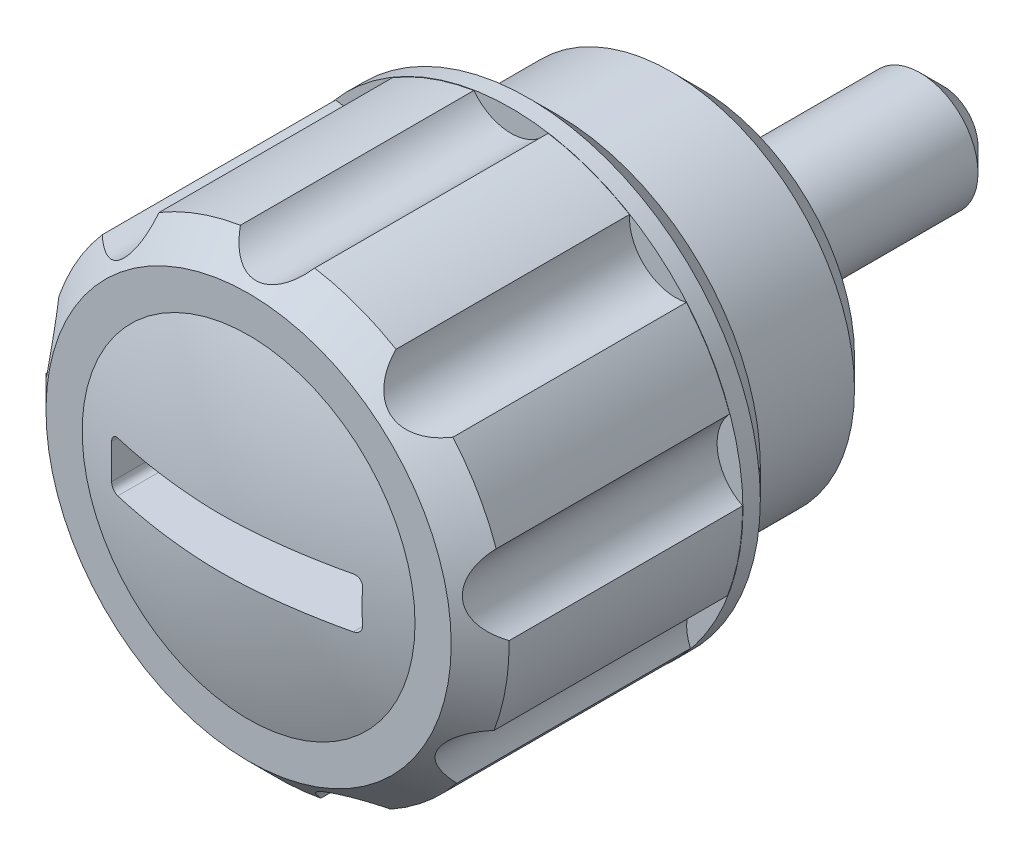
ISO-10303-21;
HEADER;
FILE_DESCRIPTION(('STEP AP214'),'2;1');
FILE_NAME('part.step','',(''),(''),'','','');
FILE_SCHEMA(('AUTOMOTIVE_DESIGN { 1 0 10303 214 1 1 1 1 }'));
ENDSEC;
DATA;
#1=APPLICATION_CONTEXT('core data for automotive mechanical design processes');
#2=APPLICATION_PROTOCOL_DEFINITION('international standard','automotive_design',2000,#1);
#3=PRODUCT_CONTEXT('',#1,'mechanical');
#4=PRODUCT('Part','Part','',(#3));
#5=PRODUCT_RELATED_PRODUCT_CATEGORY('part','',(#4));
#6=PRODUCT_DEFINITION_FORMATION('','',#4);
#7=PRODUCT_DEFINITION_CONTEXT('part definition',#1,'design');
#8=PRODUCT_DEFINITION('design','',#6,#7);
#9=PRODUCT_DEFINITION_SHAPE('','',#8);
#10=(LENGTH_UNIT() NAMED_UNIT(*) SI_UNIT(.MILLI.,.METRE.));
#11=(NAMED_UNIT(*) PLANE_ANGLE_UNIT() SI_UNIT($,.RADIAN.));
#12=(NAMED_UNIT(*) SI_UNIT($,.STERADIAN.) SOLID_ANGLE_UNIT());
#13=UNCERTAINTY_MEASURE_WITH_UNIT(LENGTH_MEASURE(1.E-05),#10,'distance_accuracy_value','');
#14=(GEOMETRIC_REPRESENTATION_CONTEXT(3) GLOBAL_UNCERTAINTY_ASSIGNED_CONTEXT((#13)) GLOBAL_UNIT_ASSIGNED_CONTEXT((#10,
#11,#12)) REPRESENTATION_CONTEXT('',''));
#15=CARTESIAN_POINT('',(0.,0.,0.));
#16=DIRECTION('',(0.,0.,1.));
#17=DIRECTION('',(1.,0.,0.));
#18=AXIS2_PLACEMENT_3D('',#15,#16,#17);
#19=CARTESIAN_POINT('',(0.,0.,-2.24502330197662));
#20=DIRECTION('',(0.,0.,1.));
#21=DIRECTION('',(1.,0.,0.));
#22=AXIS2_PLACEMENT_3D('',#19,#20,#21);
#23=DEGENERATE_TOROIDAL_SURFACE('',#22,0.386362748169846,14.9999999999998,.F.);
#24=CARTESIAN_POINT('',(0.,0.,12.));
#25=DIRECTION('',(0.,0.,1.));
#26=DIRECTION('',(1.,0.,0.));
#27=AXIS2_PLACEMENT_3D('',#24,#25,#26);
#28=CIRCLE('',#27,4.3125);
#29=CARTESIAN_POINT('',(4.3125,0.,12.));
#30=VERTEX_POINT('',#29);
#31=EDGE_CURVE('E351',#30,#30,#28,.T.);
#32=ORIENTED_EDGE('',*,*,#31,.T.);
#33=EDGE_LOOP('',(#32));
#34=FACE_BOUND('',#33,.T.);
#35=CARTESIAN_POINT('',(-3.0498,-0.649999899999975,12.3398097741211));
#36=CARTESIAN_POINT('',(-3.06120822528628,-0.650019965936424,12.3371277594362));
#37=CARTESIAN_POINT('',(-3.07262553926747,-0.649047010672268,12.3344789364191));
#38=CARTESIAN_POINT('',(-3.09516164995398,-0.645167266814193,12.3293198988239));
#39=CARTESIAN_POINT('',(-3.10628037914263,-0.642260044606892,12.326809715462));
#40=CARTESIAN_POINT('',(-3.1279071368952,-0.634560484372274,12.3219992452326));
#41=CARTESIAN_POINT('',(-3.13841459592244,-0.629766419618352,12.3196991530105));
#42=CARTESIAN_POINT('',(-3.15848770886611,-0.618413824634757,12.3153819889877));
#43=CARTESIAN_POINT('',(-3.16805381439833,-0.611856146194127,12.3133647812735));
#44=CARTESIAN_POINT('',(-3.18579781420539,-0.59727066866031,12.3097075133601));
#45=CARTESIAN_POINT('',(-3.19399634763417,-0.589269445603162,12.308061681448));
#46=CARTESIAN_POINT('',(-3.20893719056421,-0.571941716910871,12.3051577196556));
#47=CARTESIAN_POINT('',(-3.2156793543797,-0.562615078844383,12.303899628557));
#48=CARTESIAN_POINT('',(-3.22732440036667,-0.543172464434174,12.3018421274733));
#49=CARTESIAN_POINT('',(-3.23227144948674,-0.533084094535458,12.3010314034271));
#50=CARTESIAN_POINT('',(-3.24041051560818,-0.512202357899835,12.2998457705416));
#51=CARTESIAN_POINT('',(-3.24360397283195,-0.501409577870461,12.299470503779));
#52=CARTESIAN_POINT('',(-3.24725089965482,-0.483746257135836,12.2992265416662));
#53=CARTESIAN_POINT('',(-3.24828749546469,-0.476992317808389,12.2992171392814));
#54=CARTESIAN_POINT('',(-3.24966526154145,-0.4634255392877,12.2993633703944));
#55=CARTESIAN_POINT('',(-3.25000743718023,-0.456612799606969,12.2995187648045));
#56=CARTESIAN_POINT('',(-3.24999990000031,-0.449800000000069,12.2997561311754));
#57=B_SPLINE_CURVE_WITH_KNOTS('',3,(#35,#36,#37,#38,#39,#40,#41,#42,#43,#44,#45,#46,#47,#48,#49,
#50,#51,#52,#53,#54,#55,#56),.UNSPECIFIED.,.F.,.F.,(4,2,2,2,2,2,2,2,2,2,4),(0.,
0.0351172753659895,0.0702424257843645,0.10539979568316,0.140540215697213,0.175089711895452,
0.209642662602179,0.243276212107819,0.276882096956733,0.297346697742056,0.317781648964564),.UNSPECIFIED.);
#58=CARTESIAN_POINT('',(-3.05,-0.65,12.3397627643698));
#59=VERTEX_POINT('',#58);
#60=CARTESIAN_POINT('',(-3.25,-0.45,12.2997491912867));
#61=VERTEX_POINT('',#60);
#62=EDGE_CURVE('E462',#59,#61,#57,.T.);
#63=ORIENTED_EDGE('',*,*,#62,.T.);
#64=CARTESIAN_POINT('',(-3.25,0.,12.3075320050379));
#65=CARTESIAN_POINT('',(-3.25,0.277728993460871,12.3075356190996));
#66=CARTESIAN_POINT('',(-3.25,0.555440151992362,12.2986179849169));
#67=CARTESIAN_POINT('',(-3.25,1.10971337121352,12.2631914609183));
#68=CARTESIAN_POINT('',(-3.25,1.38627553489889,12.2366841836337));
#69=CARTESIAN_POINT('',(-3.25,1.93745588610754,12.1665755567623));
#70=CARTESIAN_POINT('',(-3.25,2.21207222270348,12.122959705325));
#71=CARTESIAN_POINT('',(-3.25,2.75819405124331,12.019207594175));
#72=CARTESIAN_POINT('',(-3.25,3.02969897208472,11.9590683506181));
#73=CARTESIAN_POINT('',(-3.25,3.68907942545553,11.7923343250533));
#74=CARTESIAN_POINT('',(-3.25,4.07477310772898,11.6769874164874));
#75=CARTESIAN_POINT('',(-3.25,4.83507528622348,11.4141726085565));
#76=CARTESIAN_POINT('',(-3.25,5.20968196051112,11.2666994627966));
#77=CARTESIAN_POINT('',(-3.25,5.94561682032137,10.9408021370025));
#78=CARTESIAN_POINT('',(-3.25,6.30693188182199,10.7623483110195));
#79=CARTESIAN_POINT('',(-3.25,7.013278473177,10.3760839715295));
#80=CARTESIAN_POINT('',(-3.25,7.35831779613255,10.1682877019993));
#81=CARTESIAN_POINT('',(-3.25,8.03118455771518,9.72399493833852));
#82=CARTESIAN_POINT('',(-3.25,8.35894545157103,9.48739766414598));
#83=CARTESIAN_POINT('',(-3.25,8.99368126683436,8.98778857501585));
#84=CARTESIAN_POINT('',(-3.25,9.30065586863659,8.72477635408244));
#85=CARTESIAN_POINT('',(-3.25,9.8916546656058,8.1742495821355));
#86=CARTESIAN_POINT('',(-3.25,10.1756840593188,7.88674061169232));
#87=CARTESIAN_POINT('',(-3.25,10.7189336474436,7.2891687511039));
#88=CARTESIAN_POINT('',(-3.25,10.9781537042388,6.97910573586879));
#89=CARTESIAN_POINT('',(-3.25,11.4737062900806,6.33376323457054));
#90=CARTESIAN_POINT('',(-3.25,11.7096373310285,5.9981753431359));
#91=CARTESIAN_POINT('',(-3.25,12.1524595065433,5.30835452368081));
#92=CARTESIAN_POINT('',(-3.25,12.3593503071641,4.95412138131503));
#93=CARTESIAN_POINT('',(-3.25,12.7426542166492,4.22948724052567));
#94=CARTESIAN_POINT('',(-3.25,12.9190643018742,3.85908464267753));
#95=CARTESIAN_POINT('',(-3.25,13.2401398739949,3.10476845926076));
#96=CARTESIAN_POINT('',(-3.25,13.3848053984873,2.72085488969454));
#97=CARTESIAN_POINT('',(-3.25,13.6416809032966,1.94130139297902));
#98=CARTESIAN_POINT('',(-3.25,13.753812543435,1.5456356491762));
#99=CARTESIAN_POINT('',(-3.25,13.944363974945,0.746267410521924));
#100=CARTESIAN_POINT('',(-3.25,14.0227836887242,0.342564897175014));
#101=CARTESIAN_POINT('',(-3.25,14.1453548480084,-0.469998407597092));
#102=CARTESIAN_POINT('',(-3.25,14.1895071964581,-0.8788590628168));
#103=CARTESIAN_POINT('',(-3.25,14.2432347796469,-1.69884576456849));
#104=CARTESIAN_POINT('',(-3.25,14.2528100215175,-2.10997181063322));
#105=CARTESIAN_POINT('',(-3.25,14.2373111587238,-2.93180992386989));
#106=CARTESIAN_POINT('',(-3.25,14.2122168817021,-3.34252161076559));
#107=CARTESIAN_POINT('',(-3.25,14.1275207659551,-4.16037161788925));
#108=CARTESIAN_POINT('',(-3.25,14.0679189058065,-4.56750993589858));
#109=CARTESIAN_POINT('',(-3.25,13.9146256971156,-5.37533907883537));
#110=CARTESIAN_POINT('',(-3.25,13.8209326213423,-5.77602957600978));
#111=CARTESIAN_POINT('',(-3.25,13.6001207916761,-6.568092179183));
#112=CARTESIAN_POINT('',(-3.25,13.4730020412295,-6.95946428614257));
#113=CARTESIAN_POINT('',(-3.25,13.186232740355,-7.7301217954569));
#114=CARTESIAN_POINT('',(-3.25,13.0265808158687,-8.10940668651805));
#115=CARTESIAN_POINT('',(-3.25,12.6758786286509,-8.85317181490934));
#116=CARTESIAN_POINT('',(-3.25,12.4848283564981,-9.21765204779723));
#117=CARTESIAN_POINT('',(-3.25,12.072711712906,-9.92915798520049));
#118=CARTESIAN_POINT('',(-3.25,11.8516496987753,-10.2761862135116));
#119=CARTESIAN_POINT('',(-3.25,11.3810523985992,-10.9503675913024));
#120=CARTESIAN_POINT('',(-3.25,11.1315171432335,-11.2775207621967));
#121=CARTESIAN_POINT('',(-3.25,10.6059307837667,-11.9093794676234));
#122=CARTESIAN_POINT('',(-3.25,10.3298992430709,-12.2141012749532));
#123=CARTESIAN_POINT('',(-3.25,9.75311451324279,-12.7991756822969));
#124=CARTESIAN_POINT('',(-3.25,9.45236128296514,-13.0795282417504));
#125=CARTESIAN_POINT('',(-3.25,8.82813062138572,-13.6139441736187));
#126=CARTESIAN_POINT('',(-3.25,8.50464416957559,-13.8679970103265));
#127=CARTESIAN_POINT('',(-3.25,7.8373363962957,-14.3478241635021));
#128=CARTESIAN_POINT('',(-3.25,7.49351512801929,-14.573598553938));
#129=CARTESIAN_POINT('',(-3.25,6.78879460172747,-14.9946762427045));
#130=CARTESIAN_POINT('',(-3.25,6.42793763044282,-15.1900503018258));
#131=CARTESIAN_POINT('',(-3.25,5.69092259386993,-15.5494366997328));
#132=CARTESIAN_POINT('',(-3.25,5.31476441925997,-15.7134488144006));
#133=CARTESIAN_POINT('',(-3.25,4.54996490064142,-16.0086112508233));
#134=CARTESIAN_POINT('',(-3.25,4.16132971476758,-16.1397775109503));
#135=CARTESIAN_POINT('',(-3.25,3.37414151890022,-16.367940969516));
#136=CARTESIAN_POINT('',(-3.25,2.97558824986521,-16.4649372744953));
#137=CARTESIAN_POINT('',(-3.25,2.17796770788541,-16.6218590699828));
#138=CARTESIAN_POINT('',(-3.25,1.77901685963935,-16.682368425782));
#139=CARTESIAN_POINT('',(-3.25,1.17783289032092,-16.7458571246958));
#140=CARTESIAN_POINT('',(-3.25,0.976962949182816,-16.7624743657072));
#141=CARTESIAN_POINT('',(-3.25,0.574677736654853,-16.7864370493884));
#142=CARTESIAN_POINT('',(-3.25,0.373262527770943,-16.7937835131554));
#143=CARTESIAN_POINT('',(-3.25,-0.0296307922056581,-16.7991040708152));
#144=CARTESIAN_POINT('',(-3.25,-0.231108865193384,-16.7970810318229));
#145=CARTESIAN_POINT('',(-3.25,-0.633740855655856,-16.7837024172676));
#146=CARTESIAN_POINT('',(-3.25,-0.834894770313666,-16.7723467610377));
#147=CARTESIAN_POINT('',(-3.25,-1.43727360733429,-16.7244784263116));
#148=CARTESIAN_POINT('',(-3.25,-1.83748615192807,-16.6741652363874));
#149=CARTESIAN_POINT('',(-3.25,-2.60244344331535,-16.5434913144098));
#150=CARTESIAN_POINT('',(-3.25,-2.9676242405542,-16.465624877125));
#151=CARTESIAN_POINT('',(-3.25,-3.69061293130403,-16.2811099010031));
#152=CARTESIAN_POINT('',(-3.25,-4.04842149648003,-16.1744639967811));
#153=CARTESIAN_POINT('',(-3.25,-4.75476881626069,-15.9334225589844));
#154=CARTESIAN_POINT('',(-3.25,-5.10330243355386,-15.7990119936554));
#155=CARTESIAN_POINT('',(-3.25,-5.78889033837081,-15.5035347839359));
#156=CARTESIAN_POINT('',(-3.25,-6.12594408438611,-15.3424668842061));
#157=CARTESIAN_POINT('',(-3.25,-6.80932679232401,-14.9828170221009));
#158=CARTESIAN_POINT('',(-3.25,-7.15470066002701,-14.7824174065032));
#159=CARTESIAN_POINT('',(-3.25,-7.82779768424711,-14.3538815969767));
#160=CARTESIAN_POINT('',(-3.25,-8.15552013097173,-14.1257442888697));
#161=CARTESIAN_POINT('',(-3.25,-8.79107255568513,-13.6433774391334));
#162=CARTESIAN_POINT('',(-3.25,-9.09890611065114,-13.3891526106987));
#163=CARTESIAN_POINT('',(-3.25,-9.69269581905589,-12.8563257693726));
#164=CARTESIAN_POINT('',(-3.25,-9.97865187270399,-12.5777236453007));
#165=CARTESIAN_POINT('',(-3.25,-10.5337680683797,-11.9906483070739));
#166=CARTESIAN_POINT('',(-3.25,-10.8023152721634,-11.6815951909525));
#167=CARTESIAN_POINT('',(-3.25,-11.3125257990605,-11.0420356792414));
#168=CARTESIAN_POINT('',(-3.25,-11.5541885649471,-10.7115288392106));
#169=CARTESIAN_POINT('',(-3.25,-12.0089741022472,-10.0313455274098));
#170=CARTESIAN_POINT('',(-3.25,-12.2220918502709,-9.6816656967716));
#171=CARTESIAN_POINT('',(-3.25,-12.6182423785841,-8.96566280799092));
#172=CARTESIAN_POINT('',(-3.25,-12.8012752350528,-8.59933979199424));
#173=CARTESIAN_POINT('',(-3.25,-13.1366167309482,-7.85119993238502));
#174=CARTESIAN_POINT('',(-3.25,-13.2888047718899,-7.46932902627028));
#175=CARTESIAN_POINT('',(-3.25,-13.5604975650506,-6.69413124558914));
#176=CARTESIAN_POINT('',(-3.25,-13.680002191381,-6.30080432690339));
#177=CARTESIAN_POINT('',(-3.25,-13.885478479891,-5.505506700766));
#178=CARTESIAN_POINT('',(-3.25,-13.9714517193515,-5.10353640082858));
#179=CARTESIAN_POINT('',(-3.25,-14.1092657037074,-4.29378701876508));
#180=CARTESIAN_POINT('',(-3.25,-14.1611064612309,-3.88600793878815));
#181=CARTESIAN_POINT('',(-3.25,-14.2303212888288,-3.06715435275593));
#182=CARTESIAN_POINT('',(-3.25,-14.2476633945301,-2.65607714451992));
#183=CARTESIAN_POINT('',(-3.25,-14.2476620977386,-1.83392251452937));
#184=CARTESIAN_POINT('',(-3.25,-14.2303186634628,-1.42284509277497));
#185=CARTESIAN_POINT('',(-3.25,-14.1610682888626,-0.603603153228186));
#186=CARTESIAN_POINT('',(-3.25,-14.1091606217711,-0.195438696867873));
#187=CARTESIAN_POINT('',(-3.25,-13.9711485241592,0.615067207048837));
#188=CARTESIAN_POINT('',(-3.25,-13.885044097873,1.01740865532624));
#189=CARTESIAN_POINT('',(-3.25,-13.6792331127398,1.81346557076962));
#190=CARTESIAN_POINT('',(-3.25,-13.5595217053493,2.20717978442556));
#191=CARTESIAN_POINT('',(-3.25,-13.2873494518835,2.98312116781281));
#192=CARTESIAN_POINT('',(-3.25,-13.1348885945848,3.36534833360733));
#193=CARTESIAN_POINT('',(-3.25,-12.7982999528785,4.11558729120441));
#194=CARTESIAN_POINT('',(-3.25,-12.6141727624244,4.48359934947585));
#195=CARTESIAN_POINT('',(-3.25,-12.2155528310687,5.20279306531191));
#196=CARTESIAN_POINT('',(-3.25,-12.0010601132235,5.55397473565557));
#197=CARTESIAN_POINT('',(-3.25,-11.5433180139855,6.2368658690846));
#198=CARTESIAN_POINT('',(-3.25,-11.3000801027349,6.56858302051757));
#199=CARTESIAN_POINT('',(-3.25,-10.7864981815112,7.2103264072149));
#200=CARTESIAN_POINT('',(-3.25,-10.5161541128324,7.52035259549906));
#201=CARTESIAN_POINT('',(-3.25,-9.95025306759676,8.11650757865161));
#202=CARTESIAN_POINT('',(-3.25,-9.65469453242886,8.4026348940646));
#203=CARTESIAN_POINT('',(-3.25,-9.04046877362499,8.94890264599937));
#204=CARTESIAN_POINT('',(-3.25,-8.72180175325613,9.20904331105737));
#205=CARTESIAN_POINT('',(-3.25,-8.06411837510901,9.70105813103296));
#206=CARTESIAN_POINT('',(-3.25,-7.72513441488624,9.93297559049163));
#207=CARTESIAN_POINT('',(-3.25,-7.02875492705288,10.3672880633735));
#208=CARTESIAN_POINT('',(-3.25,-6.67135962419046,10.5696834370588));
#209=CARTESIAN_POINT('',(-3.25,-5.94066060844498,10.9433896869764));
#210=CARTESIAN_POINT('',(-3.25,-5.56735649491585,11.1146997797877));
#211=CARTESIAN_POINT('',(-3.25,-4.80749189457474,11.4247686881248));
#212=CARTESIAN_POINT('',(-3.25,-4.42093314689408,11.5635317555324));
#213=CARTESIAN_POINT('',(-3.25,-3.70318039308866,11.786627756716));
#214=CARTESIAN_POINT('',(-3.25,-3.37360154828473,11.876189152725));
#215=CARTESIAN_POINT('',(-3.25,-2.70877137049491,12.0309482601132));
#216=CARTESIAN_POINT('',(-3.25,-2.37352047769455,12.0961478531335));
#217=CARTESIAN_POINT('',(-3.25,-1.69957377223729,12.2010954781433));
#218=CARTESIAN_POINT('',(-3.25,-1.36088404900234,12.2408824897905));
#219=CARTESIAN_POINT('',(-3.25,-0.681453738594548,12.2940966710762));
#220=CARTESIAN_POINT('',(-3.25,-0.340713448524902,12.3075275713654));
#221=CARTESIAN_POINT('',(-3.25,0.,12.3075320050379));
#222=B_SPLINE_CURVE_WITH_KNOTS('',3,(#64,#65,#66,#67,#68,#69,#70,#71,#72,#73,#74,#75,#76,#77,
#78,#79,#80,#81,#82,#83,#84,#85,#86,#87,#88,#89,#90,#91,#92,#93,#94,#95,#96,#97,#98,#99,#100,
#101,#102,#103,#104,#105,#106,#107,#108,#109,#110,#111,#112,#113,#114,#115,#116,#117,#118,#119,
#120,#121,#122,#123,#124,#125,#126,#127,#128,#129,#130,#131,#132,#133,#134,#135,#136,#137,#138,
#139,#140,#141,#142,#143,#144,#145,#146,#147,#148,#149,#150,#151,#152,#153,#154,#155,#156,#157,
#158,#159,#160,#161,#162,#163,#164,#165,#166,#167,#168,#169,#170,#171,#172,#173,#174,#175,#176,
#177,#178,#179,#180,#181,#182,#183,#184,#185,#186,#187,#188,#189,#190,#191,#192,#193,#194,#195,
#196,#197,#198,#199,#200,#201,#202,#203,#204,#205,#206,#207,#208,#209,#210,#211,#212,#213,#214,
#215,#216,#217,#218,#219,#220,#221),.UNSPECIFIED.,.T.,.F.,(4,2,2,2,2,2,2,2,2,2,2,2,2,2,2,2,2,2,
2,2,2,2,2,2,2,2,2,2,2,2,2,2,2,2,2,2,2,2,2,2,2,2,2,2,2,2,2,2,2,2,2,2,2,2,2,2,2,2,2,2,2,2,2,2,2,2,
2,2,2,2,2,2,2,2,2,2,2,2,4),(0.,0.833015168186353,1.66595398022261,2.49960035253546,
3.33339736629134,4.53957397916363,5.74594771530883,6.95348227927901,8.16043266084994,
9.37173482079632,10.583055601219,11.7941011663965,13.0051534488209,14.2343656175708,
15.4635919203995,16.6929400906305,17.9222868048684,19.15456962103,20.3868552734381,
21.6191084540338,22.8513613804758,24.0843315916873,25.3173025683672,26.5503360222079,
27.7833693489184,29.01645476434,30.2495405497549,31.4824474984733,32.7153531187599,
33.9473553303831,35.1793595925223,36.4118555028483,37.6443481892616,38.8739277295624,
40.1035160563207,41.3325065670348,42.5615292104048,43.7703236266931,44.3748145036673,
44.97923879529,45.583478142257,46.1877227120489,47.3960010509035,48.5150195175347,
49.6339355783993,50.7534590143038,51.8730351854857,53.0695719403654,54.2661567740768,
55.4625258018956,56.658900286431,57.8857327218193,59.1125905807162,60.3396640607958,
61.5667344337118,62.7985136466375,64.0302976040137,65.2620236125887,66.4937491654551,
67.7266154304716,68.9594828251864,70.1923761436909,71.4252693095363,72.6583404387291,
73.8914119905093,75.1244604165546,76.3575079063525,77.5900650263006,78.8226248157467,
80.05526085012,81.2878860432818,82.5185954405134,83.7492898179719,84.9800152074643,
86.2105797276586,87.2343070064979,88.2579551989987,89.2800294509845,90.3019590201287),.UNSPECIFIED.);
#223=CARTESIAN_POINT('',(-3.25,0.45,12.2997491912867));
#224=VERTEX_POINT('',#223);
#225=EDGE_CURVE('E194',#61,#224,#222,.T.);
#226=ORIENTED_EDGE('',*,*,#225,.T.);
#227=CARTESIAN_POINT('',(-3.24999989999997,0.4498,12.2997561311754));
#228=CARTESIAN_POINT('',(-3.25002147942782,0.460776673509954,12.2993714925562));
#229=CARTESIAN_POINT('',(-3.24911882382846,0.471758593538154,12.2992032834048));
#230=CARTESIAN_POINT('',(-3.24553635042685,0.493412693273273,12.2992941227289));
#231=CARTESIAN_POINT('',(-3.24285883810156,0.504085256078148,12.299552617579));
#232=CARTESIAN_POINT('',(-3.23579622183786,0.524834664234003,12.3004904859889));
#233=CARTESIAN_POINT('',(-3.23141042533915,0.53491126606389,12.3011700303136));
#234=CARTESIAN_POINT('',(-3.22107038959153,0.554184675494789,12.3029273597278));
#235=CARTESIAN_POINT('',(-3.21511623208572,0.563381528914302,12.3040051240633));
#236=CARTESIAN_POINT('',(-3.20177417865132,0.580709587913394,12.3065339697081));
#237=CARTESIAN_POINT('',(-3.19437690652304,0.588833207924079,12.3079875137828));
#238=CARTESIAN_POINT('',(-3.17839327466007,0.603735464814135,12.3112205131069));
#239=CARTESIAN_POINT('',(-3.16980667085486,0.610513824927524,12.3130000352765));
#240=CARTESIAN_POINT('',(-3.15148706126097,0.62269653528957,12.3168763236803));
#241=CARTESIAN_POINT('',(-3.14173272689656,0.628066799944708,12.3189792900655));
#242=CARTESIAN_POINT('',(-3.12151319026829,0.637105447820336,12.3234120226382));
#243=CARTESIAN_POINT('',(-3.11104805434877,0.640773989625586,12.3257417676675));
#244=CARTESIAN_POINT('',(-3.09210451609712,0.64570458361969,12.3300193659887));
#245=CARTESIAN_POINT('',(-3.08370936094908,0.647322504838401,12.3319350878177));
#246=CARTESIAN_POINT('',(-3.06680849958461,0.649474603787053,12.3358309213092));
#247=CARTESIAN_POINT('',(-3.05830296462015,0.650010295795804,12.3378109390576));
#248=CARTESIAN_POINT('',(-3.0498,0.649999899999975,12.3398097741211));
#249=B_SPLINE_CURVE_WITH_KNOTS('',3,(#227,#228,#229,#230,#231,#232,#233,#234,#235,#236,#237,
#238,#239,#240,#241,#242,#243,#244,#245,#246,#247,#248),.UNSPECIFIED.,.F.,.F.,(4,2,2,2,2,2,2,2,
2,2,4),(0.,0.0329053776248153,0.0657680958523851,0.0986441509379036,0.13151849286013,
0.1646140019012,0.197716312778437,0.231558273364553,0.265397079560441,0.291616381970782,
0.31779897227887),.UNSPECIFIED.);
#250=CARTESIAN_POINT('',(-3.04999999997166,0.65,12.3397627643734));
#251=VERTEX_POINT('',#250);
#252=EDGE_CURVE('E416',#224,#251,#249,.T.);
#253=ORIENTED_EDGE('',*,*,#252,.T.);
#254=CARTESIAN_POINT('',(0.,0.65,12.7191322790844));
#255=CARTESIAN_POINT('',(0.108520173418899,0.65,12.7191277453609));
#256=CARTESIAN_POINT('',(0.217041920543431,0.65,12.7172094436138));
#257=CARTESIAN_POINT('',(0.433997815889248,0.65,12.7099981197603));
#258=CARTESIAN_POINT('',(0.542431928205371,0.65,12.7047040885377));
#259=CARTESIAN_POINT('',(0.759555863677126,0.65,12.6912706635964));
#260=CARTESIAN_POINT('',(0.868244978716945,0.65,12.6831199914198));
#261=CARTESIAN_POINT('',(1.08539837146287,0.65,12.6642185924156));
#262=CARTESIAN_POINT('',(1.19386263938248,0.65,12.6534677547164));
#263=CARTESIAN_POINT('',(1.51887735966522,0.65,12.6174925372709));
#264=CARTESIAN_POINT('',(1.73502604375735,0.65,12.5885469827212));
#265=CARTESIAN_POINT('',(2.16611297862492,0.65,12.5210525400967));
#266=CARTESIAN_POINT('',(2.38104917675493,0.65,12.4824906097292));
#267=CARTESIAN_POINT('',(2.80901885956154,0.65,12.3959374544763));
#268=CARTESIAN_POINT('',(3.02205219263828,0.65,12.3479454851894));
#269=CARTESIAN_POINT('',(3.64169701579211,0.65,12.1939819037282));
#270=CARTESIAN_POINT('',(4.04525595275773,0.65,12.0754170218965));
#271=CARTESIAN_POINT('',(4.84106887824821,0.65,11.804706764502));
#272=CARTESIAN_POINT('',(5.23331827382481,0.65,11.6525479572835));
#273=CARTESIAN_POINT('',(6.00390173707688,0.65,11.3156534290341));
#274=CARTESIAN_POINT('',(6.382226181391,0.65,11.1308956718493));
#275=CARTESIAN_POINT('',(7.12194189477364,0.65,10.7302214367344));
#276=CARTESIAN_POINT('',(7.48333496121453,0.65,10.5143082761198));
#277=CARTESIAN_POINT('',(8.18679974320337,0.65,10.0527629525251));
#278=CARTESIAN_POINT('',(8.52886465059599,0.65,9.80712041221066));
#279=CARTESIAN_POINT('',(9.19111928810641,0.65,9.28791513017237));
#280=CARTESIAN_POINT('',(9.51130841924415,0.65,9.01435162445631));
#281=CARTESIAN_POINT('',(10.1275007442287,0.65,8.44128082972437));
#282=CARTESIAN_POINT('',(10.4235063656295,0.65,8.14177615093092));
#283=CARTESIAN_POINT('',(10.9892674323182,0.65,7.51892636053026));
#284=CARTESIAN_POINT('',(11.2590230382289,0.65,7.19558139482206));
#285=CARTESIAN_POINT('',(11.7706885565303,0.65,6.52693164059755));
#286=CARTESIAN_POINT('',(12.012563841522,0.65,6.18160035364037));
#287=CARTESIAN_POINT('',(12.4663665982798,0.65,5.47179015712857));
#288=CARTESIAN_POINT('',(12.6782939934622,0.65,5.10731119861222));
#289=CARTESIAN_POINT('',(13.0706918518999,0.65,4.36180202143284));
#290=CARTESIAN_POINT('',(13.2511627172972,0.65,3.98077201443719));
#291=CARTESIAN_POINT('',(13.5793682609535,0.65,3.20486500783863));
#292=CARTESIAN_POINT('',(13.7271029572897,0.65,2.80998801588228));
#293=CARTESIAN_POINT('',(13.988800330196,0.65,2.00915107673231));
#294=CARTESIAN_POINT('',(14.1027594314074,0.65,1.60318996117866));
#295=CARTESIAN_POINT('',(14.2960746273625,0.65,0.783110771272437));
#296=CARTESIAN_POINT('',(14.3754307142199,0.65,0.368992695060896));
#297=CARTESIAN_POINT('',(14.498977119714,0.65,-0.464465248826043));
#298=CARTESIAN_POINT('',(14.5431666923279,0.65,-0.883805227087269));
#299=CARTESIAN_POINT('',(14.596063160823,0.65,-1.72471716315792));
#300=CARTESIAN_POINT('',(14.6047700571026,0.65,-2.1462891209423));
#301=CARTESIAN_POINT('',(14.5866390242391,0.65,-2.98868011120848));
#302=CARTESIAN_POINT('',(14.5598000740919,0.65,-3.40949912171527));
#303=CARTESIAN_POINT('',(14.4707663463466,0.65,-4.24738022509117));
#304=CARTESIAN_POINT('',(14.4085715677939,0.65,-4.66444231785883));
#305=CARTESIAN_POINT('',(14.2492707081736,0.65,-5.49183187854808));
#306=CARTESIAN_POINT('',(14.1521656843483,0.65,-5.90215955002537));
#307=CARTESIAN_POINT('',(13.92373427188,0.65,-6.7131760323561));
#308=CARTESIAN_POINT('',(13.7924078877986,0.65,-7.11386484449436));
#309=CARTESIAN_POINT('',(13.4964692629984,0.65,-7.90274953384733));
#310=CARTESIAN_POINT('',(13.3318574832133,0.65,-8.29094558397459));
#311=CARTESIAN_POINT('',(12.9705168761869,0.65,-9.05209088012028));
#312=CARTESIAN_POINT('',(12.7737880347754,0.65,-9.42504011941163));
#313=CARTESIAN_POINT('',(12.3495993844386,0.65,-10.1530610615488));
#314=CARTESIAN_POINT('',(12.1221378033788,0.65,-10.5081317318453));
#315=CARTESIAN_POINT('',(11.6381096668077,0.65,-11.1978469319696));
#316=CARTESIAN_POINT('',(11.3815431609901,0.65,-11.5324914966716));
#317=CARTESIAN_POINT('',(10.8411381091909,0.65,-12.1789638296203));
#318=CARTESIAN_POINT('',(10.5573005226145,0.65,-12.4907923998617));
#319=CARTESIAN_POINT('',(9.9643609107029,0.65,-13.0894299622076));
#320=CARTESIAN_POINT('',(9.65525870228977,0.65,-13.3762387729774));
#321=CARTESIAN_POINT('',(9.01399860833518,0.65,-13.9227850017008));
#322=CARTESIAN_POINT('',(8.681841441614,0.65,-14.1825232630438));
#323=CARTESIAN_POINT('',(7.99683299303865,0.65,-14.6730822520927));
#324=CARTESIAN_POINT('',(7.64398231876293,0.65,-14.9039038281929));
#325=CARTESIAN_POINT('',(6.92002553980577,0.65,-15.335028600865));
#326=CARTESIAN_POINT('',(6.5489163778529,0.65,-15.5353266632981));
#327=CARTESIAN_POINT('',(5.79113277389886,0.65,-15.903924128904));
#328=CARTESIAN_POINT('',(5.40445847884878,0.65,-16.0722238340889));
#329=CARTESIAN_POINT('',(4.61839618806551,0.65,-16.3755712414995));
#330=CARTESIAN_POINT('',(4.21901109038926,0.65,-16.5106264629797));
#331=CARTESIAN_POINT('',(3.41037855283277,0.65,-16.7464936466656));
#332=CARTESIAN_POINT('',(3.00113546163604,0.65,-16.8473204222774));
#333=CARTESIAN_POINT('',(2.37474825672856,0.65,-16.9737106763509));
#334=CARTESIAN_POINT('',(2.16011736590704,0.65,-17.0121235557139));
#335=CARTESIAN_POINT('',(1.72933145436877,0.65,-17.0793970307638));
#336=CARTESIAN_POINT('',(1.51317639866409,0.65,-17.1082574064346));
#337=CARTESIAN_POINT('',(1.1883245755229,0.65,-17.1440821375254));
#338=CARTESIAN_POINT('',(1.08002619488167,0.65,-17.1547737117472));
#339=CARTESIAN_POINT('',(0.863198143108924,0.65,-17.1735629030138));
#340=CARTESIAN_POINT('',(0.754668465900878,0.65,-17.1816604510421));
#341=CARTESIAN_POINT('',(0.537464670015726,0.65,-17.1950151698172));
#342=CARTESIAN_POINT('',(0.42879060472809,0.65,-17.2002731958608));
#343=CARTESIAN_POINT('',(0.211334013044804,0.65,-17.20738850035));
#344=CARTESIAN_POINT('',(0.102551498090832,0.65,-17.2092461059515));
#345=CARTESIAN_POINT('',(-0.098037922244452,0.65,-17.2091183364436));
#346=CARTESIAN_POINT('',(-0.189845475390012,0.65,-17.2076873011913));
#347=CARTESIAN_POINT('',(-0.373392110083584,0.65,-17.2023544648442));
#348=CARTESIAN_POINT('',(-0.465131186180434,0.65,-17.1984524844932));
#349=CARTESIAN_POINT('',(-0.648525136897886,0.65,-17.1885366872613));
#350=CARTESIAN_POINT('',(-0.740179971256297,0.65,-17.1825221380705));
#351=CARTESIAN_POINT('',(-0.923340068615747,0.65,-17.1685825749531));
#352=CARTESIAN_POINT('',(-1.01484533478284,0.65,-17.1606576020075));
#353=CARTESIAN_POINT('',(-1.28932831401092,0.65,-17.1341570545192));
#354=CARTESIAN_POINT('',(-1.47205047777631,0.65,-17.1128685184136));
#355=CARTESIAN_POINT('',(-1.83651738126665,0.65,-17.0634122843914));
#356=CARTESIAN_POINT('',(-2.01826229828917,0.65,-17.0352458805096));
#357=CARTESIAN_POINT('',(-2.38129600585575,0.65,-16.9720306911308));
#358=CARTESIAN_POINT('',(-2.56258014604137,0.65,-16.936955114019));
#359=CARTESIAN_POINT('',(-2.92371751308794,0.65,-16.8600846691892));
#360=CARTESIAN_POINT('',(-3.10357066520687,0.65,-16.8182894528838));
#361=CARTESIAN_POINT('',(-3.64033450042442,0.65,-16.6830040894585));
#362=CARTESIAN_POINT('',(-3.9947892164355,0.65,-16.57955495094));
#363=CARTESIAN_POINT('',(-4.71178689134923,0.65,-16.3411791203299));
#364=CARTESIAN_POINT('',(-5.07390702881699,0.65,-16.2049845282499));
#365=CARTESIAN_POINT('',(-5.78663052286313,0.65,-15.9049349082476));
#366=CARTESIAN_POINT('',(-6.13723052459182,0.65,-15.7410719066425));
#367=CARTESIAN_POINT('',(-6.82400082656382,0.65,-15.3870663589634));
#368=CARTESIAN_POINT('',(-7.16019896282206,0.65,-15.1969778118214));
#369=CARTESIAN_POINT('',(-7.81689468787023,0.65,-14.7914249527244));
#370=CARTESIAN_POINT('',(-8.13739298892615,0.65,-14.5759617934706));
#371=CARTESIAN_POINT('',(-8.7889588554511,0.65,-14.1003791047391));
#372=CARTESIAN_POINT('',(-9.118369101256,0.65,-13.8379842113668));
#373=CARTESIAN_POINT('',(-9.75396306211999,0.65,-13.2863857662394));
#374=CARTESIAN_POINT('',(-10.0601446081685,0.65,-12.9971797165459));
#375=CARTESIAN_POINT('',(-10.6473742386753,0.65,-12.3937305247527));
#376=CARTESIAN_POINT('',(-10.9283974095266,0.65,-12.0794631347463));
#377=CARTESIAN_POINT('',(-11.4629667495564,0.65,-11.4283824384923));
#378=CARTESIAN_POINT('',(-11.716513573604,0.65,-11.0915696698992));
#379=CARTESIAN_POINT('',(-12.1943966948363,0.65,-10.3976989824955));
#380=CARTESIAN_POINT('',(-12.4187257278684,0.65,-10.0406360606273));
#381=CARTESIAN_POINT('',(-12.836505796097,0.65,-9.30887820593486));
#382=CARTESIAN_POINT('',(-13.0299566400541,0.65,-8.93418316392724));
#383=CARTESIAN_POINT('',(-13.3845512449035,0.65,-8.1699401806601));
#384=CARTESIAN_POINT('',(-13.5457045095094,0.65,-7.78039664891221));
#385=CARTESIAN_POINT('',(-13.8346300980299,0.65,-6.98912166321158));
#386=CARTESIAN_POINT('',(-13.9624024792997,0.65,-6.58739023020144));
#387=CARTESIAN_POINT('',(-14.1836800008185,0.65,-5.77451590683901));
#388=CARTESIAN_POINT('',(-14.2771785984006,0.65,-5.36337123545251));
#389=CARTESIAN_POINT('',(-14.4292098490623,0.65,-4.53466691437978));
#390=CARTESIAN_POINT('',(-14.487742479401,0.65,-4.11710726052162));
#391=CARTESIAN_POINT('',(-14.5694291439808,0.65,-3.27850601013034));
#392=CARTESIAN_POINT('',(-14.5925801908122,0.65,-2.85746412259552));
#393=CARTESIAN_POINT('',(-14.6033296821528,0.65,-2.01492679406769));
#394=CARTESIAN_POINT('',(-14.5909281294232,0.65,-1.59343135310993));
#395=CARTESIAN_POINT('',(-14.5306606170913,0.65,-0.752983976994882));
#396=CARTESIAN_POINT('',(-14.4827946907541,0.65,-0.334032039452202));
#397=CARTESIAN_POINT('',(-14.351938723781,0.65,0.49835010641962));
#398=CARTESIAN_POINT('',(-14.2689486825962,0.65,0.911780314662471));
#399=CARTESIAN_POINT('',(-14.0684388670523,0.65,1.73016147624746));
#400=CARTESIAN_POINT('',(-13.9509206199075,0.65,2.13511280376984));
#401=CARTESIAN_POINT('',(-13.6821883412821,0.65,2.93367609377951));
#402=CARTESIAN_POINT('',(-13.5309743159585,0.65,3.32728805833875));
#403=CARTESIAN_POINT('',(-13.1959267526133,0.65,4.10037092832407));
#404=CARTESIAN_POINT('',(-13.0120935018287,0.65,4.47984195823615));
#405=CARTESIAN_POINT('',(-12.6131130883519,0.65,5.22194896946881));
#406=CARTESIAN_POINT('',(-12.3979659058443,0.65,5.58458494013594));
#407=CARTESIAN_POINT('',(-11.9378740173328,0.65,6.29046298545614));
#408=CARTESIAN_POINT('',(-11.6929276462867,0.65,6.63370397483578));
#409=CARTESIAN_POINT('',(-11.1749886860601,0.65,7.29832838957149));
#410=CARTESIAN_POINT('',(-10.9019961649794,0.65,7.61971186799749));
#411=CARTESIAN_POINT('',(-10.3299256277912,0.65,8.23831388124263));
#412=CARTESIAN_POINT('',(-10.0308495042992,0.65,8.53553416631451));
#413=CARTESIAN_POINT('',(-9.40871715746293,0.65,9.10372430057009));
#414=CARTESIAN_POINT('',(-9.08566069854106,0.65,9.37469389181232));
#415=CARTESIAN_POINT('',(-8.41785441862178,0.65,9.88845978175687));
#416=CARTESIAN_POINT('',(-8.07310383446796,0.65,10.1312550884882));
#417=CARTESIAN_POINT('',(-7.36438263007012,0.65,10.5869228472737));
#418=CARTESIAN_POINT('',(-7.00041275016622,0.65,10.799796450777));
#419=CARTESIAN_POINT('',(-6.25574024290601,0.65,11.1941576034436));
#420=CARTESIAN_POINT('',(-5.87503367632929,0.65,11.3756377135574));
#421=CARTESIAN_POINT('',(-5.09960838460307,0.65,11.7058730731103));
#422=CARTESIAN_POINT('',(-4.70488757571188,0.65,11.8546234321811));
#423=CARTESIAN_POINT('',(-3.90465475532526,0.65,12.118151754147));
#424=CARTESIAN_POINT('',(-3.49915214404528,0.65,12.2329583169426));
#425=CARTESIAN_POINT('',(-2.67985286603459,0.65,12.4278850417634));
#426=CARTESIAN_POINT('',(-2.26605705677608,0.65,12.5080087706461));
#427=CARTESIAN_POINT('',(-1.69646981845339,0.65,12.5931341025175));
#428=CARTESIAN_POINT('',(-1.54287539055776,0.65,12.6136119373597));
#429=CARTESIAN_POINT('',(-1.23513895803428,0.65,12.6495835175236));
#430=CARTESIAN_POINT('',(-1.08099712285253,0.65,12.6650786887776));
#431=CARTESIAN_POINT('',(-0.772511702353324,0.65,12.6907884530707));
#432=CARTESIAN_POINT('',(-0.618168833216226,0.65,12.7010114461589));
#433=CARTESIAN_POINT('',(-0.386454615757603,0.65,12.7116612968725));
#434=CARTESIAN_POINT('',(-0.309189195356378,0.65,12.7144304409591));
#435=CARTESIAN_POINT('',(-0.154616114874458,0.65,12.7181675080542));
#436=CARTESIAN_POINT('',(-0.0773084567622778,0.65,12.7191355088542));
#437=CARTESIAN_POINT('',(0.,0.65,12.7191322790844));
#438=B_SPLINE_CURVE_WITH_KNOTS('',3,(#254,#255,#256,#257,#258,#259,#260,#261,#262,#263,#264,
#265,#266,#267,#268,#269,#270,#271,#272,#273,#274,#275,#276,#277,#278,#279,#280,#281,#282,#283,
#284,#285,#286,#287,#288,#289,#290,#291,#292,#293,#294,#295,#296,#297,#298,#299,#300,#301,#302,
#303,#304,#305,#306,#307,#308,#309,#310,#311,#312,#313,#314,#315,#316,#317,#318,#319,#320,#321,
#322,#323,#324,#325,#326,#327,#328,#329,#330,#331,#332,#333,#334,#335,#336,#337,#338,#339,#340,
#341,#342,#343,#344,#345,#346,#347,#348,#349,#350,#351,#352,#353,#354,#355,#356,#357,#358,#359,
#360,#361,#362,#363,#364,#365,#366,#367,#368,#369,#370,#371,#372,#373,#374,#375,#376,#377,#378,
#379,#380,#381,#382,#383,#384,#385,#386,#387,#388,#389,#390,#391,#392,#393,#394,#395,#396,#397,
#398,#399,#400,#401,#402,#403,#404,#405,#406,#407,#408,#409,#410,#411,#412,#413,#414,#415,#416,
#417,#418,#419,#420,#421,#422,#423,#424,#425,#426,#427,#428,#429,#430,#431,#432,#433,#434,#435,
#436,#437),.UNSPECIFIED.,.T.,.F.,(4,2,2,2,2,2,2,2,2,2,2,2,2,2,2,2,2,2,2,2,2,2,2,2,2,2,2,2,2,2,2,
2,2,2,2,2,2,2,2,2,2,2,2,2,2,2,2,2,2,2,2,2,2,2,2,2,2,2,2,2,2,2,2,2,2,2,2,2,2,2,2,2,2,2,2,2,2,2,2,
2,2,2,2,2,2,2,2,2,2,2,2,4),(0.,0.325550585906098,0.651198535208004,0.978146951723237,
1.30510931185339,1.95910516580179,2.61399287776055,3.26893230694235,4.52915364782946,
5.78987977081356,7.05146140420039,8.31290880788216,9.57479780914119,10.8367213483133,
12.0985180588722,13.3603070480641,14.6236466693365,15.8869895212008,17.1503162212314,
18.4136422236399,19.6771019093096,20.9405618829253,22.2040486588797,23.4675354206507,
24.7310584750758,25.9945815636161,27.2580663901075,28.5215510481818,29.7850182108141,
31.048485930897,32.3120265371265,33.5755649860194,34.8390589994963,36.1025621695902,
37.366025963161,38.6294526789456,39.8930916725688,41.1567187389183,42.4200597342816,
43.6828532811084,44.3368060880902,44.9907739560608,45.3172246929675,45.64368411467,
45.9700451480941,46.296374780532,46.5717928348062,46.8472308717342,47.1227644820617,
47.3982921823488,47.9500163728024,48.5016368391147,49.0554399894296,49.6092718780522,
50.7159038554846,51.8754142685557,53.0352594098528,54.1927510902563,55.3501902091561,
56.6121057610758,57.8741390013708,59.1374084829,60.4006478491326,61.6642006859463,
62.9277613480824,64.1909496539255,65.4541357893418,66.7175629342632,67.9809909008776,
69.2445255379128,70.5080600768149,71.7715934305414,73.0351268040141,74.2986042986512,
75.5620815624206,76.8255477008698,78.0890146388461,79.3525522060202,80.6160867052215,
81.8795295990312,83.1429849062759,84.4064846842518,85.6699358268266,86.9336859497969,
88.1976247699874,89.4604955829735,90.7232364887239,91.1880404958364,91.6527113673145,
92.1166395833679,92.3485678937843,92.5804861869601),.UNSPECIFIED.);
#439=CARTESIAN_POINT('',(3.05,0.65,12.3397627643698));
#440=VERTEX_POINT('',#439);
#441=EDGE_CURVE('E427',#251,#440,#438,.T.);
#442=ORIENTED_EDGE('',*,*,#441,.T.);
#443=CARTESIAN_POINT('',(3.0498,0.649999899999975,12.3398097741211));
#444=CARTESIAN_POINT('',(3.06120822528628,0.650019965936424,12.3371277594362));
#445=CARTESIAN_POINT('',(3.07262553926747,0.649047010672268,12.3344789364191));
#446=CARTESIAN_POINT('',(3.09516164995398,0.645167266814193,12.3293198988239));
#447=CARTESIAN_POINT('',(3.10628037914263,0.642260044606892,12.326809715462));
#448=CARTESIAN_POINT('',(3.1279071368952,0.634560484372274,12.3219992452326));
#449=CARTESIAN_POINT('',(3.13841459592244,0.629766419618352,12.3196991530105));
#450=CARTESIAN_POINT('',(3.15848770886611,0.618413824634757,12.3153819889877));
#451=CARTESIAN_POINT('',(3.16805381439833,0.611856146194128,12.3133647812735));
#452=CARTESIAN_POINT('',(3.18579781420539,0.597270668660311,12.3097075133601));
#453=CARTESIAN_POINT('',(3.19399634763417,0.589269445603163,12.308061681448));
#454=CARTESIAN_POINT('',(3.20893719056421,0.571941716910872,12.3051577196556));
#455=CARTESIAN_POINT('',(3.2156793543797,0.562615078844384,12.303899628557));
#456=CARTESIAN_POINT('',(3.22732440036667,0.543172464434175,12.3018421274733));
#457=CARTESIAN_POINT('',(3.23227144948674,0.533084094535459,12.3010314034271));
#458=CARTESIAN_POINT('',(3.24041051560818,0.512202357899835,12.2998457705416));
#459=CARTESIAN_POINT('',(3.24360397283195,0.501409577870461,12.299470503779));
#460=CARTESIAN_POINT('',(3.24725089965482,0.483746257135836,12.2992265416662));
#461=CARTESIAN_POINT('',(3.24828749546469,0.476992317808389,12.2992171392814));
#462=CARTESIAN_POINT('',(3.24966526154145,0.4634255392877,12.2993633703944));
#463=CARTESIAN_POINT('',(3.25000743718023,0.456612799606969,12.2995187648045));
#464=CARTESIAN_POINT('',(3.24999990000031,0.449800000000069,12.2997561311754));
#465=B_SPLINE_CURVE_WITH_KNOTS('',3,(#443,#444,#445,#446,#447,#448,#449,#450,#451,#452,#453,
#454,#455,#456,#457,#458,#459,#460,#461,#462,#463,#464),.UNSPECIFIED.,.F.,.F.,(4,2,2,2,2,2,2,2,
2,2,4),(0.,0.0351172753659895,0.0702424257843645,0.105399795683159,0.140540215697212,
0.175089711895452,0.209642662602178,0.243276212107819,0.276882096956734,0.297346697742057,
0.317781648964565),.UNSPECIFIED.);
#466=CARTESIAN_POINT('',(3.25,0.45,12.2997491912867));
#467=VERTEX_POINT('',#466);
#468=EDGE_CURVE('E434',#440,#467,#465,.T.);
#469=ORIENTED_EDGE('',*,*,#468,.T.);
#470=CARTESIAN_POINT('',(3.25,0.,12.3075320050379));
#471=CARTESIAN_POINT('',(3.25,-0.277728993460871,12.3075356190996));
#472=CARTESIAN_POINT('',(3.25,-0.555440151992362,12.2986179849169));
#473=CARTESIAN_POINT('',(3.25,-1.10971337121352,12.2631914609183));
#474=CARTESIAN_POINT('',(3.25,-1.38627553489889,12.2366841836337));
#475=CARTESIAN_POINT('',(3.25,-1.93745588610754,12.1665755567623));
#476=CARTESIAN_POINT('',(3.25,-2.21207222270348,12.122959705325));
#477=CARTESIAN_POINT('',(3.25,-2.75819405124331,12.019207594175));
#478=CARTESIAN_POINT('',(3.25,-3.02969897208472,11.9590683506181));
#479=CARTESIAN_POINT('',(3.25,-3.68907942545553,11.7923343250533));
#480=CARTESIAN_POINT('',(3.25,-4.07477310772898,11.6769874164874));
#481=CARTESIAN_POINT('',(3.25,-4.83507528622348,11.4141726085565));
#482=CARTESIAN_POINT('',(3.25,-5.20968196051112,11.2666994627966));
#483=CARTESIAN_POINT('',(3.25,-5.94561682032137,10.9408021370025));
#484=CARTESIAN_POINT('',(3.25,-6.30693188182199,10.7623483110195));
#485=CARTESIAN_POINT('',(3.25,-7.013278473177,10.3760839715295));
#486=CARTESIAN_POINT('',(3.25,-7.35831779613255,10.1682877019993));
#487=CARTESIAN_POINT('',(3.25,-8.03118455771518,9.72399493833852));
#488=CARTESIAN_POINT('',(3.25,-8.35894545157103,9.48739766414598));
#489=CARTESIAN_POINT('',(3.25,-8.99368126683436,8.98778857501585));
#490=CARTESIAN_POINT('',(3.25,-9.30065586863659,8.72477635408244));
#491=CARTESIAN_POINT('',(3.25,-9.8916546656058,8.1742495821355));
#492=CARTESIAN_POINT('',(3.25,-10.1756840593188,7.88674061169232));
#493=CARTESIAN_POINT('',(3.25,-10.7189336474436,7.2891687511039));
#494=CARTESIAN_POINT('',(3.25,-10.9781537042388,6.97910573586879));
#495=CARTESIAN_POINT('',(3.25,-11.4737062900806,6.33376323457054));
#496=CARTESIAN_POINT('',(3.25,-11.7096373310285,5.9981753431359));
#497=CARTESIAN_POINT('',(3.25,-12.1524595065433,5.30835452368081));
#498=CARTESIAN_POINT('',(3.25,-12.3593503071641,4.95412138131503));
#499=CARTESIAN_POINT('',(3.25,-12.7426542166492,4.22948724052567));
#500=CARTESIAN_POINT('',(3.25,-12.9190643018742,3.85908464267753));
#501=CARTESIAN_POINT('',(3.25,-13.2401398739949,3.10476845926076));
#502=CARTESIAN_POINT('',(3.25,-13.3848053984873,2.72085488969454));
#503=CARTESIAN_POINT('',(3.25,-13.6416809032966,1.94130139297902));
#504=CARTESIAN_POINT('',(3.25,-13.753812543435,1.5456356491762));
#505=CARTESIAN_POINT('',(3.25,-13.944363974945,0.746267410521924));
#506=CARTESIAN_POINT('',(3.25,-14.0227836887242,0.342564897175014));
#507=CARTESIAN_POINT('',(3.25,-14.1453548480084,-0.469998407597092));
#508=CARTESIAN_POINT('',(3.25,-14.1895071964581,-0.8788590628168));
#509=CARTESIAN_POINT('',(3.25,-14.2432347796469,-1.69884576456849));
#510=CARTESIAN_POINT('',(3.25,-14.2528100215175,-2.10997181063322));
#511=CARTESIAN_POINT('',(3.25,-14.2373111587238,-2.93180992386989));
#512=CARTESIAN_POINT('',(3.25,-14.2122168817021,-3.34252161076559));
#513=CARTESIAN_POINT('',(3.25,-14.1275207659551,-4.16037161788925));
#514=CARTESIAN_POINT('',(3.25,-14.0679189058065,-4.56750993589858));
#515=CARTESIAN_POINT('',(3.25,-13.9146256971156,-5.37533907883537));
#516=CARTESIAN_POINT('',(3.25,-13.8209326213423,-5.77602957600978));
#517=CARTESIAN_POINT('',(3.25,-13.6001207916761,-6.568092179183));
#518=CARTESIAN_POINT('',(3.25,-13.4730020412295,-6.95946428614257));
#519=CARTESIAN_POINT('',(3.25,-13.186232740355,-7.7301217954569));
#520=CARTESIAN_POINT('',(3.25,-13.0265808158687,-8.10940668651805));
#521=CARTESIAN_POINT('',(3.25,-12.6758786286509,-8.85317181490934));
#522=CARTESIAN_POINT('',(3.25,-12.4848283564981,-9.21765204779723));
#523=CARTESIAN_POINT('',(3.25,-12.072711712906,-9.92915798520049));
#524=CARTESIAN_POINT('',(3.25,-11.8516496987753,-10.2761862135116));
#525=CARTESIAN_POINT('',(3.25,-11.3810523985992,-10.9503675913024));
#526=CARTESIAN_POINT('',(3.25,-11.1315171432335,-11.2775207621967));
#527=CARTESIAN_POINT('',(3.25,-10.6059307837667,-11.9093794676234));
#528=CARTESIAN_POINT('',(3.25,-10.3298992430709,-12.2141012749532));
#529=CARTESIAN_POINT('',(3.25,-9.75311451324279,-12.7991756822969));
#530=CARTESIAN_POINT('',(3.25,-9.45236128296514,-13.0795282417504));
#531=CARTESIAN_POINT('',(3.25,-8.82813062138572,-13.6139441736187));
#532=CARTESIAN_POINT('',(3.25,-8.50464416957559,-13.8679970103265));
#533=CARTESIAN_POINT('',(3.25,-7.8373363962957,-14.3478241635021));
#534=CARTESIAN_POINT('',(3.25,-7.49351512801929,-14.573598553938));
#535=CARTESIAN_POINT('',(3.25,-6.78879460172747,-14.9946762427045));
#536=CARTESIAN_POINT('',(3.25,-6.42793763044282,-15.1900503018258));
#537=CARTESIAN_POINT('',(3.25,-5.69092259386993,-15.5494366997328));
#538=CARTESIAN_POINT('',(3.25,-5.31476441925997,-15.7134488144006));
#539=CARTESIAN_POINT('',(3.25,-4.54996490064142,-16.0086112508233));
#540=CARTESIAN_POINT('',(3.25,-4.16132971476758,-16.1397775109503));
#541=CARTESIAN_POINT('',(3.25,-3.37414151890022,-16.367940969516));
#542=CARTESIAN_POINT('',(3.25,-2.97558824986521,-16.4649372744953));
#543=CARTESIAN_POINT('',(3.25,-2.17796770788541,-16.6218590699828));
#544=CARTESIAN_POINT('',(3.25,-1.77901685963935,-16.682368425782));
#545=CARTESIAN_POINT('',(3.25,-1.17783289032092,-16.7458571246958));
#546=CARTESIAN_POINT('',(3.25,-0.976962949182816,-16.7624743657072));
#547=CARTESIAN_POINT('',(3.25,-0.574677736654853,-16.7864370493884));
#548=CARTESIAN_POINT('',(3.25,-0.373262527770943,-16.7937835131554));
#549=CARTESIAN_POINT('',(3.25,0.0296307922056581,-16.7991040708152));
#550=CARTESIAN_POINT('',(3.25,0.231108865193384,-16.7970810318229));
#551=CARTESIAN_POINT('',(3.25,0.633740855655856,-16.7837024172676));
#552=CARTESIAN_POINT('',(3.25,0.834894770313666,-16.7723467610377));
#553=CARTESIAN_POINT('',(3.25,1.43727360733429,-16.7244784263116));
#554=CARTESIAN_POINT('',(3.25,1.83748615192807,-16.6741652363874));
#555=CARTESIAN_POINT('',(3.25,2.60244344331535,-16.5434913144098));
#556=CARTESIAN_POINT('',(3.25,2.9676242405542,-16.465624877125));
#557=CARTESIAN_POINT('',(3.25,3.69061293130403,-16.2811099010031));
#558=CARTESIAN_POINT('',(3.25,4.04842149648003,-16.1744639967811));
#559=CARTESIAN_POINT('',(3.25,4.75476881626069,-15.9334225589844));
#560=CARTESIAN_POINT('',(3.25,5.10330243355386,-15.7990119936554));
#561=CARTESIAN_POINT('',(3.25,5.78889033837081,-15.5035347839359));
#562=CARTESIAN_POINT('',(3.25,6.12594408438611,-15.3424668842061));
#563=CARTESIAN_POINT('',(3.25,6.80932679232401,-14.9828170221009));
#564=CARTESIAN_POINT('',(3.25,7.15470066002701,-14.7824174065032));
#565=CARTESIAN_POINT('',(3.25,7.82779768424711,-14.3538815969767));
#566=CARTESIAN_POINT('',(3.25,8.15552013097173,-14.1257442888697));
#567=CARTESIAN_POINT('',(3.25,8.79107255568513,-13.6433774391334));
#568=CARTESIAN_POINT('',(3.25,9.09890611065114,-13.3891526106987));
#569=CARTESIAN_POINT('',(3.25,9.69269581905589,-12.8563257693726));
#570=CARTESIAN_POINT('',(3.25,9.97865187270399,-12.5777236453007));
#571=CARTESIAN_POINT('',(3.25,10.5337680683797,-11.9906483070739));
#572=CARTESIAN_POINT('',(3.25,10.8023152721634,-11.6815951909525));
#573=CARTESIAN_POINT('',(3.25,11.3125257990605,-11.0420356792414));
#574=CARTESIAN_POINT('',(3.25,11.5541885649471,-10.7115288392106));
#575=CARTESIAN_POINT('',(3.25,12.0089741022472,-10.0313455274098));
#576=CARTESIAN_POINT('',(3.25,12.2220918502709,-9.6816656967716));
#577=CARTESIAN_POINT('',(3.25,12.6182423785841,-8.96566280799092));
#578=CARTESIAN_POINT('',(3.25,12.8012752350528,-8.59933979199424));
#579=CARTESIAN_POINT('',(3.25,13.1366167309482,-7.85119993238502));
#580=CARTESIAN_POINT('',(3.25,13.2888047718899,-7.46932902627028));
#581=CARTESIAN_POINT('',(3.25,13.5604975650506,-6.69413124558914));
#582=CARTESIAN_POINT('',(3.25,13.680002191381,-6.30080432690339));
#583=CARTESIAN_POINT('',(3.25,13.885478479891,-5.505506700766));
#584=CARTESIAN_POINT('',(3.25,13.9714517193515,-5.10353640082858));
#585=CARTESIAN_POINT('',(3.25,14.1092657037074,-4.29378701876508));
#586=CARTESIAN_POINT('',(3.25,14.1611064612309,-3.88600793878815));
#587=CARTESIAN_POINT('',(3.25,14.2303212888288,-3.06715435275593));
#588=CARTESIAN_POINT('',(3.25,14.2476633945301,-2.65607714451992));
#589=CARTESIAN_POINT('',(3.25,14.2476620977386,-1.83392251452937));
#590=CARTESIAN_POINT('',(3.25,14.2303186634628,-1.42284509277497));
#591=CARTESIAN_POINT('',(3.25,14.1610682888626,-0.603603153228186));
#592=CARTESIAN_POINT('',(3.25,14.1091606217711,-0.195438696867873));
#593=CARTESIAN_POINT('',(3.25,13.9711485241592,0.615067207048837));
#594=CARTESIAN_POINT('',(3.25,13.885044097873,1.01740865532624));
#595=CARTESIAN_POINT('',(3.25,13.6792331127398,1.81346557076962));
#596=CARTESIAN_POINT('',(3.25,13.5595217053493,2.20717978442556));
#597=CARTESIAN_POINT('',(3.25,13.2873494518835,2.98312116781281));
#598=CARTESIAN_POINT('',(3.25,13.1348885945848,3.36534833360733));
#599=CARTESIAN_POINT('',(3.25,12.7982999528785,4.11558729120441));
#600=CARTESIAN_POINT('',(3.25,12.6141727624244,4.48359934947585));
#601=CARTESIAN_POINT('',(3.25,12.2155528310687,5.20279306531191));
#602=CARTESIAN_POINT('',(3.25,12.0010601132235,5.55397473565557));
#603=CARTESIAN_POINT('',(3.25,11.5433180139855,6.2368658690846));
#604=CARTESIAN_POINT('',(3.25,11.3000801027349,6.56858302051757));
#605=CARTESIAN_POINT('',(3.25,10.7864981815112,7.2103264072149));
#606=CARTESIAN_POINT('',(3.25,10.5161541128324,7.52035259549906));
#607=CARTESIAN_POINT('',(3.25,9.95025306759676,8.11650757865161));
#608=CARTESIAN_POINT('',(3.25,9.65469453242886,8.4026348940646));
#609=CARTESIAN_POINT('',(3.25,9.04046877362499,8.94890264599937));
#610=CARTESIAN_POINT('',(3.25,8.72180175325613,9.20904331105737));
#611=CARTESIAN_POINT('',(3.25,8.06411837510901,9.70105813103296));
#612=CARTESIAN_POINT('',(3.25,7.72513441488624,9.93297559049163));
#613=CARTESIAN_POINT('',(3.25,7.02875492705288,10.3672880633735));
#614=CARTESIAN_POINT('',(3.25,6.67135962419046,10.5696834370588));
#615=CARTESIAN_POINT('',(3.25,5.94066060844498,10.9433896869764));
#616=CARTESIAN_POINT('',(3.25,5.56735649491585,11.1146997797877));
#617=CARTESIAN_POINT('',(3.25,4.80749189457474,11.4247686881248));
#618=CARTESIAN_POINT('',(3.25,4.42093314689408,11.5635317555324));
#619=CARTESIAN_POINT('',(3.25,3.70318039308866,11.786627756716));
#620=CARTESIAN_POINT('',(3.25,3.37360154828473,11.876189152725));
#621=CARTESIAN_POINT('',(3.25,2.70877137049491,12.0309482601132));
#622=CARTESIAN_POINT('',(3.25,2.37352047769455,12.0961478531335));
#623=CARTESIAN_POINT('',(3.25,1.69957377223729,12.2010954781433));
#624=CARTESIAN_POINT('',(3.25,1.36088404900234,12.2408824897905));
#625=CARTESIAN_POINT('',(3.25,0.681453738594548,12.2940966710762));
#626=CARTESIAN_POINT('',(3.25,0.340713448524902,12.3075275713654));
#627=CARTESIAN_POINT('',(3.25,0.,12.3075320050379));
#628=B_SPLINE_CURVE_WITH_KNOTS('',3,(#470,#471,#472,#473,#474,#475,#476,#477,#478,#479,#480,
#481,#482,#483,#484,#485,#486,#487,#488,#489,#490,#491,#492,#493,#494,#495,#496,#497,#498,#499,
#500,#501,#502,#503,#504,#505,#506,#507,#508,#509,#510,#511,#512,#513,#514,#515,#516,#517,#518,
#519,#520,#521,#522,#523,#524,#525,#526,#527,#528,#529,#530,#531,#532,#533,#534,#535,#536,#537,
#538,#539,#540,#541,#542,#543,#544,#545,#546,#547,#548,#549,#550,#551,#552,#553,#554,#555,#556,
#557,#558,#559,#560,#561,#562,#563,#564,#565,#566,#567,#568,#569,#570,#571,#572,#573,#574,#575,
#576,#577,#578,#579,#580,#581,#582,#583,#584,#585,#586,#587,#588,#589,#590,#591,#592,#593,#594,
#595,#596,#597,#598,#599,#600,#601,#602,#603,#604,#605,#606,#607,#608,#609,#610,#611,#612,#613,
#614,#615,#616,#617,#618,#619,#620,#621,#622,#623,#624,#625,#626,#627),.UNSPECIFIED.,.T.,.F.,(4,
2,2,2,2,2,2,2,2,2,2,2,2,2,2,2,2,2,2,2,2,2,2,2,2,2,2,2,2,2,2,2,2,2,2,2,2,2,2,2,2,2,2,2,2,2,2,2,2,
2,2,2,2,2,2,2,2,2,2,2,2,2,2,2,2,2,2,2,2,2,2,2,2,2,2,2,2,2,4),(0.,0.833015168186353,
1.66595398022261,2.49960035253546,3.33339736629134,4.53957397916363,5.74594771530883,
6.95348227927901,8.16043266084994,9.37173482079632,10.583055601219,11.7941011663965,
13.0051534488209,14.2343656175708,15.4635919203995,16.6929400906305,17.9222868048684,
19.15456962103,20.3868552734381,21.6191084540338,22.8513613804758,24.0843315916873,
25.3173025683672,26.5503360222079,27.7833693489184,29.01645476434,30.2495405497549,
31.4824474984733,32.7153531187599,33.9473553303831,35.1793595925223,36.4118555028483,
37.6443481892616,38.8739277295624,40.1035160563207,41.3325065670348,42.5615292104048,
43.7703236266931,44.3748145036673,44.97923879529,45.583478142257,46.1877227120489,
47.3960010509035,48.5150195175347,49.6339355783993,50.7534590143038,51.8730351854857,
53.0695719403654,54.2661567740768,55.4625258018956,56.658900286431,57.8857327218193,
59.1125905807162,60.3396640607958,61.5667344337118,62.7985136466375,64.0302976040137,
65.2620236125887,66.4937491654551,67.7266154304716,68.9594828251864,70.1923761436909,
71.4252693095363,72.6583404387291,73.8914119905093,75.1244604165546,76.3575079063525,
77.5900650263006,78.8226248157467,80.05526085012,81.2878860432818,82.5185954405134,
83.7492898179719,84.9800152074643,86.2105797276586,87.2343070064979,88.2579551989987,
89.2800294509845,90.3019590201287),.UNSPECIFIED.);
#629=CARTESIAN_POINT('',(3.25,-0.45,12.2997491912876));
#630=VERTEX_POINT('',#629);
#631=EDGE_CURVE('E442',#467,#630,#628,.T.);
#632=ORIENTED_EDGE('',*,*,#631,.T.);
#633=CARTESIAN_POINT('',(3.24999989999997,-0.4498,12.2997561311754));
#634=CARTESIAN_POINT('',(3.25002147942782,-0.460776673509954,12.2993714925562));
#635=CARTESIAN_POINT('',(3.24911882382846,-0.471758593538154,12.2992032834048));
#636=CARTESIAN_POINT('',(3.24553635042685,-0.493412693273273,12.2992941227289));
#637=CARTESIAN_POINT('',(3.24285883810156,-0.504085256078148,12.299552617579));
#638=CARTESIAN_POINT('',(3.23579622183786,-0.524834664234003,12.3004904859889));
#639=CARTESIAN_POINT('',(3.23141042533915,-0.53491126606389,12.3011700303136));
#640=CARTESIAN_POINT('',(3.22107038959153,-0.554184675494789,12.3029273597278));
#641=CARTESIAN_POINT('',(3.21511623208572,-0.563381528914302,12.3040051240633));
#642=CARTESIAN_POINT('',(3.20177417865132,-0.580709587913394,12.3065339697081));
#643=CARTESIAN_POINT('',(3.19437690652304,-0.588833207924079,12.3079875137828));
#644=CARTESIAN_POINT('',(3.17839327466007,-0.603735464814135,12.3112205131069));
#645=CARTESIAN_POINT('',(3.16980667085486,-0.610513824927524,12.3130000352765));
#646=CARTESIAN_POINT('',(3.15148706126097,-0.62269653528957,12.3168763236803));
#647=CARTESIAN_POINT('',(3.14173272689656,-0.628066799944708,12.3189792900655));
#648=CARTESIAN_POINT('',(3.12151319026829,-0.637105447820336,12.3234120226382));
#649=CARTESIAN_POINT('',(3.11104805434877,-0.640773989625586,12.3257417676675));
#650=CARTESIAN_POINT('',(3.09210451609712,-0.64570458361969,12.3300193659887));
#651=CARTESIAN_POINT('',(3.08370936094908,-0.647322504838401,12.3319350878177));
#652=CARTESIAN_POINT('',(3.06680849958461,-0.649474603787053,12.3358309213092));
#653=CARTESIAN_POINT('',(3.05830296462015,-0.650010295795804,12.3378109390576));
#654=CARTESIAN_POINT('',(3.0498,-0.649999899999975,12.3398097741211));
#655=B_SPLINE_CURVE_WITH_KNOTS('',3,(#633,#634,#635,#636,#637,#638,#639,#640,#641,#642,#643,
#644,#645,#646,#647,#648,#649,#650,#651,#652,#653,#654),.UNSPECIFIED.,.F.,.F.,(4,2,2,2,2,2,2,2,
2,2,4),(0.,0.0329053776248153,0.0657680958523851,0.0986441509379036,0.13151849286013,
0.1646140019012,0.197716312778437,0.231558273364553,0.265397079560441,0.291616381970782,
0.31779897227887),.UNSPECIFIED.);
#656=CARTESIAN_POINT('',(3.05,-0.65,12.3397627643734));
#657=VERTEX_POINT('',#656);
#658=EDGE_CURVE('E449',#630,#657,#655,.T.);
#659=ORIENTED_EDGE('',*,*,#658,.T.);
#660=CARTESIAN_POINT('',(0.,-0.65,12.7191322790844));
#661=CARTESIAN_POINT('',(-0.108520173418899,-0.65,12.7191277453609));
#662=CARTESIAN_POINT('',(-0.217041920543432,-0.65,12.7172094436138));
#663=CARTESIAN_POINT('',(-0.433997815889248,-0.65,12.7099981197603));
#664=CARTESIAN_POINT('',(-0.542431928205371,-0.65,12.7047040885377));
#665=CARTESIAN_POINT('',(-0.759555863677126,-0.65,12.6912706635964));
#666=CARTESIAN_POINT('',(-0.868244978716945,-0.65,12.6831199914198));
#667=CARTESIAN_POINT('',(-1.08539837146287,-0.65,12.6642185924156));
#668=CARTESIAN_POINT('',(-1.19386263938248,-0.65,12.6534677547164));
#669=CARTESIAN_POINT('',(-1.51887735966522,-0.65,12.6174925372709));
#670=CARTESIAN_POINT('',(-1.73502604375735,-0.65,12.5885469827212));
#671=CARTESIAN_POINT('',(-2.16611297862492,-0.65,12.5210525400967));
#672=CARTESIAN_POINT('',(-2.38104917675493,-0.65,12.4824906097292));
#673=CARTESIAN_POINT('',(-2.80901885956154,-0.65,12.3959374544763));
#674=CARTESIAN_POINT('',(-3.02205219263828,-0.65,12.3479454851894));
#675=CARTESIAN_POINT('',(-3.64169701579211,-0.65,12.1939819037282));
#676=CARTESIAN_POINT('',(-4.04525595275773,-0.65,12.0754170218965));
#677=CARTESIAN_POINT('',(-4.84106887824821,-0.65,11.804706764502));
#678=CARTESIAN_POINT('',(-5.23331827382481,-0.65,11.6525479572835));
#679=CARTESIAN_POINT('',(-6.00390173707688,-0.65,11.3156534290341));
#680=CARTESIAN_POINT('',(-6.382226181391,-0.65,11.1308956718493));
#681=CARTESIAN_POINT('',(-7.12194189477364,-0.65,10.7302214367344));
#682=CARTESIAN_POINT('',(-7.48333496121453,-0.65,10.5143082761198));
#683=CARTESIAN_POINT('',(-8.18679974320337,-0.65,10.0527629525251));
#684=CARTESIAN_POINT('',(-8.52886465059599,-0.65,9.80712041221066));
#685=CARTESIAN_POINT('',(-9.19111928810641,-0.65,9.28791513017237));
#686=CARTESIAN_POINT('',(-9.51130841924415,-0.65,9.01435162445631));
#687=CARTESIAN_POINT('',(-10.1275007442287,-0.65,8.44128082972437));
#688=CARTESIAN_POINT('',(-10.4235063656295,-0.65,8.14177615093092));
#689=CARTESIAN_POINT('',(-10.9892674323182,-0.65,7.51892636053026));
#690=CARTESIAN_POINT('',(-11.2590230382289,-0.65,7.19558139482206));
#691=CARTESIAN_POINT('',(-11.7706885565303,-0.65,6.52693164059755));
#692=CARTESIAN_POINT('',(-12.012563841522,-0.65,6.18160035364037));
#693=CARTESIAN_POINT('',(-12.4663665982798,-0.65,5.47179015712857));
#694=CARTESIAN_POINT('',(-12.6782939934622,-0.65,5.10731119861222));
#695=CARTESIAN_POINT('',(-13.0706918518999,-0.65,4.36180202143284));
#696=CARTESIAN_POINT('',(-13.2511627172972,-0.65,3.98077201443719));
#697=CARTESIAN_POINT('',(-13.5793682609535,-0.65,3.20486500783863));
#698=CARTESIAN_POINT('',(-13.7271029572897,-0.65,2.80998801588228));
#699=CARTESIAN_POINT('',(-13.988800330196,-0.65,2.00915107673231));
#700=CARTESIAN_POINT('',(-14.1027594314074,-0.65,1.60318996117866));
#701=CARTESIAN_POINT('',(-14.2960746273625,-0.65,0.783110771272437));
#702=CARTESIAN_POINT('',(-14.3754307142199,-0.65,0.368992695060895));
#703=CARTESIAN_POINT('',(-14.498977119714,-0.65,-0.464465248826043));
#704=CARTESIAN_POINT('',(-14.5431666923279,-0.65,-0.883805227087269));
#705=CARTESIAN_POINT('',(-14.596063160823,-0.65,-1.72471716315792));
#706=CARTESIAN_POINT('',(-14.6047700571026,-0.65,-2.1462891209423));
#707=CARTESIAN_POINT('',(-14.5866390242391,-0.65,-2.98868011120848));
#708=CARTESIAN_POINT('',(-14.5598000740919,-0.65,-3.40949912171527));
#709=CARTESIAN_POINT('',(-14.4707663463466,-0.65,-4.24738022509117));
#710=CARTESIAN_POINT('',(-14.4085715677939,-0.65,-4.66444231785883));
#711=CARTESIAN_POINT('',(-14.2492707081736,-0.65,-5.49183187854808));
#712=CARTESIAN_POINT('',(-14.1521656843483,-0.65,-5.90215955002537));
#713=CARTESIAN_POINT('',(-13.92373427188,-0.65,-6.7131760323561));
#714=CARTESIAN_POINT('',(-13.7924078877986,-0.65,-7.11386484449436));
#715=CARTESIAN_POINT('',(-13.4964692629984,-0.65,-7.90274953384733));
#716=CARTESIAN_POINT('',(-13.3318574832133,-0.65,-8.29094558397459));
#717=CARTESIAN_POINT('',(-12.9705168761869,-0.65,-9.05209088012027));
#718=CARTESIAN_POINT('',(-12.7737880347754,-0.65,-9.42504011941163));
#719=CARTESIAN_POINT('',(-12.3495993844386,-0.65,-10.1530610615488));
#720=CARTESIAN_POINT('',(-12.1221378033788,-0.65,-10.5081317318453));
#721=CARTESIAN_POINT('',(-11.6381096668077,-0.65,-11.1978469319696));
#722=CARTESIAN_POINT('',(-11.3815431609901,-0.65,-11.5324914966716));
#723=CARTESIAN_POINT('',(-10.8411381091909,-0.65,-12.1789638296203));
#724=CARTESIAN_POINT('',(-10.5573005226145,-0.65,-12.4907923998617));
#725=CARTESIAN_POINT('',(-9.96436091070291,-0.65,-13.0894299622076));
#726=CARTESIAN_POINT('',(-9.65525870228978,-0.65,-13.3762387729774));
#727=CARTESIAN_POINT('',(-9.01399860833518,-0.65,-13.9227850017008));
#728=CARTESIAN_POINT('',(-8.681841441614,-0.65,-14.1825232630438));
#729=CARTESIAN_POINT('',(-7.99683299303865,-0.65,-14.6730822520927));
#730=CARTESIAN_POINT('',(-7.64398231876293,-0.65,-14.9039038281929));
#731=CARTESIAN_POINT('',(-6.92002553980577,-0.65,-15.335028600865));
#732=CARTESIAN_POINT('',(-6.5489163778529,-0.65,-15.5353266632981));
#733=CARTESIAN_POINT('',(-5.79113277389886,-0.65,-15.903924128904));
#734=CARTESIAN_POINT('',(-5.40445847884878,-0.65,-16.0722238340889));
#735=CARTESIAN_POINT('',(-4.61839618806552,-0.65,-16.3755712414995));
#736=CARTESIAN_POINT('',(-4.21901109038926,-0.65,-16.5106264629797));
#737=CARTESIAN_POINT('',(-3.41037855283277,-0.65,-16.7464936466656));
#738=CARTESIAN_POINT('',(-3.00113546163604,-0.65,-16.8473204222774));
#739=CARTESIAN_POINT('',(-2.37474825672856,-0.65,-16.9737106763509));
#740=CARTESIAN_POINT('',(-2.16011736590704,-0.65,-17.0121235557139));
#741=CARTESIAN_POINT('',(-1.72933145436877,-0.65,-17.0793970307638));
#742=CARTESIAN_POINT('',(-1.51317639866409,-0.65,-17.1082574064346));
#743=CARTESIAN_POINT('',(-1.1883245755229,-0.65,-17.1440821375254));
#744=CARTESIAN_POINT('',(-1.08002619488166,-0.65,-17.1547737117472));
#745=CARTESIAN_POINT('',(-0.86319814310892,-0.65,-17.1735629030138));
#746=CARTESIAN_POINT('',(-0.754668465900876,-0.65,-17.1816604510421));
#747=CARTESIAN_POINT('',(-0.537464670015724,-0.65,-17.1950151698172));
#748=CARTESIAN_POINT('',(-0.428790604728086,-0.65,-17.2002731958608));
#749=CARTESIAN_POINT('',(-0.211334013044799,-0.65,-17.20738850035));
#750=CARTESIAN_POINT('',(-0.10255149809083,-0.65,-17.2092461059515));
#751=CARTESIAN_POINT('',(0.0980379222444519,-0.65,-17.2091183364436));
#752=CARTESIAN_POINT('',(0.189845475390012,-0.65,-17.2076873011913));
#753=CARTESIAN_POINT('',(0.373392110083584,-0.65,-17.2023544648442));
#754=CARTESIAN_POINT('',(0.465131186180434,-0.65,-17.1984524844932));
#755=CARTESIAN_POINT('',(0.648525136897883,-0.65,-17.1885366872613));
#756=CARTESIAN_POINT('',(0.740179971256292,-0.65,-17.1825221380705));
#757=CARTESIAN_POINT('',(0.923340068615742,-0.65,-17.1685825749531));
#758=CARTESIAN_POINT('',(1.01484533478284,-0.65,-17.1606576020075));
#759=CARTESIAN_POINT('',(1.28932831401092,-0.65,-17.1341570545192));
#760=CARTESIAN_POINT('',(1.47205047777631,-0.65,-17.1128685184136));
#761=CARTESIAN_POINT('',(1.83651738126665,-0.65,-17.0634122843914));
#762=CARTESIAN_POINT('',(2.01826229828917,-0.65,-17.0352458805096));
#763=CARTESIAN_POINT('',(2.38129600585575,-0.65,-16.9720306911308));
#764=CARTESIAN_POINT('',(2.56258014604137,-0.65,-16.936955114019));
#765=CARTESIAN_POINT('',(2.92371751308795,-0.65,-16.8600846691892));
#766=CARTESIAN_POINT('',(3.10357066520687,-0.65,-16.8182894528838));
#767=CARTESIAN_POINT('',(3.64033450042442,-0.65,-16.6830040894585));
#768=CARTESIAN_POINT('',(3.9947892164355,-0.65,-16.57955495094));
#769=CARTESIAN_POINT('',(4.71178689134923,-0.65,-16.3411791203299));
#770=CARTESIAN_POINT('',(5.07390702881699,-0.65,-16.2049845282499));
#771=CARTESIAN_POINT('',(5.78663052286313,-0.65,-15.9049349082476));
#772=CARTESIAN_POINT('',(6.13723052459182,-0.65,-15.7410719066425));
#773=CARTESIAN_POINT('',(6.82400082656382,-0.65,-15.3870663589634));
#774=CARTESIAN_POINT('',(7.16019896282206,-0.65,-15.1969778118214));
#775=CARTESIAN_POINT('',(7.81689468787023,-0.65,-14.7914249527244));
#776=CARTESIAN_POINT('',(8.13739298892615,-0.65,-14.5759617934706));
#777=CARTESIAN_POINT('',(8.7889588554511,-0.65,-14.1003791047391));
#778=CARTESIAN_POINT('',(9.118369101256,-0.65,-13.8379842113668));
#779=CARTESIAN_POINT('',(9.75396306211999,-0.65,-13.2863857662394));
#780=CARTESIAN_POINT('',(10.0601446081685,-0.65,-12.9971797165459));
#781=CARTESIAN_POINT('',(10.6473742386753,-0.65,-12.3937305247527));
#782=CARTESIAN_POINT('',(10.9283974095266,-0.65,-12.0794631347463));
#783=CARTESIAN_POINT('',(11.4629667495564,-0.65,-11.4283824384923));
#784=CARTESIAN_POINT('',(11.716513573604,-0.65,-11.0915696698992));
#785=CARTESIAN_POINT('',(12.1943966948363,-0.65,-10.3976989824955));
#786=CARTESIAN_POINT('',(12.4187257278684,-0.65,-10.0406360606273));
#787=CARTESIAN_POINT('',(12.836505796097,-0.65,-9.30887820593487));
#788=CARTESIAN_POINT('',(13.0299566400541,-0.65,-8.93418316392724));
#789=CARTESIAN_POINT('',(13.3845512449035,-0.65,-8.16994018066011));
#790=CARTESIAN_POINT('',(13.5457045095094,-0.65,-7.78039664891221));
#791=CARTESIAN_POINT('',(13.8346300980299,-0.65,-6.98912166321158));
#792=CARTESIAN_POINT('',(13.9624024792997,-0.65,-6.58739023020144));
#793=CARTESIAN_POINT('',(14.1836800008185,-0.65,-5.77451590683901));
#794=CARTESIAN_POINT('',(14.2771785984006,-0.65,-5.36337123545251));
#795=CARTESIAN_POINT('',(14.4292098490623,-0.65,-4.53466691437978));
#796=CARTESIAN_POINT('',(14.487742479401,-0.65,-4.11710726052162));
#797=CARTESIAN_POINT('',(14.5694291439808,-0.65,-3.27850601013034));
#798=CARTESIAN_POINT('',(14.5925801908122,-0.65,-2.85746412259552));
#799=CARTESIAN_POINT('',(14.6033296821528,-0.65,-2.01492679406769));
#800=CARTESIAN_POINT('',(14.5909281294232,-0.65,-1.59343135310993));
#801=CARTESIAN_POINT('',(14.5306606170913,-0.65,-0.752983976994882));
#802=CARTESIAN_POINT('',(14.4827946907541,-0.65,-0.334032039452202));
#803=CARTESIAN_POINT('',(14.351938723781,-0.65,0.49835010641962));
#804=CARTESIAN_POINT('',(14.2689486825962,-0.65,0.911780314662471));
#805=CARTESIAN_POINT('',(14.0684388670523,-0.65,1.73016147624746));
#806=CARTESIAN_POINT('',(13.9509206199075,-0.65,2.13511280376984));
#807=CARTESIAN_POINT('',(13.6821883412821,-0.65,2.93367609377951));
#808=CARTESIAN_POINT('',(13.5309743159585,-0.65,3.32728805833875));
#809=CARTESIAN_POINT('',(13.1959267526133,-0.65,4.10037092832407));
#810=CARTESIAN_POINT('',(13.0120935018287,-0.65,4.47984195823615));
#811=CARTESIAN_POINT('',(12.6131130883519,-0.65,5.22194896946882));
#812=CARTESIAN_POINT('',(12.3979659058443,-0.65,5.58458494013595));
#813=CARTESIAN_POINT('',(11.9378740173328,-0.65,6.29046298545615));
#814=CARTESIAN_POINT('',(11.6929276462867,-0.65,6.63370397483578));
#815=CARTESIAN_POINT('',(11.1749886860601,-0.65,7.29832838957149));
#816=CARTESIAN_POINT('',(10.9019961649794,-0.65,7.61971186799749));
#817=CARTESIAN_POINT('',(10.3299256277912,-0.65,8.23831388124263));
#818=CARTESIAN_POINT('',(10.0308495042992,-0.65,8.53553416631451));
#819=CARTESIAN_POINT('',(9.40871715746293,-0.65,9.10372430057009));
#820=CARTESIAN_POINT('',(9.08566069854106,-0.65,9.37469389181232));
#821=CARTESIAN_POINT('',(8.41785441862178,-0.65,9.88845978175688));
#822=CARTESIAN_POINT('',(8.07310383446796,-0.65,10.1312550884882));
#823=CARTESIAN_POINT('',(7.36438263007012,-0.65,10.5869228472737));
#824=CARTESIAN_POINT('',(7.00041275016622,-0.65,10.799796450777));
#825=CARTESIAN_POINT('',(6.25574024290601,-0.65,11.1941576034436));
#826=CARTESIAN_POINT('',(5.87503367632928,-0.65,11.3756377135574));
#827=CARTESIAN_POINT('',(5.09960838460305,-0.65,11.7058730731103));
#828=CARTESIAN_POINT('',(4.70488757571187,-0.65,11.8546234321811));
#829=CARTESIAN_POINT('',(3.90465475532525,-0.65,12.118151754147));
#830=CARTESIAN_POINT('',(3.49915214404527,-0.65,12.2329583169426));
#831=CARTESIAN_POINT('',(2.6798528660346,-0.65,12.4278850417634));
#832=CARTESIAN_POINT('',(2.26605705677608,-0.65,12.5080087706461));
#833=CARTESIAN_POINT('',(1.69646981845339,-0.65,12.5931341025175));
#834=CARTESIAN_POINT('',(1.54287539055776,-0.65,12.6136119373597));
#835=CARTESIAN_POINT('',(1.23513895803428,-0.65,12.6495835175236));
#836=CARTESIAN_POINT('',(1.08099712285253,-0.65,12.6650786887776));
#837=CARTESIAN_POINT('',(0.772511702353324,-0.65,12.6907884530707));
#838=CARTESIAN_POINT('',(0.618168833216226,-0.65,12.7010114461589));
#839=CARTESIAN_POINT('',(0.386454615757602,-0.65,12.7116612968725));
#840=CARTESIAN_POINT('',(0.309189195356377,-0.65,12.7144304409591));
#841=CARTESIAN_POINT('',(0.154616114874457,-0.65,12.7181675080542));
#842=CARTESIAN_POINT('',(0.0773084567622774,-0.65,12.7191355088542));
#843=CARTESIAN_POINT('',(0.,-0.65,12.7191322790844));
#844=B_SPLINE_CURVE_WITH_KNOTS('',3,(#660,#661,#662,#663,#664,#665,#666,#667,#668,#669,#670,
#671,#672,#673,#674,#675,#676,#677,#678,#679,#680,#681,#682,#683,#684,#685,#686,#687,#688,#689,
#690,#691,#692,#693,#694,#695,#696,#697,#698,#699,#700,#701,#702,#703,#704,#705,#706,#707,#708,
#709,#710,#711,#712,#713,#714,#715,#716,#717,#718,#719,#720,#721,#722,#723,#724,#725,#726,#727,
#728,#729,#730,#731,#732,#733,#734,#735,#736,#737,#738,#739,#740,#741,#742,#743,#744,#745,#746,
#747,#748,#749,#750,#751,#752,#753,#754,#755,#756,#757,#758,#759,#760,#761,#762,#763,#764,#765,
#766,#767,#768,#769,#770,#771,#772,#773,#774,#775,#776,#777,#778,#779,#780,#781,#782,#783,#784,
#785,#786,#787,#788,#789,#790,#791,#792,#793,#794,#795,#796,#797,#798,#799,#800,#801,#802,#803,
#804,#805,#806,#807,#808,#809,#810,#811,#812,#813,#814,#815,#816,#817,#818,#819,#820,#821,#822,
#823,#824,#825,#826,#827,#828,#829,#830,#831,#832,#833,#834,#835,#836,#837,#838,#839,#840,#841,
#842,#843),.UNSPECIFIED.,.T.,.F.,(4,2,2,2,2,2,2,2,2,2,2,2,2,2,2,2,2,2,2,2,2,2,2,2,2,2,2,2,2,2,2,
2,2,2,2,2,2,2,2,2,2,2,2,2,2,2,2,2,2,2,2,2,2,2,2,2,2,2,2,2,2,2,2,2,2,2,2,2,2,2,2,2,2,2,2,2,2,2,2,
2,2,2,2,2,2,2,2,2,2,2,2,4),(0.,0.325550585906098,0.651198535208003,0.978146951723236,
1.30510931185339,1.95910516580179,2.61399287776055,3.26893230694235,4.52915364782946,
5.78987977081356,7.05146140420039,8.31290880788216,9.57479780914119,10.8367213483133,
12.0985180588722,13.3603070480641,14.6236466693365,15.8869895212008,17.1503162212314,
18.4136422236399,19.6771019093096,20.9405618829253,22.2040486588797,23.4675354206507,
24.7310584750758,25.9945815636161,27.2580663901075,28.5215510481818,29.7850182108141,
31.048485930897,32.3120265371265,33.5755649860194,34.8390589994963,36.1025621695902,
37.366025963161,38.6294526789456,39.8930916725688,41.1567187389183,42.4200597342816,
43.6828532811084,44.3368060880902,44.9907739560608,45.3172246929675,45.64368411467,
45.9700451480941,46.296374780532,46.5717928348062,46.8472308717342,47.1227644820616,
47.3982921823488,47.9500163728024,48.5016368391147,49.0554399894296,49.6092718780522,
50.7159038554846,51.8754142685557,53.0352594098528,54.1927510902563,55.3501902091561,
56.6121057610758,57.8741390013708,59.1374084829,60.4006478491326,61.6642006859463,
62.9277613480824,64.1909496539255,65.4541357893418,66.7175629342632,67.9809909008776,
69.2445255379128,70.5080600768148,71.7715934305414,73.0351268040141,74.2986042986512,
75.5620815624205,76.8255477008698,78.0890146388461,79.3525522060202,80.6160867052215,
81.8795295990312,83.1429849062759,84.4064846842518,85.6699358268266,86.9336859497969,
88.1976247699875,89.4604955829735,90.7232364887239,91.1880404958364,91.6527113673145,
92.1166395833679,92.3485678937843,92.5804861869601),.UNSPECIFIED.);
#845=EDGE_CURVE('E456',#657,#59,#844,.T.);
#846=ORIENTED_EDGE('',*,*,#845,.T.);
#847=EDGE_LOOP('',(#63,#226,#253,#442,#469,#632,#659,#846));
#848=FACE_BOUND('',#847,.T.);
#849=ADVANCED_FACE('F14',(#34,#848),#23,.F.);
#850=CARTESIAN_POINT('',(0.,0.,0.));
#851=DIRECTION('',(0.,0.,1.));
#852=DIRECTION('',(1.,0.,0.));
#853=AXIS2_PLACEMENT_3D('',#850,#851,#852);
#854=PLANE('',#853);
#855=CARTESIAN_POINT('',(0.,0.,0.));
#856=DIRECTION('',(0.,0.,1.));
#857=DIRECTION('',(1.,0.,0.));
#858=AXIS2_PLACEMENT_3D('',#855,#856,#857);
#859=CIRCLE('',#858,2.);
#860=CARTESIAN_POINT('',(2.,0.,0.));
#861=VERTEX_POINT('',#860);
#862=EDGE_CURVE('E378',#861,#861,#859,.T.);
#863=ORIENTED_EDGE('',*,*,#862,.F.);
#864=EDGE_LOOP('',(#863));
#865=FACE_BOUND('',#864,.T.);
#866=CARTESIAN_POINT('',(0.,0.,0.));
#867=DIRECTION('',(0.,0.,1.));
#868=DIRECTION('',(1.,0.,0.));
#869=AXIS2_PLACEMENT_3D('',#866,#867,#868);
#870=CIRCLE('',#869,1.5);
#871=CARTESIAN_POINT('',(1.5,0.,0.));
#872=VERTEX_POINT('',#871);
#873=EDGE_CURVE('E213',#872,#872,#870,.T.);
#874=ORIENTED_EDGE('',*,*,#873,.T.);
#875=EDGE_LOOP('',(#874));
#876=FACE_BOUND('',#875,.T.);
#877=ADVANCED_FACE('F410',(#865,#876),#854,.F.);
#878=CARTESIAN_POINT('',(0.,0.,12.75));
#879=DIRECTION('',(0.,0.,1.));
#880=DIRECTION('',(1.,0.,0.));
#881=AXIS2_PLACEMENT_3D('',#878,#879,#880);
#882=CYLINDRICAL_SURFACE('',#881,2.);
#883=CARTESIAN_POINT('',(0.,0.,0.3));
#884=DIRECTION('',(0.,0.,1.));
#885=DIRECTION('',(1.,0.,0.));
#886=AXIS2_PLACEMENT_3D('',#883,#884,#885);
#887=CIRCLE('',#886,2.);
#888=CARTESIAN_POINT('',(2.,0.,0.3));
#889=VERTEX_POINT('',#888);
#890=EDGE_CURVE('E375',#889,#889,#887,.T.);
#891=ORIENTED_EDGE('',*,*,#890,.F.);
#892=EDGE_LOOP('',(#891));
#893=FACE_BOUND('',#892,.T.);
#894=ORIENTED_EDGE('',*,*,#862,.T.);
#895=EDGE_LOOP('',(#894));
#896=FACE_BOUND('',#895,.T.);
#897=ADVANCED_FACE('F969',(#893,#896),#882,.T.);
#898=CARTESIAN_POINT('',(0.,2.,0.3));
#899=DIRECTION('',(0.,0.,1.));
#900=DIRECTION('',(1.,0.,0.));
#901=AXIS2_PLACEMENT_3D('',#898,#899,#900);
#902=PLANE('',#901);
#903=CARTESIAN_POINT('',(0.,0.,0.3));
#904=DIRECTION('',(0.,0.,1.));
#905=DIRECTION('',(1.,0.,0.));
#906=AXIS2_PLACEMENT_3D('',#903,#904,#905);
#907=CIRCLE('',#906,4.);
#908=CARTESIAN_POINT('',(4.,0.,0.3));
#909=VERTEX_POINT('',#908);
#910=EDGE_CURVE('E372',#909,#909,#907,.T.);
#911=ORIENTED_EDGE('',*,*,#910,.F.);
#912=EDGE_LOOP('',(#911));
#913=FACE_BOUND('',#912,.T.);
#914=ORIENTED_EDGE('',*,*,#890,.T.);
#915=EDGE_LOOP('',(#914));
#916=FACE_BOUND('',#915,.T.);
#917=ADVANCED_FACE('F960',(#913,#916),#902,.F.);
#918=CARTESIAN_POINT('',(0.,0.,0.3));
#919=DIRECTION('',(0.,0.,1.));
#920=DIRECTION('',(1.,0.,0.));
#921=AXIS2_PLACEMENT_3D('',#918,#919,#920);
#922=CONICAL_SURFACE('',#921,4.,0.785398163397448);
#923=CARTESIAN_POINT('',(0.,0.,1.05));
#924=DIRECTION('',(0.,0.,1.));
#925=DIRECTION('',(1.,0.,0.));
#926=AXIS2_PLACEMENT_3D('',#923,#924,#925);
#927=CIRCLE('',#926,4.75);
#928=CARTESIAN_POINT('',(4.75,0.,1.05));
#929=VERTEX_POINT('',#928);
#930=EDGE_CURVE('E369',#929,#929,#927,.T.);
#931=ORIENTED_EDGE('',*,*,#930,.F.);
#932=EDGE_LOOP('',(#931));
#933=FACE_BOUND('',#932,.T.);
#934=ORIENTED_EDGE('',*,*,#910,.T.);
#935=EDGE_LOOP('',(#934));
#936=FACE_BOUND('',#935,.T.);
#937=ADVANCED_FACE('F951',(#933,#936),#922,.T.);
#938=CARTESIAN_POINT('',(0.,0.,12.75));
#939=DIRECTION('',(0.,0.,1.));
#940=DIRECTION('',(1.,0.,0.));
#941=AXIS2_PLACEMENT_3D('',#938,#939,#940);
#942=CYLINDRICAL_SURFACE('',#941,4.75);
#943=CARTESIAN_POINT('',(0.,0.,4.));
#944=DIRECTION('',(0.,0.,1.));
#945=DIRECTION('',(1.,0.,0.));
#946=AXIS2_PLACEMENT_3D('',#943,#944,#945);
#947=CIRCLE('',#946,4.75);
#948=CARTESIAN_POINT('',(4.75,0.,4.));
#949=VERTEX_POINT('',#948);
#950=EDGE_CURVE('E366',#949,#949,#947,.T.);
#951=ORIENTED_EDGE('',*,*,#950,.F.);
#952=EDGE_LOOP('',(#951));
#953=FACE_BOUND('',#952,.T.);
#954=ORIENTED_EDGE('',*,*,#930,.T.);
#955=EDGE_LOOP('',(#954));
#956=FACE_BOUND('',#955,.T.);
#957=ADVANCED_FACE('F942',(#953,#956),#942,.T.);
#958=CARTESIAN_POINT('',(0.,4.75,4.));
#959=DIRECTION('',(0.,0.,1.));
#960=DIRECTION('',(1.,0.,0.));
#961=AXIS2_PLACEMENT_3D('',#958,#959,#960);
#962=PLANE('',#961);
#963=CARTESIAN_POINT('',(0.,0.,4.));
#964=DIRECTION('',(0.,0.,1.));
#965=DIRECTION('',(1.,0.,0.));
#966=AXIS2_PLACEMENT_3D('',#963,#964,#965);
#967=CIRCLE('',#966,5.);
#968=CARTESIAN_POINT('',(5.,0.,4.));
#969=VERTEX_POINT('',#968);
#970=EDGE_CURVE('E363',#969,#969,#967,.T.);
#971=ORIENTED_EDGE('',*,*,#970,.F.);
#972=EDGE_LOOP('',(#971));
#973=FACE_BOUND('',#972,.T.);
#974=ORIENTED_EDGE('',*,*,#950,.T.);
#975=EDGE_LOOP('',(#974));
#976=FACE_BOUND('',#975,.T.);
#977=ADVANCED_FACE('F933',(#973,#976),#962,.F.);
#978=CARTESIAN_POINT('',(0.,0.,12.75));
#979=DIRECTION('',(0.,0.,1.));
#980=DIRECTION('',(1.,0.,0.));
#981=AXIS2_PLACEMENT_3D('',#978,#979,#980);
#982=CYLINDRICAL_SURFACE('',#981,5.);
#983=CARTESIAN_POINT('',(0.,0.,8.));
#984=DIRECTION('',(0.,0.,1.));
#985=DIRECTION('',(1.,0.,0.));
#986=AXIS2_PLACEMENT_3D('',#983,#984,#985);
#987=CIRCLE('',#986,5.);
#988=CARTESIAN_POINT('',(5.,0.,8.));
#989=VERTEX_POINT('',#988);
#990=EDGE_CURVE('E360',#989,#989,#987,.T.);
#991=ORIENTED_EDGE('',*,*,#990,.F.);
#992=EDGE_LOOP('',(#991));
#993=FACE_BOUND('',#992,.T.);
#994=ORIENTED_EDGE('',*,*,#970,.T.);
#995=EDGE_LOOP('',(#994));
#996=FACE_BOUND('',#995,.T.);
#997=ADVANCED_FACE('F924',(#993,#996),#982,.T.);
#998=CARTESIAN_POINT('',(0.,5.,8.));
#999=DIRECTION('',(0.,0.,1.));
#1000=DIRECTION('',(1.,0.,0.));
#1001=AXIS2_PLACEMENT_3D('',#998,#999,#1000);
#1002=PLANE('',#1001);
#1003=CARTESIAN_POINT('',(0.,0.,8.));
#1004=DIRECTION('',(0.,0.,1.));
#1005=DIRECTION('',(1.,0.,0.));
#1006=AXIS2_PLACEMENT_3D('',#1003,#1004,#1005);
#1007=CIRCLE('',#1006,5.21739130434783);
#1008=CARTESIAN_POINT('',(5.21739130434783,0.,8.));
#1009=VERTEX_POINT('',#1008);
#1010=EDGE_CURVE('E357',#1009,#1009,#1007,.T.);
#1011=ORIENTED_EDGE('',*,*,#1010,.F.);
#1012=EDGE_LOOP('',(#1011));
#1013=FACE_BOUND('',#1012,.T.);
#1014=ORIENTED_EDGE('',*,*,#990,.T.);
#1015=EDGE_LOOP('',(#1014));
#1016=FACE_BOUND('',#1015,.T.);
#1017=ADVANCED_FACE('F916',(#1013,#1016),#1002,.F.);
#1018=CARTESIAN_POINT('',(0.,0.,12.75));
#1019=DIRECTION('',(0.,0.,1.));
#1020=DIRECTION('',(1.,0.,0.));
#1021=AXIS2_PLACEMENT_3D('',#1018,#1019,#1020);
#1022=CYLINDRICAL_SURFACE('',#1021,5.21739130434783);
#1023=CARTESIAN_POINT('',(0.,0.,4.));
#1024=DIRECTION('',(0.,0.,1.));
#1025=DIRECTION('',(1.,0.,0.));
#1026=AXIS2_PLACEMENT_3D('',#1023,#1024,#1025);
#1027=CIRCLE('',#1026,5.21739130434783);
#1028=CARTESIAN_POINT('',(5.21739130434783,0.,4.));
#1029=VERTEX_POINT('',#1028);
#1030=EDGE_CURVE('E251',#1029,#1029,#1027,.T.);
#1031=ORIENTED_EDGE('',*,*,#1030,.F.);
#1032=EDGE_LOOP('',(#1031));
#1033=FACE_BOUND('',#1032,.T.);
#1034=ORIENTED_EDGE('',*,*,#1010,.T.);
#1035=EDGE_LOOP('',(#1034));
#1036=FACE_BOUND('',#1035,.T.);
#1037=ADVANCED_FACE('F491',(#1033,#1036),#1022,.F.);
#1038=CARTESIAN_POINT('',(0.,5.21739130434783,5.2));
#1039=DIRECTION('',(0.,0.,1.));
#1040=DIRECTION('',(1.,0.,0.));
#1041=AXIS2_PLACEMENT_3D('',#1038,#1039,#1040);
#1042=PLANE('',#1041);
#1043=CARTESIAN_POINT('',(0.,0.,5.2));
#1044=DIRECTION('',(0.,0.,1.));
#1045=DIRECTION('',(1.,0.,0.));
#1046=AXIS2_PLACEMENT_3D('',#1043,#1044,#1045);
#1047=CIRCLE('',#1046,6.01);
#1048=CARTESIAN_POINT('',(6.01,0.,5.2));
#1049=VERTEX_POINT('',#1048);
#1050=EDGE_CURVE('E248',#1049,#1049,#1047,.T.);
#1051=ORIENTED_EDGE('',*,*,#1050,.T.);
#1052=EDGE_LOOP('',(#1051));
#1053=FACE_BOUND('',#1052,.T.);
#1054=CARTESIAN_POINT('',(-6.53912348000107,1.15302389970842,5.2));
#1055=DIRECTION('',(0.,0.,1.));
#1056=DIRECTION('',(1.,0.,0.));
#1057=AXIS2_PLACEMENT_3D('',#1054,#1055,#1056);
#1058=CIRCLE('',#1057,1.2);
#1059=CARTESIAN_POINT('',(-5.99945018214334,0.0812250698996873,5.2));
#1060=VERTEX_POINT('',#1059);
#1061=CARTESIAN_POINT('',(-5.6654196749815,1.97560621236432,5.2));
#1062=VERTEX_POINT('',#1061);
#1063=EDGE_CURVE('E346',#1060,#1062,#1058,.T.);
#1064=ORIENTED_EDGE('',*,*,#1063,.T.);
#1065=CARTESIAN_POINT('',(0.,0.,5.2));
#1066=DIRECTION('',(0.,0.,1.));
#1067=DIRECTION('',(1.,0.,0.));
#1068=AXIS2_PLACEMENT_3D('',#1065,#1066,#1067);
#1069=CIRCLE('',#1068,6.);
#1070=CARTESIAN_POINT('',(-4.54363500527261,3.918594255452,5.2));
#1071=VERTEX_POINT('',#1070);
#1072=EDGE_CURVE('E344',#1071,#1062,#1069,.T.);
#1073=ORIENTED_EDGE('',*,*,#1072,.F.);
#1074=CARTESIAN_POINT('',(-4.26810972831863,5.08653510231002,5.2));
#1075=DIRECTION('',(0.,0.,1.));
#1076=DIRECTION('',(1.,0.,0.));
#1077=AXIS2_PLACEMENT_3D('',#1074,#1075,#1076);
#1078=CIRCLE('',#1077,1.2);
#1079=CARTESIAN_POINT('',(-3.07006806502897,5.15506373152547,5.2));
#1080=VERTEX_POINT('',#1079);
#1081=EDGE_CURVE('E341',#1071,#1080,#1078,.T.);
#1082=ORIENTED_EDGE('',*,*,#1081,.T.);
#1083=CARTESIAN_POINT('',(0.,0.,5.2));
#1084=DIRECTION('',(0.,0.,1.));
#1085=DIRECTION('',(1.,0.,0.));
#1086=AXIS2_PLACEMENT_3D('',#1083,#1084,#1085);
#1087=CIRCLE('',#1086,6.);
#1088=CARTESIAN_POINT('',(-0.961802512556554,5.92240963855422,5.2));
#1089=VERTEX_POINT('',#1088);
#1090=EDGE_CURVE('E339',#1089,#1080,#1087,.T.);
#1091=ORIENTED_EDGE('',*,*,#1090,.F.);
#1092=CARTESIAN_POINT('',(0.,6.64,5.2));
#1093=DIRECTION('',(0.,0.,1.));
#1094=DIRECTION('',(1.,0.,0.));
#1095=AXIS2_PLACEMENT_3D('',#1092,#1093,#1094);
#1096=CIRCLE('',#1095,1.2);
#1097=CARTESIAN_POINT('',(0.961802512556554,5.92240963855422,5.2));
#1098=VERTEX_POINT('',#1097);
#1099=EDGE_CURVE('E337',#1089,#1098,#1096,.T.);
#1100=ORIENTED_EDGE('',*,*,#1099,.T.);
#1101=CARTESIAN_POINT('',(0.,0.,5.2));
#1102=DIRECTION('',(0.,0.,1.));
#1103=DIRECTION('',(1.,0.,0.));
#1104=AXIS2_PLACEMENT_3D('',#1101,#1102,#1103);
#1105=CIRCLE('',#1104,6.);
#1106=CARTESIAN_POINT('',(3.07006806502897,5.15506373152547,5.2));
#1107=VERTEX_POINT('',#1106);
#1108=EDGE_CURVE('E334',#1107,#1098,#1105,.T.);
#1109=ORIENTED_EDGE('',*,*,#1108,.F.);
#1110=CARTESIAN_POINT('',(4.26810972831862,5.08653510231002,5.2));
#1111=DIRECTION('',(0.,0.,1.));
#1112=DIRECTION('',(1.,0.,0.));
#1113=AXIS2_PLACEMENT_3D('',#1110,#1111,#1112);
#1114=CIRCLE('',#1113,1.2);
#1115=CARTESIAN_POINT('',(4.54363500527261,3.91859425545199,5.2));
#1116=VERTEX_POINT('',#1115);
#1117=EDGE_CURVE('E331',#1107,#1116,#1114,.T.);
#1118=ORIENTED_EDGE('',*,*,#1117,.T.);
#1119=CARTESIAN_POINT('',(0.,0.,5.2));
#1120=DIRECTION('',(0.,0.,1.));
#1121=DIRECTION('',(1.,0.,0.));
#1122=AXIS2_PLACEMENT_3D('',#1119,#1120,#1121);
#1123=CIRCLE('',#1122,6.);
#1124=CARTESIAN_POINT('',(5.6654196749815,1.97560621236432,5.2));
#1125=VERTEX_POINT('',#1124);
#1126=EDGE_CURVE('E329',#1125,#1116,#1123,.T.);
#1127=ORIENTED_EDGE('',*,*,#1126,.F.);
#1128=CARTESIAN_POINT('',(6.53912348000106,1.15302389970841,5.2));
#1129=DIRECTION('',(0.,0.,1.));
#1130=DIRECTION('',(1.,0.,0.));
#1131=AXIS2_PLACEMENT_3D('',#1128,#1129,#1130);
#1132=CIRCLE('',#1131,1.2);
#1133=CARTESIAN_POINT('',(5.99945018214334,0.0812250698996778,5.2));
#1134=VERTEX_POINT('',#1133);
#1135=EDGE_CURVE('E326',#1125,#1134,#1132,.T.);
#1136=ORIENTED_EDGE('',*,*,#1135,.T.);
#1137=CARTESIAN_POINT('',(0.,0.,5.2));
#1138=DIRECTION('',(0.,0.,1.));
#1139=DIRECTION('',(1.,0.,0.));
#1140=AXIS2_PLACEMENT_3D('',#1137,#1138,#1139);
#1141=CIRCLE('',#1140,6.);
#1142=CARTESIAN_POINT('',(5.60985845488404,-2.12825940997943,5.2));
#1143=VERTEX_POINT('',#1142);
#1144=EDGE_CURVE('E324',#1143,#1134,#1141,.T.);
#1145=ORIENTED_EDGE('',*,*,#1144,.F.);
#1146=CARTESIAN_POINT('',(5.75040868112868,-3.32,5.2));
#1147=DIRECTION('',(0.,0.,1.));
#1148=DIRECTION('',(1.,0.,0.));
#1149=AXIS2_PLACEMENT_3D('',#1146,#1147,#1148);
#1150=CIRCLE('',#1149,1.2);
#1151=CARTESIAN_POINT('',(4.64805594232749,-3.79415022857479,5.2));
#1152=VERTEX_POINT('',#1151);
#1153=EDGE_CURVE('E321',#1143,#1152,#1150,.T.);
#1154=ORIENTED_EDGE('',*,*,#1153,.T.);
#1155=CARTESIAN_POINT('',(0.,0.,5.2));
#1156=DIRECTION('',(0.,0.,1.));
#1157=DIRECTION('',(1.,0.,0.));
#1158=AXIS2_PLACEMENT_3D('',#1155,#1156,#1157);
#1159=CIRCLE('',#1158,6.);
#1160=CARTESIAN_POINT('',(2.92938211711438,-5.23628880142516,5.2));
#1161=VERTEX_POINT('',#1160);
#1162=EDGE_CURVE('E319',#1161,#1152,#1159,.T.);
#1163=ORIENTED_EDGE('',*,*,#1162,.F.);
#1164=CARTESIAN_POINT('',(2.27101375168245,-6.23955900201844,5.2));
#1165=DIRECTION('',(0.,0.,1.));
#1166=DIRECTION('',(1.,0.,0.));
#1167=AXIS2_PLACEMENT_3D('',#1164,#1165,#1166);
#1168=CIRCLE('',#1167,1.2);
#1169=CARTESIAN_POINT('',(1.12178466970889,-5.89420046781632,5.2));
#1170=VERTEX_POINT('',#1169);
#1171=EDGE_CURVE('E316',#1161,#1170,#1168,.T.);
#1172=ORIENTED_EDGE('',*,*,#1171,.T.);
#1173=CARTESIAN_POINT('',(0.,0.,5.2));
#1174=DIRECTION('',(0.,0.,1.));
#1175=DIRECTION('',(1.,0.,0.));
#1176=AXIS2_PLACEMENT_3D('',#1173,#1174,#1175);
#1177=CIRCLE('',#1176,6.);
#1178=CARTESIAN_POINT('',(-1.1217846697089,-5.89420046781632,5.2));
#1179=VERTEX_POINT('',#1178);
#1180=EDGE_CURVE('E314',#1179,#1170,#1177,.T.);
#1181=ORIENTED_EDGE('',*,*,#1180,.F.);
#1182=CARTESIAN_POINT('',(-2.27101375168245,-6.23955900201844,5.2));
#1183=DIRECTION('',(0.,0.,1.));
#1184=DIRECTION('',(1.,0.,0.));
#1185=AXIS2_PLACEMENT_3D('',#1182,#1183,#1184);
#1186=CIRCLE('',#1185,1.2);
#1187=CARTESIAN_POINT('',(-2.92938211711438,-5.23628880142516,5.2));
#1188=VERTEX_POINT('',#1187);
#1189=EDGE_CURVE('E311',#1179,#1188,#1186,.T.);
#1190=ORIENTED_EDGE('',*,*,#1189,.T.);
#1191=CARTESIAN_POINT('',(0.,0.,5.2));
#1192=DIRECTION('',(0.,0.,1.));
#1193=DIRECTION('',(1.,0.,0.));
#1194=AXIS2_PLACEMENT_3D('',#1191,#1192,#1193);
#1195=CIRCLE('',#1194,6.);
#1196=CARTESIAN_POINT('',(-4.64805594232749,-3.79415022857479,5.2));
#1197=VERTEX_POINT('',#1196);
#1198=EDGE_CURVE('E309',#1197,#1188,#1195,.T.);
#1199=ORIENTED_EDGE('',*,*,#1198,.F.);
#1200=CARTESIAN_POINT('',(-5.75040868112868,-3.32,5.2));
#1201=DIRECTION('',(0.,0.,1.));
#1202=DIRECTION('',(1.,0.,0.));
#1203=AXIS2_PLACEMENT_3D('',#1200,#1201,#1202);
#1204=CIRCLE('',#1203,1.2);
#1205=CARTESIAN_POINT('',(-5.60985845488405,-2.12825940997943,5.2));
#1206=VERTEX_POINT('',#1205);
#1207=EDGE_CURVE('E306',#1197,#1206,#1204,.T.);
#1208=ORIENTED_EDGE('',*,*,#1207,.T.);
#1209=CARTESIAN_POINT('',(0.,0.,5.2));
#1210=DIRECTION('',(0.,0.,1.));
#1211=DIRECTION('',(1.,0.,0.));
#1212=AXIS2_PLACEMENT_3D('',#1209,#1210,#1211);
#1213=CIRCLE('',#1212,6.);
#1214=EDGE_CURVE('E349',#1060,#1206,#1213,.T.);
#1215=ORIENTED_EDGE('',*,*,#1214,.F.);
#1216=EDGE_LOOP('',(#1064,#1073,#1082,#1091,#1100,#1109,#1118,#1127,#1136,#1145,#1154,#1163,
#1172,#1181,#1190,#1199,#1208,#1215));
#1217=FACE_BOUND('',#1216,.T.);
#1218=ADVANCED_FACE('F488',(#1053,#1217),#1042,.T.);
#1219=CARTESIAN_POINT('',(0.,5.26,4.));
#1220=DIRECTION('',(0.,0.,-1.));
#1221=DIRECTION('',(-1.,0.,0.));
#1222=AXIS2_PLACEMENT_3D('',#1219,#1220,#1221);
#1223=PLANE('',#1222);
#1224=ORIENTED_EDGE('',*,*,#1030,.T.);
#1225=EDGE_LOOP('',(#1224));
#1226=FACE_BOUND('',#1225,.T.);
#1227=CARTESIAN_POINT('',(0.,0.,4.));
#1228=DIRECTION('',(0.,0.,1.));
#1229=DIRECTION('',(1.,0.,0.));
#1230=AXIS2_PLACEMENT_3D('',#1227,#1228,#1229);
#1231=CIRCLE('',#1230,5.26);
#1232=CARTESIAN_POINT('',(5.26,0.,4.));
#1233=VERTEX_POINT('',#1232);
#1234=EDGE_CURVE('E197',#1233,#1233,#1231,.T.);
#1235=ORIENTED_EDGE('',*,*,#1234,.F.);
#1236=EDGE_LOOP('',(#1235));
#1237=FACE_BOUND('',#1236,.T.);
#1238=ADVANCED_FACE('F486',(#1226,#1237),#1223,.T.);
#1239=CARTESIAN_POINT('',(0.,0.,12.));
#1240=DIRECTION('',(0.,0.,1.));
#1241=DIRECTION('',(1.,0.,0.));
#1242=AXIS2_PLACEMENT_3D('',#1239,#1240,#1241);
#1243=CYLINDRICAL_SURFACE('',#1242,6.01);
#1244=CARTESIAN_POINT('',(0.,0.,4.75));
#1245=DIRECTION('',(0.,0.,1.));
#1246=DIRECTION('',(1.,0.,0.));
#1247=AXIS2_PLACEMENT_3D('',#1244,#1245,#1246);
#1248=CIRCLE('',#1247,6.01);
#1249=CARTESIAN_POINT('',(6.01,0.,4.75));
#1250=VERTEX_POINT('',#1249);
#1251=EDGE_CURVE('E245',#1250,#1250,#1248,.T.);
#1252=ORIENTED_EDGE('',*,*,#1251,.T.);
#1253=EDGE_LOOP('',(#1252));
#1254=FACE_BOUND('',#1253,.T.);
#1255=ORIENTED_EDGE('',*,*,#1050,.F.);
#1256=EDGE_LOOP('',(#1255));
#1257=FACE_BOUND('',#1256,.T.);
#1258=ADVANCED_FACE('F482',(#1254,#1257),#1243,.T.);
#1259=CARTESIAN_POINT('',(0.,0.,4.75));
#1260=DIRECTION('',(0.,0.,1.));
#1261=DIRECTION('',(1.,0.,0.));
#1262=AXIS2_PLACEMENT_3D('',#1259,#1260,#1261);
#1263=CONICAL_SURFACE('',#1262,6.01,0.785398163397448);
#1264=ORIENTED_EDGE('',*,*,#1234,.T.);
#1265=EDGE_LOOP('',(#1264));
#1266=FACE_BOUND('',#1265,.T.);
#1267=ORIENTED_EDGE('',*,*,#1251,.F.);
#1268=EDGE_LOOP('',(#1267));
#1269=FACE_BOUND('',#1268,.T.);
#1270=ADVANCED_FACE('F479',(#1266,#1269),#1263,.T.);
#1271=CARTESIAN_POINT('',(0.,5.25,12.));
#1272=DIRECTION('',(0.,0.,-1.));
#1273=DIRECTION('',(-1.,0.,0.));
#1274=AXIS2_PLACEMENT_3D('',#1271,#1272,#1273);
#1275=PLANE('',#1274);
#1276=ORIENTED_EDGE('',*,*,#31,.F.);
#1277=EDGE_LOOP('',(#1276));
#1278=FACE_BOUND('',#1277,.T.);
#1279=CARTESIAN_POINT('',(0.,0.,12.));
#1280=DIRECTION('',(0.,0.,1.));
#1281=DIRECTION('',(1.,0.,0.));
#1282=AXIS2_PLACEMENT_3D('',#1279,#1280,#1281);
#1283=CIRCLE('',#1282,5.25);
#1284=CARTESIAN_POINT('',(5.25,0.,12.));
#1285=VERTEX_POINT('',#1284);
#1286=EDGE_CURVE('E354',#1285,#1285,#1283,.T.);
#1287=ORIENTED_EDGE('',*,*,#1286,.T.);
#1288=EDGE_LOOP('',(#1287));
#1289=FACE_BOUND('',#1288,.T.);
#1290=ADVANCED_FACE('F412',(#1278,#1289),#1275,.F.);
#1291=CARTESIAN_POINT('',(0.,0.,10.25));
#1292=DIRECTION('',(0.,0.,-1.));
#1293=DIRECTION('',(-1.,0.,0.));
#1294=AXIS2_PLACEMENT_3D('',#1291,#1292,#1293);
#1295=CONICAL_SURFACE('',#1294,7.,0.785398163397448);
#1296=ORIENTED_EDGE('',*,*,#1286,.F.);
#1297=EDGE_LOOP('',(#1296));
#1298=FACE_BOUND('',#1297,.T.);
#1299=CARTESIAN_POINT('',(0.,0.,11.25));
#1300=DIRECTION('',(0.,0.,-1.));
#1301=DIRECTION('',(-1.,0.,0.));
#1302=AXIS2_PLACEMENT_3D('',#1299,#1300,#1301);
#1303=CIRCLE('',#1302,6.);
#1304=CARTESIAN_POINT('',(-5.6654196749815,1.97560621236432,11.25));
#1305=VERTEX_POINT('',#1304);
#1306=CARTESIAN_POINT('',(-4.54363500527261,3.918594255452,11.25));
#1307=VERTEX_POINT('',#1306);
#1308=EDGE_CURVE('E509',#1305,#1307,#1303,.T.);
#1309=ORIENTED_EDGE('',*,*,#1308,.F.);
#1310=CARTESIAN_POINT('',(-6.1599348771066,2.29153872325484,10.6776376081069));
#1311=CARTESIAN_POINT('',(-6.11686247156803,2.2771796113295,10.7230063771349));
#1312=CARTESIAN_POINT('',(-6.07463808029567,2.26041349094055,10.7684330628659));
#1313=CARTESIAN_POINT('',(-5.99210689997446,2.2220680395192,10.8591555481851));
#1314=CARTESIAN_POINT('',(-5.95180363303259,2.20048025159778,10.9044509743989));
#1315=CARTESIAN_POINT('',(-5.87413099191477,2.15293523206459,10.9937651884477));
#1316=CARTESIAN_POINT('',(-5.83672441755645,2.12705522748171,11.0377927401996));
#1317=CARTESIAN_POINT('',(-5.76448823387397,2.07065048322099,11.1249114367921));
#1318=CARTESIAN_POINT('',(-5.72965566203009,2.0401312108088,11.1680036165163));
#1319=CARTESIAN_POINT('',(-5.68593417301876,1.99699045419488,11.2235762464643));
#1320=CARTESIAN_POINT('',(-5.67569770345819,1.98651663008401,11.2367020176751));
#1321=CARTESIAN_POINT('',(-5.61323978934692,1.92021622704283,11.317511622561));
#1322=CARTESIAN_POINT('',(-5.5648257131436,1.8582526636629,11.3833412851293));
#1323=CARTESIAN_POINT('',(-5.47875013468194,1.72063192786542,11.507654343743));
#1324=CARTESIAN_POINT('',(-5.44107335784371,1.64499446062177,11.5661481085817));
#1325=CARTESIAN_POINT('',(-5.39543000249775,1.51917191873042,11.6448951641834));
#1326=CARTESIAN_POINT('',(-5.38186987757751,1.47409800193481,11.6700642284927));
#1327=CARTESIAN_POINT('',(-5.35986422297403,1.38031798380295,11.715416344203));
#1328=CARTESIAN_POINT('',(-5.35141296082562,1.33161602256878,11.7356049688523));
#1329=CARTESIAN_POINT('',(-5.34055192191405,1.23067012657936,11.7696952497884));
#1330=CARTESIAN_POINT('',(-5.33821648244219,1.17839046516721,11.7835178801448));
#1331=CARTESIAN_POINT('',(-5.3406646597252,1.07248742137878,11.8029605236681));
#1332=CARTESIAN_POINT('',(-5.3454374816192,1.01886619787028,11.8085929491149));
#1333=CARTESIAN_POINT('',(-5.36097156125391,0.920512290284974,11.8107672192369));
#1334=CARTESIAN_POINT('',(-5.37073641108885,0.875643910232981,11.8085366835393));
#1335=CARTESIAN_POINT('',(-5.39508175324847,0.78800754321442,11.7978607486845));
#1336=CARTESIAN_POINT('',(-5.40966354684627,0.745240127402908,11.7894136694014));
#1337=CARTESIAN_POINT('',(-5.44220048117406,0.664581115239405,11.7675270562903));
#1338=CARTESIAN_POINT('',(-5.45999109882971,0.626560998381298,11.754308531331));
#1339=CARTESIAN_POINT('',(-5.49857999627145,0.553887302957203,11.7237252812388));
#1340=CARTESIAN_POINT('',(-5.51937976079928,0.519235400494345,11.7063585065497));
#1341=CARTESIAN_POINT('',(-5.57668221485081,0.433475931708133,11.6567748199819));
#1342=CARTESIAN_POINT('',(-5.61505797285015,0.385133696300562,11.6219393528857));
#1343=CARTESIAN_POINT('',(-5.69590085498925,0.297124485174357,11.5465441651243));
#1344=CARTESIAN_POINT('',(-5.73837696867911,0.257477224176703,11.5059717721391));
#1345=CARTESIAN_POINT('',(-5.81703260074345,0.193549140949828,11.4298226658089));
#1346=CARTESIAN_POINT('',(-5.85270425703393,0.16778551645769,11.3949411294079));
#1347=CARTESIAN_POINT('',(-5.92530521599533,0.120991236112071,11.3235097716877));
#1348=CARTESIAN_POINT('',(-5.9622324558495,0.0999532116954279,11.2869626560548));
#1349=CARTESIAN_POINT('',(-6.02334454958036,0.0692012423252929,11.226269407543));
#1350=CARTESIAN_POINT('',(-6.04723559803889,0.0581639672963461,11.2024911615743));
#1351=CARTESIAN_POINT('',(-6.0712814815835,0.0479791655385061,11.178528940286));
#1352=B_SPLINE_CURVE_WITH_KNOTS('',3,(#1310,#1311,#1312,#1313,#1314,#1315,#1316,#1317,#1318,
#1319,#1320,#1321,#1322,#1323,#1324,#1325,#1326,#1327,#1328,#1329,#1330,#1331,#1332,#1333,#1334,
#1335,#1336,#1337,#1338,#1339,#1340,#1341,#1342,#1343,#1344,#1345,#1346,#1347,#1348,#1349,#1350,
#1351),.UNSPECIFIED.,.F.,.F.,(4,2,2,2,2,2,2,2,2,2,2,2,2,2,2,2,2,2,2,2,4),(0.,0.192522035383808,
0.385384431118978,0.575092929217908,0.764579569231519,0.823579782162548,1.12980695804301,
1.43559630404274,1.5952480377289,1.75472029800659,1.91612212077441,2.0772790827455,
2.21446346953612,2.35168494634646,2.48322923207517,2.61483864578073,2.82626534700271,
3.03816658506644,3.20636997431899,3.37430923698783,3.48065494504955),.UNSPECIFIED.);
#1353=CARTESIAN_POINT('',(-5.99945018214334,0.0812250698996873,11.25));
#1354=VERTEX_POINT('',#1353);
#1355=EDGE_CURVE('E502',#1305,#1354,#1352,.T.);
#1356=ORIENTED_EDGE('',*,*,#1355,.T.);
#1357=CARTESIAN_POINT('',(0.,0.,11.25));
#1358=DIRECTION('',(0.,0.,-1.));
#1359=DIRECTION('',(-1.,0.,0.));
#1360=AXIS2_PLACEMENT_3D('',#1357,#1358,#1359);
#1361=CIRCLE('',#1360,6.);
#1362=CARTESIAN_POINT('',(-5.60985845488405,-2.12825940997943,11.25));
#1363=VERTEX_POINT('',#1362);
#1364=EDGE_CURVE('E543',#1363,#1354,#1361,.T.);
#1365=ORIENTED_EDGE('',*,*,#1364,.F.);
#1366=CARTESIAN_POINT('',(-5.61005845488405,-2.12823583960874,11.2498213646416));
#1367=CARTESIAN_POINT('',(-5.57252093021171,-2.13266944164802,11.283338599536));
#1368=CARTESIAN_POINT('',(-5.53473069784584,-2.13890671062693,11.3163898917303));
#1369=CARTESIAN_POINT('',(-5.45867233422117,-2.15534590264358,11.3812579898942));
#1370=CARTESIAN_POINT('',(-5.42040284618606,-2.16556477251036,11.413068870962));
#1371=CARTESIAN_POINT('',(-5.34314088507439,-2.19048515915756,11.475340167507));
#1372=CARTESIAN_POINT('',(-5.30414645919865,-2.20525422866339,11.5057717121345));
#1373=CARTESIAN_POINT('',(-5.22642551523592,-2.23960935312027,11.564015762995));
#1374=CARTESIAN_POINT('',(-5.18769862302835,-2.25918595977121,11.5918332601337));
#1375=CARTESIAN_POINT('',(-5.10952697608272,-2.30443032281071,11.6449768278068));
#1376=CARTESIAN_POINT('',(-5.0701066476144,-2.33029216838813,11.6701769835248));
#1377=CARTESIAN_POINT('',(-4.99297449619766,-2.38801206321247,11.7155080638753));
#1378=CARTESIAN_POINT('',(-4.95525655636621,-2.41984609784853,11.7356585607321));
#1379=CARTESIAN_POINT('',(-4.88211897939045,-2.49013609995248,11.7697117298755));
#1380=CARTESIAN_POINT('',(-4.84673656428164,-2.52867447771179,11.783527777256));
#1381=CARTESIAN_POINT('',(-4.78054460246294,-2.61137147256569,11.8029661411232));
#1382=CARTESIAN_POINT('',(-4.74973026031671,-2.65552410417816,11.8085971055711));
#1383=CARTESIAN_POINT('',(-4.69841023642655,-2.74086045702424,11.8107657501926));
#1384=CARTESIAN_POINT('',(-4.67705274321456,-2.78150694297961,11.8085328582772));
#1385=CARTESIAN_POINT('',(-4.63937589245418,-2.86428689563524,11.797852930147));
#1386=CARTESIAN_POINT('',(-4.62305804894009,-2.90642080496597,11.789404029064));
#1387=CARTESIAN_POINT('',(-4.59613736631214,-2.98913023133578,11.7675121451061));
#1388=CARTESIAN_POINT('',(-4.58532691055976,-3.02969849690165,11.7542890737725));
#1389=CARTESIAN_POINT('',(-4.56817849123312,-3.11017495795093,11.7237008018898));
#1390=CARTESIAN_POINT('',(-4.56184120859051,-3.15008305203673,11.7063349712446));
#1391=CARTESIAN_POINT('',(-4.55062321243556,-3.25254633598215,11.656779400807));
#1392=CARTESIAN_POINT('',(-4.54894548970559,-3.31418958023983,11.6219789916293));
#1393=CARTESIAN_POINT('',(-4.55429294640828,-3.43358530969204,11.5465861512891));
#1394=CARTESIAN_POINT('',(-4.56135475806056,-3.49132034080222,11.5059699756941));
#1395=CARTESIAN_POINT('',(-4.58055982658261,-3.59107215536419,11.4296524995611));
#1396=CARTESIAN_POINT('',(-4.59137215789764,-3.63389234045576,11.3946394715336));
#1397=CARTESIAN_POINT('',(-4.61694865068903,-3.71636110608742,11.3231961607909));
#1398=CARTESIAN_POINT('',(-4.63167409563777,-3.75603606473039,11.2867826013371));
#1399=CARTESIAN_POINT('',(-4.64814198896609,-3.79435022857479,11.2498068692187));
#1400=B_SPLINE_CURVE_WITH_KNOTS('',3,(#1366,#1367,#1368,#1369,#1370,#1371,#1372,#1373,#1374,
#1375,#1376,#1377,#1378,#1379,#1380,#1381,#1382,#1383,#1384,#1385,#1386,#1387,#1388,#1389,#1390,
#1391,#1392,#1393,#1394,#1395,#1396,#1397,#1398,#1399),.UNSPECIFIED.,.F.,.F.,(4,2,2,2,2,2,2,2,2,
2,2,2,2,2,2,2,4),(0.,0.151575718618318,0.303803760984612,0.458410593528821,0.612715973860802,
0.772582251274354,0.931818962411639,1.09317268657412,1.25435580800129,1.39153260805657,
1.52875057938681,1.66031965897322,1.7919087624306,2.0031404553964,2.21526054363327,
2.38409677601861,2.55132101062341),.UNSPECIFIED.);
#1401=CARTESIAN_POINT('',(-4.64805594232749,-3.79415022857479,11.25));
#1402=VERTEX_POINT('',#1401);
#1403=EDGE_CURVE('E381',#1363,#1402,#1400,.T.);
#1404=ORIENTED_EDGE('',*,*,#1403,.T.);
#1405=CARTESIAN_POINT('',(0.,0.,11.25));
#1406=DIRECTION('',(0.,0.,-1.));
#1407=DIRECTION('',(-1.,0.,0.));
#1408=AXIS2_PLACEMENT_3D('',#1405,#1406,#1407);
#1409=CIRCLE('',#1408,6.);
#1410=CARTESIAN_POINT('',(-2.92938211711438,-5.23628880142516,11.25));
#1411=VERTEX_POINT('',#1410);
#1412=EDGE_CURVE('E390',#1411,#1402,#1409,.T.);
#1413=ORIENTED_EDGE('',*,*,#1412,.F.);
#1414=CARTESIAN_POINT('',(-2.92958211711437,-5.2364200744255,11.2497877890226));
#1415=CARTESIAN_POINT('',(-2.89797776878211,-5.21568693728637,11.2833053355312));
#1416=CARTESIAN_POINT('',(-2.86502047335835,-5.19617300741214,11.3163569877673));
#1417=CARTESIAN_POINT('',(-2.79619140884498,-5.15987494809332,11.381225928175));
#1418=CARTESIAN_POINT('',(-2.76030770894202,-5.14310292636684,11.4130372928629));
#1419=CARTESIAN_POINT('',(-2.68510515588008,-5.11252790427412,11.4753097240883));
#1420=CARTESIAN_POINT('',(-2.64574138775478,-5.09877539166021,11.5057419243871));
#1421=CARTESIAN_POINT('',(-2.5641227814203,-5.07513238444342,11.563987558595));
#1422=CARTESIAN_POINT('',(-2.52187372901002,-5.06523441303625,11.5918059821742));
#1423=CARTESIAN_POINT('',(-2.43290875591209,-5.04964252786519,11.6449527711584));
#1424=CARTESIAN_POINT('',(-2.38608667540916,-5.0441131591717,11.6701551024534));
#1425=CARTESIAN_POINT('',(-2.28989664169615,-5.03874611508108,11.715490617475));
#1426=CARTESIAN_POINT('',(-2.24053943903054,-5.0388861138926,11.7356433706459));
#1427=CARTESIAN_POINT('',(-2.13932862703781,-5.04571636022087,11.7697010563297));
#1428=CARTESIAN_POINT('',(-2.08745055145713,-5.05249367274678,11.7835193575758));
#1429=CARTESIAN_POINT('',(-1.98358434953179,-5.07329350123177,11.8029619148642));
#1430=CARTESIAN_POINT('',(-1.93159639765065,-5.08730834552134,11.8085948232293));
#1431=CARTESIAN_POINT('',(-1.8374264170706,-5.11969050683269,11.8107664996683));
#1432=CARTESIAN_POINT('',(-1.79493720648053,-5.13709858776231,11.808534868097));
#1433=CARTESIAN_POINT('',(-1.71286230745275,-5.17629264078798,11.7978570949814));
#1434=CARTESIAN_POINT('',(-1.67327749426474,-5.19807992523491,11.7894090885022));
#1435=CARTESIAN_POINT('',(-1.59948871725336,-5.24413387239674,11.7675188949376));
#1436=CARTESIAN_POINT('',(-1.56513026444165,-5.26826142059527,11.7542967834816));
#1437=CARTESIAN_POINT('',(-1.50026367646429,-5.31888583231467,11.7237103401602));
#1438=CARTESIAN_POINT('',(-1.46975612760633,-5.34538305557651,11.7063453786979));
#1439=CARTESIAN_POINT('',(-1.39530011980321,-5.41666129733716,11.6567925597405));
#1440=CARTESIAN_POINT('',(-1.35439124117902,-5.46280254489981,11.6219941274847));
#1441=CARTESIAN_POINT('',(-1.281740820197,-5.55769875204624,11.5466052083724));
#1442=CARTESIAN_POINT('',(-1.25003856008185,-5.60646388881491,11.5059909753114));
#1443=CARTESIAN_POINT('',(-1.20062762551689,-5.69522422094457,11.4296733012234));
#1444=CARTESIAN_POINT('',(-1.18138361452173,-5.73497942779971,11.3946578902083));
#1445=CARTESIAN_POINT('',(-1.14796240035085,-5.81460049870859,11.3232095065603));
#1446=CARTESIAN_POINT('',(-1.13373857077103,-5.85446168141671,11.2867932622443));
#1447=CARTESIAN_POINT('',(-1.12172458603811,-5.89440046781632,11.2498147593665));
#1448=B_SPLINE_CURVE_WITH_KNOTS('',3,(#1414,#1415,#1416,#1417,#1418,#1419,#1420,#1421,#1422,
#1423,#1424,#1425,#1426,#1427,#1428,#1429,#1430,#1431,#1432,#1433,#1434,#1435,#1436,#1437,#1438,
#1439,#1440,#1441,#1442,#1443,#1444,#1445,#1446,#1447),.UNSPECIFIED.,.F.,.F.,(4,2,2,2,2,2,2,2,2,
2,2,2,2,2,2,2,4),(0.,0.151575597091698,0.303803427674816,0.458409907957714,0.612714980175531,
0.77258668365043,0.93182887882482,1.09318830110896,1.25437703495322,1.39155669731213,
1.52877753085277,1.66034545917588,1.79193339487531,2.00315896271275,2.21527296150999,
2.38412244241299,2.55135964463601),.UNSPECIFIED.);
#1449=CARTESIAN_POINT('',(-1.1217846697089,-5.89420046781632,11.25));
#1450=VERTEX_POINT('',#1449);
#1451=EDGE_CURVE('E629',#1411,#1450,#1448,.T.);
#1452=ORIENTED_EDGE('',*,*,#1451,.T.);
#1453=CARTESIAN_POINT('',(0.,0.,11.25));
#1454=DIRECTION('',(0.,0.,-1.));
#1455=DIRECTION('',(-1.,0.,0.));
#1456=AXIS2_PLACEMENT_3D('',#1453,#1454,#1455);
#1457=CIRCLE('',#1456,6.);
#1458=CARTESIAN_POINT('',(1.12178466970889,-5.89420046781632,11.25));
#1459=VERTEX_POINT('',#1458);
#1460=EDGE_CURVE('E628',#1459,#1450,#1457,.T.);
#1461=ORIENTED_EDGE('',*,*,#1460,.F.);
#1462=CARTESIAN_POINT('',(1.12172458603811,-5.89440046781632,11.2498147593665));
#1463=CARTESIAN_POINT('',(1.13260891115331,-5.85820310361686,11.2833320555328));
#1464=CARTESIAN_POINT('',(1.14531337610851,-5.82207006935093,11.3163834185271));
#1465=CARTESIAN_POINT('',(1.17470969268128,-5.75002180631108,11.3812516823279));
#1466=CARTESIAN_POINT('',(1.19141846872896,-5.71410818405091,11.4130626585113));
#1467=CARTESIAN_POINT('',(1.22937607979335,-5.64234732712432,11.4753341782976));
#1468=CARTESIAN_POINT('',(1.25069177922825,-5.6065098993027,11.5057658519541));
#1469=CARTESIAN_POINT('',(1.29802043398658,-5.53593530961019,11.5640102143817));
#1470=CARTESIAN_POINT('',(1.32402414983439,-5.50119613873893,11.5918278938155));
#1471=CARTESIAN_POINT('',(1.38215501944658,-5.43206825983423,11.6449720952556));
#1472=CARTESIAN_POINT('',(1.41446910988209,-5.39773732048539,11.6701726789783));
#1473=CARTESIAN_POINT('',(1.4847057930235,-5.33179919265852,11.7155046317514));
#1474=CARTESIAN_POINT('',(1.52260579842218,-5.30018181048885,11.7356555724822));
#1475=CARTESIAN_POINT('',(1.60452815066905,-5.24036028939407,11.7697096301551));
#1476=CARTESIAN_POINT('',(1.64862519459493,-5.21220711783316,11.7835261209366));
#1477=CARTESIAN_POINT('',(1.74156019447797,-5.16138012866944,11.8029653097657));
#1478=CARTESIAN_POINT('',(1.79039308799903,-5.13870054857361,11.8085966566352));
#1479=CARTESIAN_POINT('',(1.88334495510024,-5.10297805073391,11.8107658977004));
#1480=CARTESIAN_POINT('',(1.92708274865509,-5.0890029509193,11.8085332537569));
#1481=CARTESIAN_POINT('',(2.0151479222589,-5.06627259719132,11.7978537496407));
#1482=CARTESIAN_POINT('',(2.05947547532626,-5.05751891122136,11.7894050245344));
#1483=CARTESIAN_POINT('',(2.14560324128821,-5.04536920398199,11.7675134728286));
#1484=CARTESIAN_POINT('',(2.18743236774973,-5.04176743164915,11.754290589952));
#1485=CARTESIAN_POINT('',(2.26966396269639,-5.03885381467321,11.7237026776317));
#1486=CARTESIAN_POINT('',(2.31006621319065,-5.03954262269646,11.7063370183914));
#1487=CARTESIAN_POINT('',(2.41292058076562,-5.04628720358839,11.6567819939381));
#1488=CARTESIAN_POINT('',(2.4739184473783,-5.0553389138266,11.6219819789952));
#1489=CARTESIAN_POINT('',(2.59057137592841,-5.08133736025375,11.5465899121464));
#1490=CARTESIAN_POINT('',(2.64620288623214,-5.09831714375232,11.5059741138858));
#1491=CARTESIAN_POINT('',(2.74110894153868,-5.13455338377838,11.4296534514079));
#1492=CARTESIAN_POINT('',(2.78140538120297,-5.15263910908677,11.3946365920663));
#1493=CARTESIAN_POINT('',(2.85818779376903,-5.19215230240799,11.3231853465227));
#1494=CARTESIAN_POINT('',(2.89470647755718,-5.21354621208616,11.2867676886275));
#1495=CARTESIAN_POINT('',(2.92958211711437,-5.2364200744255,11.2497877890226));
#1496=B_SPLINE_CURVE_WITH_KNOTS('',3,(#1462,#1463,#1464,#1465,#1466,#1467,#1468,#1469,#1470,
#1471,#1472,#1473,#1474,#1475,#1476,#1477,#1478,#1479,#1480,#1481,#1482,#1483,#1484,#1485,#1486,
#1487,#1488,#1489,#1490,#1491,#1492,#1493,#1494,#1495),.UNSPECIFIED.,.F.,.F.,(4,2,2,2,2,2,2,2,2,
2,2,2,2,2,2,2,4),(0.,0.151575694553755,0.303803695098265,0.458410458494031,0.612715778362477,
0.772583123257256,0.931820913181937,1.09317575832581,1.25435998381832,1.39153734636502,
1.5287558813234,1.66032473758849,1.79191360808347,2.00314406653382,2.21526298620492,
2.38411749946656,2.55135967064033),.UNSPECIFIED.);
#1497=CARTESIAN_POINT('',(2.92938211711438,-5.23628880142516,11.25));
#1498=VERTEX_POINT('',#1497);
#1499=EDGE_CURVE('E621',#1459,#1498,#1496,.T.);
#1500=ORIENTED_EDGE('',*,*,#1499,.T.);
#1501=CARTESIAN_POINT('',(0.,0.,11.25));
#1502=DIRECTION('',(0.,0.,-1.));
#1503=DIRECTION('',(-1.,0.,0.));
#1504=AXIS2_PLACEMENT_3D('',#1501,#1502,#1503);
#1505=CIRCLE('',#1504,6.);
#1506=CARTESIAN_POINT('',(4.64805594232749,-3.79415022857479,11.25));
#1507=VERTEX_POINT('',#1506);
#1508=EDGE_CURVE('E604',#1507,#1498,#1505,.T.);
#1509=ORIENTED_EDGE('',*,*,#1508,.F.);
#1510=CARTESIAN_POINT('',(4.6481419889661,-3.79435022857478,11.2498068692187));
#1511=CARTESIAN_POINT('',(4.63321242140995,-3.75962531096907,11.2833242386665));
#1512=CARTESIAN_POINT('',(4.61971850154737,-3.72377971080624,11.3163756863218));
#1513=CARTESIAN_POINT('',(4.59592515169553,-3.64969232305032,11.3812441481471));
#1514=CARTESIAN_POINT('',(4.5856397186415,-3.61144088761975,11.4130552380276));
#1515=CARTESIAN_POINT('',(4.56858937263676,-3.5320705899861,11.4753270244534));
#1516=CARTESIAN_POINT('',(4.56188198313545,-3.49091626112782,11.5057588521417));
#1517=CARTESIAN_POINT('',(4.55277269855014,-3.40643110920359,11.5640035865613));
#1518=CARTESIAN_POINT('',(4.55036243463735,-3.36310468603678,11.5918214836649));
#1519=CARTESIAN_POINT('',(4.55045793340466,-3.27278383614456,11.6449664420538));
#1520=CARTESIAN_POINT('',(4.55314407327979,-3.22571348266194,11.6701675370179));
#1521=CARTESIAN_POINT('',(4.56456355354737,-3.13005413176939,11.7155005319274));
#1522=CARTESIAN_POINT('',(4.57327303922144,-3.08147184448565,11.7356520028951));
#1523=CARTESIAN_POINT('',(4.59757606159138,-2.98298649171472,11.7697071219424));
#1524=CARTESIAN_POINT('',(4.61325958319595,-2.9330744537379,11.7835241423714));
#1525=CARTESIAN_POINT('',(4.65178056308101,-2.83440032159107,11.8029643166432));
#1526=CARTESIAN_POINT('',(4.67461043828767,-2.78563706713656,11.8085961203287));
#1527=CARTESIAN_POINT('',(4.72285353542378,-2.6985228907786,11.810766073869));
#1528=CARTESIAN_POINT('',(4.74737552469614,-2.65970289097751,11.8085337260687));
#1529=CARTESIAN_POINT('',(4.80022648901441,-2.5856825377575,11.7978547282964));
#1530=CARTESIAN_POINT('',(4.82855660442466,-2.55048327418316,11.7894062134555));
#1531=CARTESIAN_POINT('',(4.88672448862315,-2.48581376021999,11.7675150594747));
#1532=CARTESIAN_POINT('',(4.91645213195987,-2.45616728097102,11.754292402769));
#1533=CARTESIAN_POINT('',(4.97757207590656,-2.40107761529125,11.7237049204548));
#1534=CARTESIAN_POINT('',(5.00896462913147,-2.37563506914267,11.7063394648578));
#1535=CARTESIAN_POINT('',(5.09209045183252,-2.31468800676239,11.6567850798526));
#1536=CARTESIAN_POINT('',(5.14463545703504,-2.28241323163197,11.6219855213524));
#1537=CARTESIAN_POINT('',(5.25070748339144,-2.22734583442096,11.5465943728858));
#1538=CARTESIAN_POINT('',(5.30423770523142,-2.20459366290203,11.5059790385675));
#1539=CARTESIAN_POINT('',(5.40022651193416,-2.1713491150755,11.4296631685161));
#1540=CARTESIAN_POINT('',(5.44271538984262,-2.159302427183,11.3946509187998));
#1541=CARTESIAN_POINT('',(5.52692241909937,-2.14021713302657,11.3232091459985));
#1542=CARTESIAN_POINT('',(5.56864405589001,-2.13313180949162,11.2867963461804));
#1543=CARTESIAN_POINT('',(5.61005845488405,-2.12823583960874,11.2498213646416));
#1544=B_SPLINE_CURVE_WITH_KNOTS('',3,(#1510,#1511,#1512,#1513,#1514,#1515,#1516,#1517,#1518,
#1519,#1520,#1521,#1522,#1523,#1524,#1525,#1526,#1527,#1528,#1529,#1530,#1531,#1532,#1533,#1534,
#1535,#1536,#1537,#1538,#1539,#1540,#1541,#1542,#1543),.UNSPECIFIED.,.F.,.F.,(4,2,2,2,2,2,2,2,2,
2,2,2,2,2,2,2,4),(0.,0.151575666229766,0.303803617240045,0.458410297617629,0.612715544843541,
0.772584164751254,0.931823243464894,1.09317942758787,1.25436497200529,1.39154300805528,
1.52876221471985,1.66033079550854,1.79191939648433,2.00314846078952,2.21526590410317,
2.38409943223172,2.5513209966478),.UNSPECIFIED.);
#1545=CARTESIAN_POINT('',(5.60985845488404,-2.12825940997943,11.25));
#1546=VERTEX_POINT('',#1545);
#1547=EDGE_CURVE('E597',#1507,#1546,#1544,.T.);
#1548=ORIENTED_EDGE('',*,*,#1547,.T.);
#1549=CARTESIAN_POINT('',(0.,0.,11.25));
#1550=DIRECTION('',(0.,0.,-1.));
#1551=DIRECTION('',(-1.,0.,0.));
#1552=AXIS2_PLACEMENT_3D('',#1549,#1550,#1551);
#1553=CIRCLE('',#1552,6.);
#1554=CARTESIAN_POINT('',(5.99945018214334,0.0812250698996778,11.25));
#1555=VERTEX_POINT('',#1554);
#1556=EDGE_CURVE('E595',#1555,#1546,#1553,.T.);
#1557=ORIENTED_EDGE('',*,*,#1556,.F.);
#1558=CARTESIAN_POINT('',(6.07128148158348,0.0479791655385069,11.178528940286));
#1559=CARTESIAN_POINT('',(6.04723780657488,0.058161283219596,11.2024890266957));
#1560=CARTESIAN_POINT('',(6.02334563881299,0.0691997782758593,11.2262683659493));
#1561=CARTESIAN_POINT('',(5.96549724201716,0.0983116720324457,11.2837201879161));
#1562=CARTESIAN_POINT('',(5.93175295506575,0.11733979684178,11.3171272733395));
#1563=CARTESIAN_POINT('',(5.8653344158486,0.159267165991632,11.3825429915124));
#1564=CARTESIAN_POINT('',(5.83266075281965,0.182168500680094,11.4145508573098));
#1565=CARTESIAN_POINT('',(5.73679061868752,0.257018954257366,11.5076966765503));
#1566=CARTESIAN_POINT('',(5.6755016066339,0.315231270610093,11.5662007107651));
#1567=CARTESIAN_POINT('',(5.58959381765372,0.417839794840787,11.6449306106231));
#1568=CARTESIAN_POINT('',(5.56144410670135,0.455551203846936,11.6700911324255));
#1569=CARTESIAN_POINT('',(5.50869862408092,0.536146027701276,11.7154352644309));
#1570=CARTESIAN_POINT('',(5.48409942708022,0.579024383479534,11.7356236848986));
#1571=CARTESIAN_POINT('',(5.43937033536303,0.670171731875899,11.769710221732));
#1572=CARTESIAN_POINT('',(5.41929779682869,0.718499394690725,11.7835297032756));
#1573=CARTESIAN_POINT('',(5.38538295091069,0.818850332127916,11.8029662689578));
#1574=CARTESIAN_POINT('',(5.37153105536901,0.870867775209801,11.8085960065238));
#1575=CARTESIAN_POINT('',(5.35249337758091,0.96859912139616,11.8107662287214));
#1576=CARTESIAN_POINT('',(5.34632509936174,1.0140998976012,11.808534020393));
#1577=CARTESIAN_POINT('',(5.33923167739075,1.10477502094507,11.797855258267));
#1578=CARTESIAN_POINT('',(5.33830801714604,1.14994927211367,11.7894069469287));
#1579=CARTESIAN_POINT('',(5.34129791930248,1.23687126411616,11.7675179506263));
#1580=CARTESIAN_POINT('',(5.34501310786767,1.27868345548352,11.7542980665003));
#1581=CARTESIAN_POINT('',(5.35642111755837,1.3601724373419,11.7237123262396));
#1582=CARTESIAN_POINT('',(5.36411587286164,1.39984817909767,11.7063444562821));
#1583=CARTESIAN_POINT('',(5.38863486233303,1.50003837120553,11.6567556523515));
#1584=CARTESIAN_POINT('',(5.40816564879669,1.55859435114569,11.6219155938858));
#1585=CARTESIAN_POINT('',(5.4540373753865,1.66894643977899,11.5465146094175));
#1586=CARTESIAN_POINT('',(5.48039283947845,1.72072777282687,11.5059415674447));
#1587=CARTESIAN_POINT('',(5.53243498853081,1.80768747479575,11.4298020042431));
#1588=CARTESIAN_POINT('',(5.55713626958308,1.84408644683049,11.3949313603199));
#1589=CARTESIAN_POINT('',(5.60935632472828,1.91289045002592,11.3234969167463));
#1590=CARTESIAN_POINT('',(5.63687275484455,1.94529875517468,11.2869345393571));
#1591=CARTESIAN_POINT('',(5.70078527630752,2.01315296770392,11.2042432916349));
#1592=CARTESIAN_POINT('',(5.73778911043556,2.04765105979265,11.1578073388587));
#1593=CARTESIAN_POINT('',(5.8149268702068,2.11116635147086,11.0637151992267));
#1594=CARTESIAN_POINT('',(5.85506435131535,2.14017719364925,11.0160576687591));
#1595=CARTESIAN_POINT('',(5.93805314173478,2.19279987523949,10.920013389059));
#1596=CARTESIAN_POINT('',(5.98090786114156,2.21640475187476,10.8716257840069));
#1597=CARTESIAN_POINT('',(6.06883364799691,2.25809332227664,10.77468201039));
#1598=CARTESIAN_POINT('',(6.11390003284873,2.27618814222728,10.7261263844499));
#1599=CARTESIAN_POINT('',(6.1599348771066,2.29153872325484,10.6776376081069));
#1600=B_SPLINE_CURVE_WITH_KNOTS('',3,(#1558,#1559,#1560,#1561,#1562,#1563,#1564,#1565,#1566,
#1567,#1568,#1569,#1570,#1571,#1572,#1573,#1574,#1575,#1576,#1577,#1578,#1579,#1580,#1581,#1582,
#1583,#1584,#1585,#1586,#1587,#1588,#1589,#1590,#1591,#1592,#1593,#1594,#1595,#1596,#1597,#1598,
#1599),.UNSPECIFIED.,.F.,.F.,(4,2,2,2,2,2,2,2,2,2,2,2,2,2,2,2,2,2,2,2,4),(0.,0.106345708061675,
0.259624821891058,0.412986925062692,0.718632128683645,0.878264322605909,1.03774146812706,
1.19913808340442,1.36028506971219,1.49746475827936,1.63468324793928,1.76622965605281,
1.89784005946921,2.10928535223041,2.32118438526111,2.48933351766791,2.65734376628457,
2.86301930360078,3.06893169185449,3.2751078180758,3.48086481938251),.UNSPECIFIED.);
#1601=CARTESIAN_POINT('',(5.6654196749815,1.97560621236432,11.25));
#1602=VERTEX_POINT('',#1601);
#1603=EDGE_CURVE('E569',#1555,#1602,#1600,.T.);
#1604=ORIENTED_EDGE('',*,*,#1603,.T.);
#1605=CARTESIAN_POINT('',(0.,0.,11.25));
#1606=DIRECTION('',(0.,0.,-1.));
#1607=DIRECTION('',(-1.,0.,0.));
#1608=AXIS2_PLACEMENT_3D('',#1605,#1606,#1607);
#1609=CIRCLE('',#1608,6.);
#1610=CARTESIAN_POINT('',(4.54363500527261,3.91859425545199,11.25));
#1611=VERTEX_POINT('',#1610);
#1612=EDGE_CURVE('E568',#1611,#1602,#1609,.T.);
#1613=ORIENTED_EDGE('',*,*,#1612,.F.);
#1614=CARTESIAN_POINT('',(4.54383500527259,3.91864145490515,11.2498177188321));
#1615=CARTESIAN_POINT('',(4.50704495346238,3.9099689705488,11.2833349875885));
#1616=CARTESIAN_POINT('',(4.46940054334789,3.90290494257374,11.3163863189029));
#1617=CARTESIAN_POINT('',(4.39230665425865,3.89233897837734,11.3812545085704));
#1618=CARTESIAN_POINT('',(4.35285010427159,3.88885250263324,11.4130654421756));
#1619=CARTESIAN_POINT('',(4.27172446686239,3.88584456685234,11.4753368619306));
#1620=CARTESIAN_POINT('',(4.23003044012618,3.88638591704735,11.5057684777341));
#1621=CARTESIAN_POINT('',(4.14524662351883,3.8920867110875,11.5640127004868));
#1622=CARTESIAN_POINT('',(4.10215971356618,3.89723714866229,11.5918302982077));
#1623=CARTESIAN_POINT('',(4.01322783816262,3.91301630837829,11.6449742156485));
#1624=CARTESIAN_POINT('',(3.96733943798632,3.92383578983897,11.6701746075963));
#1625=CARTESIAN_POINT('',(3.87511725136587,3.95169371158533,11.7155061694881));
#1626=CARTESIAN_POINT('',(3.82878593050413,3.96870749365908,11.7356569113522));
#1627=CARTESIAN_POINT('',(3.73601810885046,4.00974374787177,11.7697105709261));
#1628=CARTESIAN_POINT('',(3.68958839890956,4.03385639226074,11.7835268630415));
#1629=CARTESIAN_POINT('',(3.59910380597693,4.08892705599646,11.8029656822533));
#1630=CARTESIAN_POINT('',(3.55504646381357,4.1198778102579,11.8085968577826));
#1631=CARTESIAN_POINT('',(3.4776342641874,4.18251525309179,11.8107658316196));
#1632=CARTESIAN_POINT('',(3.44366270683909,4.21340575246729,11.8085330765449));
#1633=CARTESIAN_POINT('',(3.37994531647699,4.27830723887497,11.7978533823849));
#1634=CARTESIAN_POINT('',(3.35020075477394,4.31231915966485,11.7894045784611));
#1635=CARTESIAN_POINT('',(3.29661508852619,4.38083315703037,11.7675128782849));
#1636=CARTESIAN_POINT('',(3.27258135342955,4.41525740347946,11.7542899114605));
#1637=CARTESIAN_POINT('',(3.22894240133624,4.48501533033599,11.723701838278));
#1638=CARTESIAN_POINT('',(3.20933785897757,4.52034914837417,11.7063361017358));
#1639=CARTESIAN_POINT('',(3.16375175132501,4.61279613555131,11.6567808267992));
#1640=CARTESIAN_POINT('',(3.14109189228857,4.67014785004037,11.62198062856));
#1641=CARTESIAN_POINT('',(3.10528091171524,4.78417174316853,11.5465882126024));
#1642=CARTESIAN_POINT('',(3.09217018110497,4.8408400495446,11.5059722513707));
#1643=CARTESIAN_POINT('',(3.07610005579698,4.94114195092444,11.4296569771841));
#1644=CARTESIAN_POINT('',(3.07161494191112,4.98507534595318,11.394646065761));
#1645=CARTESIAN_POINT('',(3.0674424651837,5.07131360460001,11.3232071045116));
#1646=CARTESIAN_POINT('',(3.06770970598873,5.11363001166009,11.2867957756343));
#1647=CARTESIAN_POINT('',(3.07007952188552,5.15526373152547,11.2498223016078));
#1648=B_SPLINE_CURVE_WITH_KNOTS('',3,(#1614,#1615,#1616,#1617,#1618,#1619,#1620,#1621,#1622,
#1623,#1624,#1625,#1626,#1627,#1628,#1629,#1630,#1631,#1632,#1633,#1634,#1635,#1636,#1637,#1638,
#1639,#1640,#1641,#1642,#1643,#1644,#1645,#1646,#1647),.UNSPECIFIED.,.F.,.F.,(4,2,2,2,2,2,2,2,2,
2,2,2,2,2,2,2,4),(0.,0.151575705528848,0.303803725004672,0.458410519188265,0.612715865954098,
0.772582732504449,0.931820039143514,1.09317438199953,1.25435811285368,1.3915352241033,
1.52875350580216,1.66032245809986,1.7919114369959,2.00314248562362,2.215261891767,
2.38408848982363,2.55130326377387),.UNSPECIFIED.);
#1649=CARTESIAN_POINT('',(3.07006806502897,5.15506373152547,11.25));
#1650=VERTEX_POINT('',#1649);
#1651=EDGE_CURVE('E564',#1611,#1650,#1648,.T.);
#1652=ORIENTED_EDGE('',*,*,#1651,.T.);
#1653=CARTESIAN_POINT('',(0.,0.,11.25));
#1654=DIRECTION('',(0.,0.,-1.));
#1655=DIRECTION('',(-1.,0.,0.));
#1656=AXIS2_PLACEMENT_3D('',#1653,#1654,#1655);
#1657=CIRCLE('',#1656,6.);
#1658=CARTESIAN_POINT('',(0.961802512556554,5.92240963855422,11.25));
#1659=VERTEX_POINT('',#1658);
#1660=EDGE_CURVE('E544',#1659,#1650,#1657,.T.);
#1661=ORIENTED_EDGE('',*,*,#1660,.F.);
#1662=CARTESIAN_POINT('',(0.961951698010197,5.92260963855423,11.2497786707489));
#1663=CARTESIAN_POINT('',(0.939344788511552,5.89231741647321,11.283296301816));
#1664=CARTESIAN_POINT('',(0.915049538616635,5.8627081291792,11.3163480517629));
#1665=CARTESIAN_POINT('',(0.862786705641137,5.80505789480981,11.3812172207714));
#1666=CARTESIAN_POINT('',(0.834803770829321,5.77702424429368,11.4130287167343));
#1667=CARTESIAN_POINT('',(0.77459448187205,5.72257198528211,11.4753014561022));
#1668=CARTESIAN_POINT('',(0.742308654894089,5.69618545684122,11.5057338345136));
#1669=CARTESIAN_POINT('',(0.673699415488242,5.64605265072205,11.5639798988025));
#1670=CARTESIAN_POINT('',(0.637383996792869,5.62230132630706,11.5917985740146));
#1671=CARTESIAN_POINT('',(0.559117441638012,5.57722113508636,11.6449462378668));
#1672=CARTESIAN_POINT('',(0.517010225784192,5.55601061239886,11.6701491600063));
#1673=CARTESIAN_POINT('',(0.428456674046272,5.51806726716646,11.7154858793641));
#1674=CARTESIAN_POINT('',(0.38202807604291,5.50131714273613,11.7356392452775));
#1675=CARTESIAN_POINT('',(0.284584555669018,5.47311830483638,11.7696981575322));
#1676=CARTESIAN_POINT('',(0.233516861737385,5.46174303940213,11.7835170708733));
#1677=CARTESIAN_POINT('',(0.128799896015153,5.44576321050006,11.8029607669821));
#1678=CARTESIAN_POINT('',(0.0751534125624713,5.44115149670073,11.8085942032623));
#1679=CARTESIAN_POINT('',(-0.0244135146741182,5.43937206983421,11.8107667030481));
#1680=CARTESIAN_POINT('',(-0.0702945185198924,5.44119786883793,11.8085354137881));
#1681=CARTESIAN_POINT('',(-0.160825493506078,5.44995648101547,11.7978582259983));
#1682=CARTESIAN_POINT('',(-0.20547509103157,5.45689082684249,11.7894104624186));
#1683=CARTESIAN_POINT('',(-0.29056560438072,5.47492975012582,11.767520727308));
#1684=CARTESIAN_POINT('',(-0.331104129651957,5.48585072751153,11.7542988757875));
#1685=CARTESIAN_POINT('',(-0.409373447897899,5.51123601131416,11.7237129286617));
#1686=CARTESIAN_POINT('',(-0.447103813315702,5.52570085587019,11.7063482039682));
#1687=CARTESIAN_POINT('',(-0.541448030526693,5.56721438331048,11.6567961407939));
#1688=CARTESIAN_POINT('',(-0.59567089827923,5.5965808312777,11.6219982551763));
#1689=CARTESIAN_POINT('',(-0.696396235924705,5.66090522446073,11.5466104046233));
#1690=CARTESIAN_POINT('',(-0.742865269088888,5.69588617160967,11.5059966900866));
#1691=CARTESIAN_POINT('',(-0.819661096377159,5.76239912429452,11.4296731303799));
#1692=CARTESIAN_POINT('',(-0.851347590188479,5.79318101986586,11.3946508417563));
#1693=CARTESIAN_POINT('',(-0.909995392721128,5.8565824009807,11.32318822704));
#1694=CARTESIAN_POINT('',(-0.936998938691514,5.88918152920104,11.2867646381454));
#1695=CARTESIAN_POINT('',(-0.961951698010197,5.92260963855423,11.2497786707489));
#1696=B_SPLINE_CURVE_WITH_KNOTS('',3,(#1662,#1663,#1664,#1665,#1666,#1667,#1668,#1669,#1670,
#1671,#1672,#1673,#1674,#1675,#1676,#1677,#1678,#1679,#1680,#1681,#1682,#1683,#1684,#1685,#1686,
#1687,#1688,#1689,#1690,#1691,#1692,#1693,#1694,#1695),.UNSPECIFIED.,.F.,.F.,(4,2,2,2,2,2,2,2,2,
2,2,2,2,2,2,2,4),(0.,0.151575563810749,0.303803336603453,0.458409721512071,0.612714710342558,
0.77258788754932,0.931831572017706,1.09319254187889,1.25438279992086,1.39156323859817,
1.52878485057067,1.66035247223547,1.79194008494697,2.00316393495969,2.2152763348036,
2.38415845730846,2.55142768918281),.UNSPECIFIED.);
#1697=CARTESIAN_POINT('',(-0.961802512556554,5.92240963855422,11.25));
#1698=VERTEX_POINT('',#1697);
#1699=EDGE_CURVE('E537',#1659,#1698,#1696,.T.);
#1700=ORIENTED_EDGE('',*,*,#1699,.T.);
#1701=CARTESIAN_POINT('',(0.,0.,11.25));
#1702=DIRECTION('',(0.,0.,-1.));
#1703=DIRECTION('',(-1.,0.,0.));
#1704=AXIS2_PLACEMENT_3D('',#1701,#1702,#1703);
#1705=CIRCLE('',#1704,6.);
#1706=CARTESIAN_POINT('',(-3.07006806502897,5.15506373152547,11.25));
#1707=VERTEX_POINT('',#1706);
#1708=EDGE_CURVE('E518',#1707,#1698,#1705,.T.);
#1709=ORIENTED_EDGE('',*,*,#1708,.F.);
#1710=CARTESIAN_POINT('',(-3.07007952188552,5.15526373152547,11.2498223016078));
#1711=CARTESIAN_POINT('',(-3.06792747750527,5.1175265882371,11.283339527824));
#1712=CARTESIAN_POINT('',(-3.06750781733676,5.07922737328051,11.3163908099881));
#1713=CARTESIAN_POINT('',(-3.07048993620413,5.00146985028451,11.3812588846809));
#1714=CARTESIAN_POINT('',(-3.0739081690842,4.96200726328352,11.4130697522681));
#1715=CARTESIAN_POINT('',(-3.08503364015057,4.88159168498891,11.4753410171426));
#1716=CARTESIAN_POINT('',(-3.09280706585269,4.84062504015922,11.5057725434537));
#1717=CARTESIAN_POINT('',(-3.11314424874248,4.75811913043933,11.5640165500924));
#1718=CARTESIAN_POINT('',(-3.12569863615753,4.71658113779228,11.5918340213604));
#1719=CARTESIAN_POINT('',(-3.15668135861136,4.63174052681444,11.644977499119));
#1720=CARTESIAN_POINT('',(-3.17530507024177,4.58842826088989,11.6701775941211));
#1721=CARTESIAN_POINT('',(-3.21875427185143,4.50244505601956,11.7155085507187));
#1722=CARTESIAN_POINT('',(-3.2435550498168,4.45977226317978,11.7356589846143));
#1723=CARTESIAN_POINT('',(-3.30007701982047,4.3755401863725,11.7697120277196));
#1724=CARTESIAN_POINT('',(-3.33188583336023,4.33400324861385,11.7835280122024));
#1725=CARTESIAN_POINT('',(-3.40183236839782,4.25445682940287,11.8029662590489));
#1726=CARTESIAN_POINT('',(-3.43996336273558,4.21644366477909,11.8085971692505));
#1727=CARTESIAN_POINT('',(-3.51509162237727,4.15108490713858,11.8107657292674));
#1728=CARTESIAN_POINT('',(-3.55141190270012,4.12299373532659,11.8085328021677));
#1729=CARTESIAN_POINT('',(-3.6263917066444,4.07151477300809,11.7978528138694));
#1730=CARTESIAN_POINT('',(-3.66505192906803,4.04812839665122,11.7894038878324));
#1731=CARTESIAN_POINT('',(-3.74183008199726,4.00725441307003,11.7675119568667));
#1732=CARTESIAN_POINT('',(-3.77990482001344,3.9895636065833,11.7542888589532));
#1733=CARTESIAN_POINT('',(-3.85618089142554,3.95870115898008,11.7237005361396));
#1734=CARTESIAN_POINT('',(-3.89438224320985,3.94553020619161,11.7063346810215));
#1735=CARTESIAN_POINT('',(-3.99334095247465,3.91669011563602,11.6567790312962));
#1736=CARTESIAN_POINT('',(-4.05375640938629,3.90433367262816,11.6219785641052));
#1737=CARTESIAN_POINT('',(-4.17226690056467,3.88886710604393,11.546585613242));
#1738=CARTESIAN_POINT('',(-4.23035110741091,3.8857960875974,11.505969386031));
#1739=CARTESIAN_POINT('',(-4.3319200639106,3.8873877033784,11.4296536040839));
#1740=CARTESIAN_POINT('',(-4.37596500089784,3.89059985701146,11.3946424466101));
#1741=CARTESIAN_POINT('',(-4.4616179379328,3.90146626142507,11.3232029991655));
#1742=CARTESIAN_POINT('',(-4.5032451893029,3.90907780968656,11.2867914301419));
#1743=CARTESIAN_POINT('',(-4.54383500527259,3.91864145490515,11.2498177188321));
#1744=B_SPLINE_CURVE_WITH_KNOTS('',3,(#1710,#1711,#1712,#1713,#1714,#1715,#1716,#1717,#1718,
#1719,#1720,#1721,#1722,#1723,#1724,#1725,#1726,#1727,#1728,#1729,#1730,#1731,#1732,#1733,#1734,
#1735,#1736,#1737,#1738,#1739,#1740,#1741,#1742,#1743),.UNSPECIFIED.,.F.,.F.,(4,2,2,2,2,2,2,2,2,
2,2,2,2,2,2,2,4),(0.,0.151575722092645,0.303803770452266,0.458410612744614,0.612716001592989,
0.772582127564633,0.931818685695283,1.09317225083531,1.25435521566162,1.39153193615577,
1.52874982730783,1.66031893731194,1.79190807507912,2.00313995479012,2.21526019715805,
2.38408765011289,2.5513032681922),.UNSPECIFIED.);
#1745=EDGE_CURVE('E511',#1707,#1307,#1744,.T.);
#1746=ORIENTED_EDGE('',*,*,#1745,.T.);
#1747=EDGE_LOOP('',(#1309,#1356,#1365,#1404,#1413,#1452,#1461,#1500,#1509,#1548,#1557,#1604,
#1613,#1652,#1661,#1700,#1709,#1746));
#1748=FACE_BOUND('',#1747,.T.);
#1749=ADVANCED_FACE('F392',(#1298,#1748),#1295,.T.);
#1750=CARTESIAN_POINT('',(-5.75040868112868,-3.32,4.));
#1751=DIRECTION('',(0.,0.,1.));
#1752=DIRECTION('',(1.,0.,0.));
#1753=AXIS2_PLACEMENT_3D('',#1750,#1751,#1752);
#1754=CYLINDRICAL_SURFACE('',#1753,1.2);
#1755=DIRECTION('',(0.,0.,1.));
#1756=VECTOR('',#1755,1.);
#1757=CARTESIAN_POINT('',(-4.64805594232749,-3.79415022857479,4.));
#1758=LINE('',#1757,#1756);
#1759=EDGE_CURVE('E37',#1197,#1402,#1758,.T.);
#1760=ORIENTED_EDGE('',*,*,#1759,.T.);
#1761=ORIENTED_EDGE('',*,*,#1403,.F.);
#1762=DIRECTION('',(0.,0.,1.));
#1763=VECTOR('',#1762,1.);
#1764=CARTESIAN_POINT('',(-5.60985845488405,-2.12825940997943,4.));
#1765=LINE('',#1764,#1763);
#1766=EDGE_CURVE('E254',#1206,#1363,#1765,.T.);
#1767=ORIENTED_EDGE('',*,*,#1766,.F.);
#1768=ORIENTED_EDGE('',*,*,#1207,.F.);
#1769=EDGE_LOOP('',(#1760,#1761,#1767,#1768));
#1770=FACE_BOUND('',#1769,.T.);
#1771=ADVANCED_FACE('F396',(#1770),#1754,.F.);
#1772=CARTESIAN_POINT('',(0.,0.,4.));
#1773=DIRECTION('',(0.,0.,1.));
#1774=DIRECTION('',(1.,0.,0.));
#1775=AXIS2_PLACEMENT_3D('',#1772,#1773,#1774);
#1776=CYLINDRICAL_SURFACE('',#1775,6.);
#1777=ORIENTED_EDGE('',*,*,#1198,.T.);
#1778=DIRECTION('',(0.,0.,1.));
#1779=VECTOR('',#1778,1.);
#1780=CARTESIAN_POINT('',(-2.92938211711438,-5.23628880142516,4.));
#1781=LINE('',#1780,#1779);
#1782=EDGE_CURVE('E298',#1188,#1411,#1781,.T.);
#1783=ORIENTED_EDGE('',*,*,#1782,.T.);
#1784=ORIENTED_EDGE('',*,*,#1412,.T.);
#1785=ORIENTED_EDGE('',*,*,#1759,.F.);
#1786=EDGE_LOOP('',(#1777,#1783,#1784,#1785));
#1787=FACE_BOUND('',#1786,.T.);
#1788=ADVANCED_FACE('F401',(#1787),#1776,.T.);
#1789=CARTESIAN_POINT('',(-2.27101375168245,-6.23955900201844,4.));
#1790=DIRECTION('',(0.,0.,1.));
#1791=DIRECTION('',(1.,0.,0.));
#1792=AXIS2_PLACEMENT_3D('',#1789,#1790,#1791);
#1793=CYLINDRICAL_SURFACE('',#1792,1.2);
#1794=DIRECTION('',(0.,0.,1.));
#1795=VECTOR('',#1794,1.);
#1796=CARTESIAN_POINT('',(-1.1217846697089,-5.89420046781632,4.));
#1797=LINE('',#1796,#1795);
#1798=EDGE_CURVE('E295',#1179,#1450,#1797,.T.);
#1799=ORIENTED_EDGE('',*,*,#1798,.T.);
#1800=ORIENTED_EDGE('',*,*,#1451,.F.);
#1801=ORIENTED_EDGE('',*,*,#1782,.F.);
#1802=ORIENTED_EDGE('',*,*,#1189,.F.);
#1803=EDGE_LOOP('',(#1799,#1800,#1801,#1802));
#1804=FACE_BOUND('',#1803,.T.);
#1805=ADVANCED_FACE('F635',(#1804),#1793,.F.);
#1806=CARTESIAN_POINT('',(0.,0.,4.));
#1807=DIRECTION('',(0.,0.,1.));
#1808=DIRECTION('',(1.,0.,0.));
#1809=AXIS2_PLACEMENT_3D('',#1806,#1807,#1808);
#1810=CYLINDRICAL_SURFACE('',#1809,6.);
#1811=ORIENTED_EDGE('',*,*,#1180,.T.);
#1812=DIRECTION('',(0.,0.,1.));
#1813=VECTOR('',#1812,1.);
#1814=CARTESIAN_POINT('',(1.12178466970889,-5.89420046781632,4.));
#1815=LINE('',#1814,#1813);
#1816=EDGE_CURVE('E292',#1170,#1459,#1815,.T.);
#1817=ORIENTED_EDGE('',*,*,#1816,.T.);
#1818=ORIENTED_EDGE('',*,*,#1460,.T.);
#1819=ORIENTED_EDGE('',*,*,#1798,.F.);
#1820=EDGE_LOOP('',(#1811,#1817,#1818,#1819));
#1821=FACE_BOUND('',#1820,.T.);
#1822=ADVANCED_FACE('F619',(#1821),#1810,.T.);
#1823=CARTESIAN_POINT('',(2.27101375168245,-6.23955900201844,4.));
#1824=DIRECTION('',(0.,0.,1.));
#1825=DIRECTION('',(1.,0.,0.));
#1826=AXIS2_PLACEMENT_3D('',#1823,#1824,#1825);
#1827=CYLINDRICAL_SURFACE('',#1826,1.2);
#1828=DIRECTION('',(0.,0.,1.));
#1829=VECTOR('',#1828,1.);
#1830=CARTESIAN_POINT('',(2.92938211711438,-5.23628880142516,4.));
#1831=LINE('',#1830,#1829);
#1832=EDGE_CURVE('E289',#1161,#1498,#1831,.T.);
#1833=ORIENTED_EDGE('',*,*,#1832,.T.);
#1834=ORIENTED_EDGE('',*,*,#1499,.F.);
#1835=ORIENTED_EDGE('',*,*,#1816,.F.);
#1836=ORIENTED_EDGE('',*,*,#1171,.F.);
#1837=EDGE_LOOP('',(#1833,#1834,#1835,#1836));
#1838=FACE_BOUND('',#1837,.T.);
#1839=ADVANCED_FACE('F614',(#1838),#1827,.F.);
#1840=CARTESIAN_POINT('',(0.,0.,4.));
#1841=DIRECTION('',(0.,0.,1.));
#1842=DIRECTION('',(1.,0.,0.));
#1843=AXIS2_PLACEMENT_3D('',#1840,#1841,#1842);
#1844=CYLINDRICAL_SURFACE('',#1843,6.);
#1845=ORIENTED_EDGE('',*,*,#1162,.T.);
#1846=DIRECTION('',(0.,0.,1.));
#1847=VECTOR('',#1846,1.);
#1848=CARTESIAN_POINT('',(4.64805594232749,-3.79415022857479,4.));
#1849=LINE('',#1848,#1847);
#1850=EDGE_CURVE('E286',#1152,#1507,#1849,.T.);
#1851=ORIENTED_EDGE('',*,*,#1850,.T.);
#1852=ORIENTED_EDGE('',*,*,#1508,.T.);
#1853=ORIENTED_EDGE('',*,*,#1832,.F.);
#1854=EDGE_LOOP('',(#1845,#1851,#1852,#1853));
#1855=FACE_BOUND('',#1854,.T.);
#1856=ADVANCED_FACE('F610',(#1855),#1844,.T.);
#1857=CARTESIAN_POINT('',(5.75040868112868,-3.32,4.));
#1858=DIRECTION('',(0.,0.,1.));
#1859=DIRECTION('',(1.,0.,0.));
#1860=AXIS2_PLACEMENT_3D('',#1857,#1858,#1859);
#1861=CYLINDRICAL_SURFACE('',#1860,1.2);
#1862=DIRECTION('',(0.,0.,1.));
#1863=VECTOR('',#1862,1.);
#1864=CARTESIAN_POINT('',(5.60985845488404,-2.12825940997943,4.));
#1865=LINE('',#1864,#1863);
#1866=EDGE_CURVE('E283',#1143,#1546,#1865,.T.);
#1867=ORIENTED_EDGE('',*,*,#1866,.T.);
#1868=ORIENTED_EDGE('',*,*,#1547,.F.);
#1869=ORIENTED_EDGE('',*,*,#1850,.F.);
#1870=ORIENTED_EDGE('',*,*,#1153,.F.);
#1871=EDGE_LOOP('',(#1867,#1868,#1869,#1870));
#1872=FACE_BOUND('',#1871,.T.);
#1873=ADVANCED_FACE('F606',(#1872),#1861,.F.);
#1874=CARTESIAN_POINT('',(0.,0.,4.));
#1875=DIRECTION('',(0.,0.,1.));
#1876=DIRECTION('',(1.,0.,0.));
#1877=AXIS2_PLACEMENT_3D('',#1874,#1875,#1876);
#1878=CYLINDRICAL_SURFACE('',#1877,6.);
#1879=ORIENTED_EDGE('',*,*,#1144,.T.);
#1880=DIRECTION('',(0.,0.,1.));
#1881=VECTOR('',#1880,1.);
#1882=CARTESIAN_POINT('',(5.99945018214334,0.0812250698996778,4.));
#1883=LINE('',#1882,#1881);
#1884=EDGE_CURVE('E280',#1134,#1555,#1883,.T.);
#1885=ORIENTED_EDGE('',*,*,#1884,.T.);
#1886=ORIENTED_EDGE('',*,*,#1556,.T.);
#1887=ORIENTED_EDGE('',*,*,#1866,.F.);
#1888=EDGE_LOOP('',(#1879,#1885,#1886,#1887));
#1889=FACE_BOUND('',#1888,.T.);
#1890=ADVANCED_FACE('F587',(#1889),#1878,.T.);
#1891=CARTESIAN_POINT('',(6.53912348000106,1.15302389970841,4.));
#1892=DIRECTION('',(0.,0.,1.));
#1893=DIRECTION('',(1.,0.,0.));
#1894=AXIS2_PLACEMENT_3D('',#1891,#1892,#1893);
#1895=CYLINDRICAL_SURFACE('',#1894,1.2);
#1896=DIRECTION('',(0.,0.,1.));
#1897=VECTOR('',#1896,1.);
#1898=CARTESIAN_POINT('',(5.6654196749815,1.97560621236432,4.));
#1899=LINE('',#1898,#1897);
#1900=EDGE_CURVE('E277',#1125,#1602,#1899,.T.);
#1901=ORIENTED_EDGE('',*,*,#1900,.T.);
#1902=ORIENTED_EDGE('',*,*,#1603,.F.);
#1903=ORIENTED_EDGE('',*,*,#1884,.F.);
#1904=ORIENTED_EDGE('',*,*,#1135,.F.);
#1905=EDGE_LOOP('',(#1901,#1902,#1903,#1904));
#1906=FACE_BOUND('',#1905,.T.);
#1907=ADVANCED_FACE('F582',(#1906),#1895,.F.);
#1908=CARTESIAN_POINT('',(0.,0.,4.));
#1909=DIRECTION('',(0.,0.,1.));
#1910=DIRECTION('',(1.,0.,0.));
#1911=AXIS2_PLACEMENT_3D('',#1908,#1909,#1910);
#1912=CYLINDRICAL_SURFACE('',#1911,6.);
#1913=ORIENTED_EDGE('',*,*,#1126,.T.);
#1914=DIRECTION('',(0.,0.,1.));
#1915=VECTOR('',#1914,1.);
#1916=CARTESIAN_POINT('',(4.54363500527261,3.91859425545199,4.));
#1917=LINE('',#1916,#1915);
#1918=EDGE_CURVE('E274',#1116,#1611,#1917,.T.);
#1919=ORIENTED_EDGE('',*,*,#1918,.T.);
#1920=ORIENTED_EDGE('',*,*,#1612,.T.);
#1921=ORIENTED_EDGE('',*,*,#1900,.F.);
#1922=EDGE_LOOP('',(#1913,#1919,#1920,#1921));
#1923=FACE_BOUND('',#1922,.T.);
#1924=ADVANCED_FACE('F579',(#1923),#1912,.T.);
#1925=CARTESIAN_POINT('',(4.26810972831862,5.08653510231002,4.));
#1926=DIRECTION('',(0.,0.,1.));
#1927=DIRECTION('',(1.,0.,0.));
#1928=AXIS2_PLACEMENT_3D('',#1925,#1926,#1927);
#1929=CYLINDRICAL_SURFACE('',#1928,1.2);
#1930=DIRECTION('',(0.,0.,1.));
#1931=VECTOR('',#1930,1.);
#1932=CARTESIAN_POINT('',(3.07006806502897,5.15506373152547,4.));
#1933=LINE('',#1932,#1931);
#1934=EDGE_CURVE('E271',#1107,#1650,#1933,.T.);
#1935=ORIENTED_EDGE('',*,*,#1934,.T.);
#1936=ORIENTED_EDGE('',*,*,#1651,.F.);
#1937=ORIENTED_EDGE('',*,*,#1918,.F.);
#1938=ORIENTED_EDGE('',*,*,#1117,.F.);
#1939=EDGE_LOOP('',(#1935,#1936,#1937,#1938));
#1940=FACE_BOUND('',#1939,.T.);
#1941=ADVANCED_FACE('F562',(#1940),#1929,.F.);
#1942=CARTESIAN_POINT('',(0.,0.,4.));
#1943=DIRECTION('',(0.,0.,1.));
#1944=DIRECTION('',(1.,0.,0.));
#1945=AXIS2_PLACEMENT_3D('',#1942,#1943,#1944);
#1946=CYLINDRICAL_SURFACE('',#1945,6.);
#1947=ORIENTED_EDGE('',*,*,#1108,.T.);
#1948=DIRECTION('',(0.,0.,1.));
#1949=VECTOR('',#1948,1.);
#1950=CARTESIAN_POINT('',(0.961802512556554,5.92240963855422,4.));
#1951=LINE('',#1950,#1949);
#1952=EDGE_CURVE('E268',#1098,#1659,#1951,.T.);
#1953=ORIENTED_EDGE('',*,*,#1952,.T.);
#1954=ORIENTED_EDGE('',*,*,#1660,.T.);
#1955=ORIENTED_EDGE('',*,*,#1934,.F.);
#1956=EDGE_LOOP('',(#1947,#1953,#1954,#1955));
#1957=FACE_BOUND('',#1956,.T.);
#1958=ADVANCED_FACE('F533',(#1957),#1946,.T.);
#1959=CARTESIAN_POINT('',(0.,6.64,4.));
#1960=DIRECTION('',(0.,0.,1.));
#1961=DIRECTION('',(1.,0.,0.));
#1962=AXIS2_PLACEMENT_3D('',#1959,#1960,#1961);
#1963=CYLINDRICAL_SURFACE('',#1962,1.2);
#1964=DIRECTION('',(0.,0.,1.));
#1965=VECTOR('',#1964,1.);
#1966=CARTESIAN_POINT('',(-0.961802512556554,5.92240963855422,4.));
#1967=LINE('',#1966,#1965);
#1968=EDGE_CURVE('E265',#1089,#1698,#1967,.T.);
#1969=ORIENTED_EDGE('',*,*,#1968,.T.);
#1970=ORIENTED_EDGE('',*,*,#1699,.F.);
#1971=ORIENTED_EDGE('',*,*,#1952,.F.);
#1972=ORIENTED_EDGE('',*,*,#1099,.F.);
#1973=EDGE_LOOP('',(#1969,#1970,#1971,#1972));
#1974=FACE_BOUND('',#1973,.T.);
#1975=ADVANCED_FACE('F528',(#1974),#1963,.F.);
#1976=CARTESIAN_POINT('',(0.,0.,4.));
#1977=DIRECTION('',(0.,0.,1.));
#1978=DIRECTION('',(1.,0.,0.));
#1979=AXIS2_PLACEMENT_3D('',#1976,#1977,#1978);
#1980=CYLINDRICAL_SURFACE('',#1979,6.);
#1981=ORIENTED_EDGE('',*,*,#1090,.T.);
#1982=DIRECTION('',(0.,0.,1.));
#1983=VECTOR('',#1982,1.);
#1984=CARTESIAN_POINT('',(-3.07006806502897,5.15506373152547,4.));
#1985=LINE('',#1984,#1983);
#1986=EDGE_CURVE('E262',#1080,#1707,#1985,.T.);
#1987=ORIENTED_EDGE('',*,*,#1986,.T.);
#1988=ORIENTED_EDGE('',*,*,#1708,.T.);
#1989=ORIENTED_EDGE('',*,*,#1968,.F.);
#1990=EDGE_LOOP('',(#1981,#1987,#1988,#1989));
#1991=FACE_BOUND('',#1990,.T.);
#1992=ADVANCED_FACE('F524',(#1991),#1980,.T.);
#1993=CARTESIAN_POINT('',(-4.26810972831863,5.08653510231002,4.));
#1994=DIRECTION('',(0.,0.,1.));
#1995=DIRECTION('',(1.,0.,0.));
#1996=AXIS2_PLACEMENT_3D('',#1993,#1994,#1995);
#1997=CYLINDRICAL_SURFACE('',#1996,1.2);
#1998=DIRECTION('',(0.,0.,1.));
#1999=VECTOR('',#1998,1.);
#2000=CARTESIAN_POINT('',(-4.54363500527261,3.918594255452,4.));
#2001=LINE('',#2000,#1999);
#2002=EDGE_CURVE('E259',#1071,#1307,#2001,.T.);
#2003=ORIENTED_EDGE('',*,*,#2002,.T.);
#2004=ORIENTED_EDGE('',*,*,#1745,.F.);
#2005=ORIENTED_EDGE('',*,*,#1986,.F.);
#2006=ORIENTED_EDGE('',*,*,#1081,.F.);
#2007=EDGE_LOOP('',(#2003,#2004,#2005,#2006));
#2008=FACE_BOUND('',#2007,.T.);
#2009=ADVANCED_FACE('F520',(#2008),#1997,.F.);
#2010=CARTESIAN_POINT('',(0.,0.,4.));
#2011=DIRECTION('',(0.,0.,1.));
#2012=DIRECTION('',(1.,0.,0.));
#2013=AXIS2_PLACEMENT_3D('',#2010,#2011,#2012);
#2014=CYLINDRICAL_SURFACE('',#2013,6.);
#2015=ORIENTED_EDGE('',*,*,#1072,.T.);
#2016=DIRECTION('',(0.,0.,1.));
#2017=VECTOR('',#2016,1.);
#2018=CARTESIAN_POINT('',(-5.6654196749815,1.97560621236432,4.));
#2019=LINE('',#2018,#2017);
#2020=EDGE_CURVE('E255',#1062,#1305,#2019,.T.);
#2021=ORIENTED_EDGE('',*,*,#2020,.T.);
#2022=ORIENTED_EDGE('',*,*,#1308,.T.);
#2023=ORIENTED_EDGE('',*,*,#2002,.F.);
#2024=EDGE_LOOP('',(#2015,#2021,#2022,#2023));
#2025=FACE_BOUND('',#2024,.T.);
#2026=ADVANCED_FACE('F499',(#2025),#2014,.T.);
#2027=CARTESIAN_POINT('',(-6.53912348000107,1.15302389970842,4.));
#2028=DIRECTION('',(0.,0.,1.));
#2029=DIRECTION('',(1.,0.,0.));
#2030=AXIS2_PLACEMENT_3D('',#2027,#2028,#2029);
#2031=CYLINDRICAL_SURFACE('',#2030,1.2);
#2032=DIRECTION('',(0.,0.,1.));
#2033=VECTOR('',#2032,1.);
#2034=CARTESIAN_POINT('',(-5.99945018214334,0.0812250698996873,4.));
#2035=LINE('',#2034,#2033);
#2036=EDGE_CURVE('E258',#1060,#1354,#2035,.T.);
#2037=ORIENTED_EDGE('',*,*,#2036,.T.);
#2038=ORIENTED_EDGE('',*,*,#1355,.F.);
#2039=ORIENTED_EDGE('',*,*,#2020,.F.);
#2040=ORIENTED_EDGE('',*,*,#1063,.F.);
#2041=EDGE_LOOP('',(#2037,#2038,#2039,#2040));
#2042=FACE_BOUND('',#2041,.T.);
#2043=ADVANCED_FACE('F406',(#2042),#2031,.F.);
#2044=CARTESIAN_POINT('',(0.,0.,4.));
#2045=DIRECTION('',(0.,0.,1.));
#2046=DIRECTION('',(1.,0.,0.));
#2047=AXIS2_PLACEMENT_3D('',#2044,#2045,#2046);
#2048=CYLINDRICAL_SURFACE('',#2047,6.);
#2049=ORIENTED_EDGE('',*,*,#1214,.T.);
#2050=ORIENTED_EDGE('',*,*,#1766,.T.);
#2051=ORIENTED_EDGE('',*,*,#1364,.T.);
#2052=ORIENTED_EDGE('',*,*,#2036,.F.);
#2053=EDGE_LOOP('',(#2049,#2050,#2051,#2052));
#2054=FACE_BOUND('',#2053,.T.);
#2055=ADVANCED_FACE('F403',(#2054),#2048,.T.);
#2056=CARTESIAN_POINT('',(-3.25,0.45,14.75));
#2057=DIRECTION('',(1.,0.,0.));
#2058=DIRECTION('',(0.,0.,-1.));
#2059=AXIS2_PLACEMENT_3D('',#2056,#2057,#2058);
#2060=PLANE('',#2059);
#2061=DIRECTION('',(0.,0.,-1.));
#2062=VECTOR('',#2061,1.);
#2063=CARTESIAN_POINT('',(-3.25,-0.45,14.75));
#2064=LINE('',#2063,#2062);
#2065=CARTESIAN_POINT('',(-3.25,-0.45,10.75));
#2066=VERTEX_POINT('',#2065);
#2067=EDGE_CURVE('E187',#61,#2066,#2064,.T.);
#2068=ORIENTED_EDGE('',*,*,#2067,.T.);
#2069=DIRECTION('',(0.,-1.,0.));
#2070=VECTOR('',#2069,1.);
#2071=CARTESIAN_POINT('',(-3.25,0.45,10.75));
#2072=LINE('',#2071,#2070);
#2073=CARTESIAN_POINT('',(-3.25,0.45,10.75));
#2074=VERTEX_POINT('',#2073);
#2075=EDGE_CURVE('E192',#2074,#2066,#2072,.T.);
#2076=ORIENTED_EDGE('',*,*,#2075,.F.);
#2077=DIRECTION('',(0.,0.,-1.));
#2078=VECTOR('',#2077,1.);
#2079=CARTESIAN_POINT('',(-3.25,0.45,14.75));
#2080=LINE('',#2079,#2078);
#2081=EDGE_CURVE('E231',#224,#2074,#2080,.T.);
#2082=ORIENTED_EDGE('',*,*,#2081,.F.);
#2083=ORIENTED_EDGE('',*,*,#225,.F.);
#2084=EDGE_LOOP('',(#2068,#2076,#2082,#2083));
#2085=FACE_BOUND('',#2084,.T.);
#2086=ADVANCED_FACE('F189',(#2085),#2060,.T.);
#2087=CARTESIAN_POINT('',(-3.05,-0.45,14.75));
#2088=DIRECTION('',(0.,0.,-1.));
#2089=DIRECTION('',(-1.,0.,0.));
#2090=AXIS2_PLACEMENT_3D('',#2087,#2088,#2089);
#2091=CYLINDRICAL_SURFACE('',#2090,0.2);
#2092=DIRECTION('',(0.,0.,-1.));
#2093=VECTOR('',#2092,1.);
#2094=CARTESIAN_POINT('',(-3.05,-0.65,14.75));
#2095=LINE('',#2094,#2093);
#2096=CARTESIAN_POINT('',(-3.05,-0.65,10.75));
#2097=VERTEX_POINT('',#2096);
#2098=EDGE_CURVE('E198',#59,#2097,#2095,.T.);
#2099=ORIENTED_EDGE('',*,*,#2098,.T.);
#2100=CARTESIAN_POINT('',(-3.05,-0.45,10.75));
#2101=DIRECTION('',(0.,0.,1.));
#2102=DIRECTION('',(1.,0.,0.));
#2103=AXIS2_PLACEMENT_3D('',#2100,#2101,#2102);
#2104=CIRCLE('',#2103,0.2);
#2105=EDGE_CURVE('E201',#2066,#2097,#2104,.T.);
#2106=ORIENTED_EDGE('',*,*,#2105,.F.);
#2107=ORIENTED_EDGE('',*,*,#2067,.F.);
#2108=ORIENTED_EDGE('',*,*,#62,.F.);
#2109=EDGE_LOOP('',(#2099,#2106,#2107,#2108));
#2110=FACE_BOUND('',#2109,.T.);
#2111=ADVANCED_FACE('F202',(#2110),#2091,.F.);
#2112=CARTESIAN_POINT('',(-3.05,-0.65,14.75));
#2113=DIRECTION('',(0.,1.,0.));
#2114=DIRECTION('',(-1.,0.,0.));
#2115=AXIS2_PLACEMENT_3D('',#2112,#2113,#2114);
#2116=PLANE('',#2115);
#2117=DIRECTION('',(0.,0.,-1.));
#2118=VECTOR('',#2117,1.);
#2119=CARTESIAN_POINT('',(3.05,-0.65,14.75));
#2120=LINE('',#2119,#2118);
#2121=CARTESIAN_POINT('',(3.05,-0.65,10.75));
#2122=VERTEX_POINT('',#2121);
#2123=EDGE_CURVE('E240',#657,#2122,#2120,.T.);
#2124=ORIENTED_EDGE('',*,*,#2123,.T.);
#2125=DIRECTION('',(1.,0.,0.));
#2126=VECTOR('',#2125,1.);
#2127=CARTESIAN_POINT('',(-3.05,-0.65,10.75));
#2128=LINE('',#2127,#2126);
#2129=EDGE_CURVE('E207',#2097,#2122,#2128,.T.);
#2130=ORIENTED_EDGE('',*,*,#2129,.F.);
#2131=ORIENTED_EDGE('',*,*,#2098,.F.);
#2132=ORIENTED_EDGE('',*,*,#845,.F.);
#2133=EDGE_LOOP('',(#2124,#2130,#2131,#2132));
#2134=FACE_BOUND('',#2133,.T.);
#2135=ADVANCED_FACE('F474',(#2134),#2116,.T.);
#2136=CARTESIAN_POINT('',(3.05,-0.45,14.75));
#2137=DIRECTION('',(0.,0.,-1.));
#2138=DIRECTION('',(-1.,0.,0.));
#2139=AXIS2_PLACEMENT_3D('',#2136,#2137,#2138);
#2140=CYLINDRICAL_SURFACE('',#2139,0.2);
#2141=DIRECTION('',(0.,0.,-1.));
#2142=VECTOR('',#2141,1.);
#2143=CARTESIAN_POINT('',(3.25,-0.45,14.75));
#2144=LINE('',#2143,#2142);
#2145=CARTESIAN_POINT('',(3.25,-0.45,10.75));
#2146=VERTEX_POINT('',#2145);
#2147=EDGE_CURVE('E238',#630,#2146,#2144,.T.);
#2148=ORIENTED_EDGE('',*,*,#2147,.T.);
#2149=CARTESIAN_POINT('',(3.05,-0.45,10.75));
#2150=DIRECTION('',(0.,0.,1.));
#2151=DIRECTION('',(1.,0.,0.));
#2152=AXIS2_PLACEMENT_3D('',#2149,#2150,#2151);
#2153=CIRCLE('',#2152,0.2);
#2154=EDGE_CURVE('E219',#2122,#2146,#2153,.T.);
#2155=ORIENTED_EDGE('',*,*,#2154,.F.);
#2156=ORIENTED_EDGE('',*,*,#2123,.F.);
#2157=ORIENTED_EDGE('',*,*,#658,.F.);
#2158=EDGE_LOOP('',(#2148,#2155,#2156,#2157));
#2159=FACE_BOUND('',#2158,.T.);
#2160=ADVANCED_FACE('F728',(#2159),#2140,.F.);
#2161=CARTESIAN_POINT('',(3.25,-0.45,14.75));
#2162=DIRECTION('',(-1.,0.,0.));
#2163=DIRECTION('',(0.,0.,1.));
#2164=AXIS2_PLACEMENT_3D('',#2161,#2162,#2163);
#2165=PLANE('',#2164);
#2166=DIRECTION('',(0.,0.,-1.));
#2167=VECTOR('',#2166,1.);
#2168=CARTESIAN_POINT('',(3.25,0.45,14.75));
#2169=LINE('',#2168,#2167);
#2170=CARTESIAN_POINT('',(3.25,0.45,10.75));
#2171=VERTEX_POINT('',#2170);
#2172=EDGE_CURVE('E236',#467,#2171,#2169,.T.);
#2173=ORIENTED_EDGE('',*,*,#2172,.T.);
#2174=DIRECTION('',(0.,1.,0.));
#2175=VECTOR('',#2174,1.);
#2176=CARTESIAN_POINT('',(3.25,-0.45,10.75));
#2177=LINE('',#2176,#2175);
#2178=EDGE_CURVE('E222',#2146,#2171,#2177,.T.);
#2179=ORIENTED_EDGE('',*,*,#2178,.F.);
#2180=ORIENTED_EDGE('',*,*,#2147,.F.);
#2181=ORIENTED_EDGE('',*,*,#631,.F.);
#2182=EDGE_LOOP('',(#2173,#2179,#2180,#2181));
#2183=FACE_BOUND('',#2182,.T.);
#2184=ADVANCED_FACE('F735',(#2183),#2165,.T.);
#2185=CARTESIAN_POINT('',(3.05,0.45,14.75));
#2186=DIRECTION('',(0.,0.,-1.));
#2187=DIRECTION('',(-1.,0.,0.));
#2188=AXIS2_PLACEMENT_3D('',#2185,#2186,#2187);
#2189=CYLINDRICAL_SURFACE('',#2188,0.2);
#2190=DIRECTION('',(0.,0.,-1.));
#2191=VECTOR('',#2190,1.);
#2192=CARTESIAN_POINT('',(3.05,0.65,14.75));
#2193=LINE('',#2192,#2191);
#2194=CARTESIAN_POINT('',(3.05,0.65,10.75));
#2195=VERTEX_POINT('',#2194);
#2196=EDGE_CURVE('E234',#440,#2195,#2193,.T.);
#2197=ORIENTED_EDGE('',*,*,#2196,.T.);
#2198=CARTESIAN_POINT('',(3.05,0.45,10.75));
#2199=DIRECTION('',(0.,0.,1.));
#2200=DIRECTION('',(1.,0.,0.));
#2201=AXIS2_PLACEMENT_3D('',#2198,#2199,#2200);
#2202=CIRCLE('',#2201,0.2);
#2203=EDGE_CURVE('E225',#2171,#2195,#2202,.T.);
#2204=ORIENTED_EDGE('',*,*,#2203,.F.);
#2205=ORIENTED_EDGE('',*,*,#2172,.F.);
#2206=ORIENTED_EDGE('',*,*,#468,.F.);
#2207=EDGE_LOOP('',(#2197,#2204,#2205,#2206));
#2208=FACE_BOUND('',#2207,.T.);
#2209=ADVANCED_FACE('F742',(#2208),#2189,.F.);
#2210=CARTESIAN_POINT('',(3.05,0.65,14.75));
#2211=DIRECTION('',(0.,-1.,0.));
#2212=DIRECTION('',(1.,0.,0.));
#2213=AXIS2_PLACEMENT_3D('',#2210,#2211,#2212);
#2214=PLANE('',#2213);
#2215=ORIENTED_EDGE('',*,*,#441,.F.);
#2216=DIRECTION('',(0.,0.,-1.));
#2217=VECTOR('',#2216,1.);
#2218=CARTESIAN_POINT('',(-3.05,0.65,14.75));
#2219=LINE('',#2218,#2217);
#2220=CARTESIAN_POINT('',(-3.05,0.65,10.75));
#2221=VERTEX_POINT('',#2220);
#2222=EDGE_CURVE('E29',#251,#2221,#2219,.T.);
#2223=ORIENTED_EDGE('',*,*,#2222,.T.);
#2224=DIRECTION('',(-1.,0.,0.));
#2225=VECTOR('',#2224,1.);
#2226=CARTESIAN_POINT('',(3.05,0.65,10.75));
#2227=LINE('',#2226,#2225);
#2228=EDGE_CURVE('E228',#2195,#2221,#2227,.T.);
#2229=ORIENTED_EDGE('',*,*,#2228,.F.);
#2230=ORIENTED_EDGE('',*,*,#2196,.F.);
#2231=EDGE_LOOP('',(#2215,#2223,#2229,#2230));
#2232=FACE_BOUND('',#2231,.T.);
#2233=ADVANCED_FACE('F749',(#2232),#2214,.T.);
#2234=CARTESIAN_POINT('',(-3.05,0.45,14.75));
#2235=DIRECTION('',(0.,0.,-1.));
#2236=DIRECTION('',(-1.,0.,0.));
#2237=AXIS2_PLACEMENT_3D('',#2234,#2235,#2236);
#2238=CYLINDRICAL_SURFACE('',#2237,0.2);
#2239=ORIENTED_EDGE('',*,*,#2081,.T.);
#2240=CARTESIAN_POINT('',(-3.05,0.45,10.75));
#2241=DIRECTION('',(0.,0.,1.));
#2242=DIRECTION('',(1.,0.,0.));
#2243=AXIS2_PLACEMENT_3D('',#2240,#2241,#2242);
#2244=CIRCLE('',#2243,0.2);
#2245=EDGE_CURVE('E212',#2221,#2074,#2244,.T.);
#2246=ORIENTED_EDGE('',*,*,#2245,.F.);
#2247=ORIENTED_EDGE('',*,*,#2222,.F.);
#2248=ORIENTED_EDGE('',*,*,#252,.F.);
#2249=EDGE_LOOP('',(#2239,#2246,#2247,#2248));
#2250=FACE_BOUND('',#2249,.T.);
#2251=ADVANCED_FACE('F756',(#2250),#2238,.F.);
#2252=CARTESIAN_POINT('',(-3.05,-0.45,10.75));
#2253=DIRECTION('',(0.,0.,1.));
#2254=DIRECTION('',(1.,0.,0.));
#2255=AXIS2_PLACEMENT_3D('',#2252,#2253,#2254);
#2256=PLANE('',#2255);
#2257=ORIENTED_EDGE('',*,*,#2075,.T.);
#2258=ORIENTED_EDGE('',*,*,#2105,.T.);
#2259=ORIENTED_EDGE('',*,*,#2129,.T.);
#2260=ORIENTED_EDGE('',*,*,#2154,.T.);
#2261=ORIENTED_EDGE('',*,*,#2178,.T.);
#2262=ORIENTED_EDGE('',*,*,#2203,.T.);
#2263=ORIENTED_EDGE('',*,*,#2228,.T.);
#2264=ORIENTED_EDGE('',*,*,#2245,.T.);
#2265=EDGE_LOOP('',(#2257,#2258,#2259,#2260,#2261,#2262,#2263,#2264));
#2266=FACE_BOUND('',#2265,.T.);
#2267=ADVANCED_FACE('F210',(#2266),#2256,.T.);
#2268=CARTESIAN_POINT('',(0.,0.,0.));
#2269=DIRECTION('',(0.,0.,1.));
#2270=DIRECTION('',(1.,0.,0.));
#2271=AXIS2_PLACEMENT_3D('',#2268,#2269,#2270);
#2272=CYLINDRICAL_SURFACE('',#2271,1.5);
#2273=CARTESIAN_POINT('',(0.,0.,-5.4));
#2274=DIRECTION('',(0.,0.,1.));
#2275=DIRECTION('',(1.,0.,0.));
#2276=AXIS2_PLACEMENT_3D('',#2273,#2274,#2275);
#2277=CIRCLE('',#2276,1.5);
#2278=CARTESIAN_POINT('',(1.5,0.,-5.4));
#2279=VERTEX_POINT('',#2278);
#2280=EDGE_CURVE('E9',#2279,#2279,#2277,.T.);
#2281=ORIENTED_EDGE('',*,*,#2280,.T.);
#2282=EDGE_LOOP('',(#2281));
#2283=FACE_BOUND('',#2282,.T.);
#2284=ORIENTED_EDGE('',*,*,#873,.F.);
#2285=EDGE_LOOP('',(#2284));
#2286=FACE_BOUND('',#2285,.T.);
#2287=ADVANCED_FACE('F768',(#2283,#2286),#2272,.T.);
#2288=CARTESIAN_POINT('',(0.,0.,-6.));
#2289=DIRECTION('',(0.,0.,1.));
#2290=DIRECTION('',(1.,0.,0.));
#2291=AXIS2_PLACEMENT_3D('',#2288,#2289,#2290);
#2292=PLANE('',#2291);
#2293=CARTESIAN_POINT('',(0.,0.,-6.));
#2294=DIRECTION('',(0.,0.,1.));
#2295=DIRECTION('',(1.,0.,0.));
#2296=AXIS2_PLACEMENT_3D('',#2293,#2294,#2295);
#2297=CIRCLE('',#2296,0.9);
#2298=CARTESIAN_POINT('',(0.9,0.,-6.));
#2299=VERTEX_POINT('',#2298);
#2300=EDGE_CURVE('E22',#2299,#2299,#2297,.F.);
#2301=ORIENTED_EDGE('',*,*,#2300,.T.);
#2302=EDGE_LOOP('',(#2301));
#2303=FACE_BOUND('',#2302,.T.);
#2304=ADVANCED_FACE('F775',(#2303),#2292,.F.);
#2305=CARTESIAN_POINT('',(0.,0.,-6.));
#2306=DIRECTION('',(0.,0.,1.));
#2307=DIRECTION('',(1.,0.,0.));
#2308=AXIS2_PLACEMENT_3D('',#2305,#2306,#2307);
#2309=CONICAL_SURFACE('',#2308,0.9,0.785398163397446);
#2310=ORIENTED_EDGE('',*,*,#2280,.F.);
#2311=EDGE_LOOP('',(#2310));
#2312=FACE_BOUND('',#2311,.T.);
#2313=ORIENTED_EDGE('',*,*,#2300,.F.);
#2314=EDGE_LOOP('',(#2313));
#2315=FACE_BOUND('',#2314,.T.);
#2316=ADVANCED_FACE('F16',(#2312,#2315),#2309,.T.);
#2317=CLOSED_SHELL('',(#849,#877,#897,#917,#937,#957,#977,#997,#1017,#1037,#1218,#1238,#1258,
#1270,#1290,#1749,#1771,#1788,#1805,#1822,#1839,#1856,#1873,#1890,#1907,#1924,#1941,#1958,#1975,
#1992,#2009,#2026,#2043,#2055,#2086,#2111,#2135,#2160,#2184,#2209,#2233,#2251,#2267,#2287,#2304,#2316));
#2318=MANIFOLD_SOLID_BREP('B1',#2317);
#2319=ADVANCED_BREP_SHAPE_REPRESENTATION('',(#18,#2318),#14);
#2320=SHAPE_DEFINITION_REPRESENTATION(#9,#2319);
ENDSEC;
END-ISO-10303-21;
